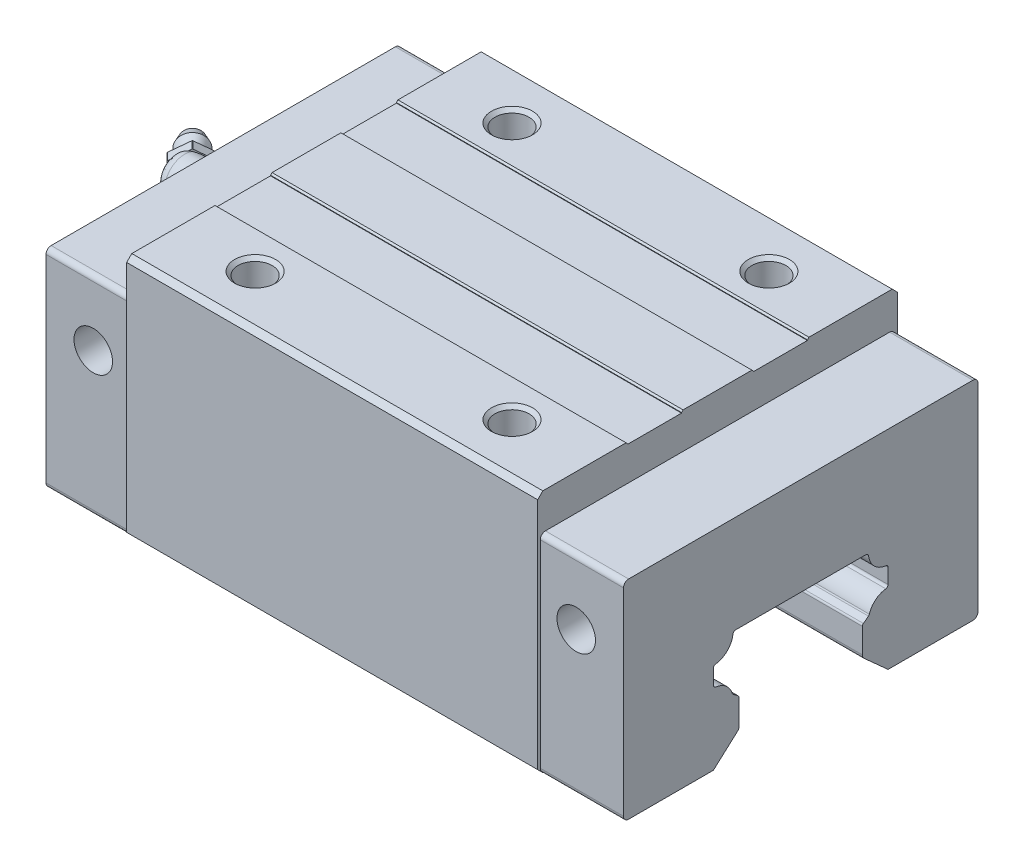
ISO-10303-21;
HEADER;
FILE_DESCRIPTION(('STEP AP214'),'2;1');
FILE_NAME('part.step','',(''),(''),'','','');
FILE_SCHEMA(('AUTOMOTIVE_DESIGN { 1 0 10303 214 1 1 1 1 }'));
ENDSEC;
DATA;
#1=APPLICATION_CONTEXT('core data for automotive mechanical design processes');
#2=APPLICATION_PROTOCOL_DEFINITION('international standard','automotive_design',2000,#1);
#3=PRODUCT_CONTEXT('',#1,'mechanical');
#4=PRODUCT('Part','Part','',(#3));
#5=PRODUCT_RELATED_PRODUCT_CATEGORY('part','',(#4));
#6=PRODUCT_DEFINITION_FORMATION('','',#4);
#7=PRODUCT_DEFINITION_CONTEXT('part definition',#1,'design');
#8=PRODUCT_DEFINITION('design','',#6,#7);
#9=PRODUCT_DEFINITION_SHAPE('','',#8);
#10=(LENGTH_UNIT() NAMED_UNIT(*) SI_UNIT(.MILLI.,.METRE.));
#11=(NAMED_UNIT(*) PLANE_ANGLE_UNIT() SI_UNIT($,.RADIAN.));
#12=(NAMED_UNIT(*) SI_UNIT($,.STERADIAN.) SOLID_ANGLE_UNIT());
#13=UNCERTAINTY_MEASURE_WITH_UNIT(LENGTH_MEASURE(1.E-05),#10,'distance_accuracy_value','');
#14=(GEOMETRIC_REPRESENTATION_CONTEXT(3) GLOBAL_UNCERTAINTY_ASSIGNED_CONTEXT((#13)) GLOBAL_UNIT_ASSIGNED_CONTEXT((#10,
#11,#12)) REPRESENTATION_CONTEXT('',''));
#15=CARTESIAN_POINT('',(0.,0.,0.));
#16=DIRECTION('',(0.,0.,1.));
#17=DIRECTION('',(1.,0.,0.));
#18=AXIS2_PLACEMENT_3D('',#15,#16,#17);
#19=CARTESIAN_POINT('',(-4.67157287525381,31.5,-4.32842712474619));
#20=DIRECTION('',(-0.707106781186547,0.,-0.707106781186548));
#21=DIRECTION('',(-0.707106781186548,0.,0.707106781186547));
#22=AXIS2_PLACEMENT_3D('',#19,#20,#21);
#23=PLANE('',#22);
#24=DIRECTION('',(0.,1.,0.));
#25=VECTOR('',#24,1.);
#26=CARTESIAN_POINT('',(-9.97487373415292,31.5,0.974873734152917));
#27=LINE('',#26,#25);
#28=CARTESIAN_POINT('',(-9.97487373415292,29.5635083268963,0.97487373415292));
#29=VERTEX_POINT('',#28);
#30=CARTESIAN_POINT('',(-9.97487373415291,33.4364916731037,0.974873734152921));
#31=VERTEX_POINT('',#30);
#32=EDGE_CURVE('E42',#29,#31,#27,.T.);
#33=ORIENTED_EDGE('',*,*,#32,.F.);
#34=CARTESIAN_POINT('',(-7.5,31.5,-1.5));
#35=DIRECTION('',(0.707106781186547,0.,0.707106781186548));
#36=DIRECTION('',(0.707106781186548,0.,-0.707106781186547));
#37=AXIS2_PLACEMENT_3D('',#34,#35,#36);
#38=CIRCLE('',#37,4.);
#39=CARTESIAN_POINT('',(-9.9232909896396,29.4371569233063,0.923290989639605));
#40=VERTEX_POINT('',#39);
#41=EDGE_CURVE('E10',#29,#40,#38,.T.);
#42=ORIENTED_EDGE('',*,*,#41,.T.);
#43=DIRECTION('',(-0.612372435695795,0.5,0.612372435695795));
#44=VECTOR('',#43,1.);
#45=CARTESIAN_POINT('',(-6.61611652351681,26.7368602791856,-2.38388347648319));
#46=LINE('',#45,#44);
#47=CARTESIAN_POINT('',(-9.40102717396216,29.0107303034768,0.401027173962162));
#48=VERTEX_POINT('',#47);
#49=EDGE_CURVE('E1203',#48,#40,#46,.T.);
#50=ORIENTED_EDGE('',*,*,#49,.F.);
#51=CARTESIAN_POINT('',(-9.5,29.6669697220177,0.500000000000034));
#52=CARTESIAN_POINT('',(-9.50000017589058,29.643194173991,0.499999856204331));
#53=CARTESIAN_POINT('',(-9.4996054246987,29.6194197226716,0.499602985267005));
#54=CARTESIAN_POINT('',(-9.49800430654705,29.5707587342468,0.497996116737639));
#55=CARTESIAN_POINT('',(-9.49675914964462,29.5458747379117,0.496747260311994));
#56=CARTESIAN_POINT('',(-9.49335644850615,29.4950153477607,0.493338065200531));
#57=CARTESIAN_POINT('',(-9.49115761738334,29.4690454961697,0.491136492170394));
#58=CARTESIAN_POINT('',(-9.48574211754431,29.4160482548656,0.485717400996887));
#59=CARTESIAN_POINT('',(-9.48248173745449,29.3890297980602,0.482456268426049));
#60=CARTESIAN_POINT('',(-9.47483342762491,29.3339855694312,0.474808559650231));
#61=CARTESIAN_POINT('',(-9.47039946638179,29.3059725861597,0.470376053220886));
#62=CARTESIAN_POINT('',(-9.46029113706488,29.249007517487,0.460272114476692));
#63=CARTESIAN_POINT('',(-9.45456858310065,29.2200725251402,0.454552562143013));
#64=CARTESIAN_POINT('',(-9.44176830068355,29.1613523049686,0.441758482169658));
#65=CARTESIAN_POINT('',(-9.43464045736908,29.1315889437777,0.434633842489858));
#66=CARTESIAN_POINT('',(-9.41891469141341,29.0713213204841,0.418913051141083));
#67=CARTESIAN_POINT('',(-9.41026502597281,29.0408440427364,0.410265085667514));
#68=CARTESIAN_POINT('',(-9.40102717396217,29.0107303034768,0.401027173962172));
#69=B_SPLINE_CURVE_WITH_KNOTS('',3,(#51,#52,#53,#54,#55,#56,#57,#58,#59,#60,#61,#62,#63,#64,#65,
#66,#67,#68),.UNSPECIFIED.,.F.,.F.,(4,2,2,2,2,2,2,2,4),(0.,0.0713186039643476,0.146128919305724,
0.224564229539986,0.306756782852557,0.392836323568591,0.482928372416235,0.577152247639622,
0.675618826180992),.UNSPECIFIED.);
#70=CARTESIAN_POINT('',(-9.5,29.6669697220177,0.5));
#71=VERTEX_POINT('',#70);
#72=EDGE_CURVE('E1822',#71,#48,#69,.T.);
#73=ORIENTED_EDGE('',*,*,#72,.F.);
#74=DIRECTION('',(0.,1.,0.));
#75=VECTOR('',#74,1.);
#76=CARTESIAN_POINT('',(-9.5,31.5,0.5));
#77=LINE('',#76,#75);
#78=CARTESIAN_POINT('',(-9.5,33.3330302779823,0.5));
#79=VERTEX_POINT('',#78);
#80=EDGE_CURVE('E29',#71,#79,#77,.T.);
#81=ORIENTED_EDGE('',*,*,#80,.T.);
#82=CARTESIAN_POINT('',(-9.40102717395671,33.989269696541,0.4010271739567));
#83=CARTESIAN_POINT('',(-9.41026502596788,33.9591559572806,0.41026508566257));
#84=CARTESIAN_POINT('',(-9.41891469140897,33.9286786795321,0.418913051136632));
#85=CARTESIAN_POINT('',(-9.43464045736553,33.8684110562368,0.434633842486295));
#86=CARTESIAN_POINT('',(-9.44176830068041,33.838647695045,0.441758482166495));
#87=CARTESIAN_POINT('',(-9.45456858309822,33.7799274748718,0.454552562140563));
#88=CARTESIAN_POINT('',(-9.46029113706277,33.7509924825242,0.460272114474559));
#89=CARTESIAN_POINT('',(-9.47039946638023,33.6940274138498,0.470376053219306));
#90=CARTESIAN_POINT('',(-9.47483342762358,33.6660144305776,0.474808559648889));
#91=CARTESIAN_POINT('',(-9.48248173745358,33.6109702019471,0.482456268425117));
#92=CARTESIAN_POINT('',(-9.48574211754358,33.5839517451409,0.485717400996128));
#93=CARTESIAN_POINT('',(-9.4911576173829,33.5309545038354,0.49113649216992));
#94=CARTESIAN_POINT('',(-9.49335644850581,33.5049846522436,0.493338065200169));
#95=CARTESIAN_POINT('',(-9.49675914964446,33.4541252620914,0.496747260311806));
#96=CARTESIAN_POINT('',(-9.49800430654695,33.4292412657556,0.497996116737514));
#97=CARTESIAN_POINT('',(-9.49960542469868,33.3805802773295,0.49960298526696));
#98=CARTESIAN_POINT('',(-9.50000017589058,33.3568058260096,0.499999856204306));
#99=CARTESIAN_POINT('',(-9.5,33.3330302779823,0.500000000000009));
#100=B_SPLINE_CURVE_WITH_KNOTS('',3,(#82,#83,#84,#85,#86,#87,#88,#89,#90,#91,#92,#93,#94,#95,
#96,#97,#98,#99),.UNSPECIFIED.,.F.,.F.,(4,2,2,2,2,2,2,2,4),(0.,0.0984665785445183,
0.192690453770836,0.282782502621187,0.368862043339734,0.451054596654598,0.529489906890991,
0.604300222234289,0.675618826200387),.UNSPECIFIED.);
#101=CARTESIAN_POINT('',(-9.4010271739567,33.989269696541,0.401027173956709));
#102=VERTEX_POINT('',#101);
#103=EDGE_CURVE('E1829',#102,#79,#100,.T.);
#104=ORIENTED_EDGE('',*,*,#103,.F.);
#105=DIRECTION('',(0.612372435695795,0.5,-0.612372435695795));
#106=VECTOR('',#105,1.);
#107=CARTESIAN_POINT('',(-6.61611652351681,36.2631397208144,-2.38388347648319));
#108=LINE('',#107,#106);
#109=CARTESIAN_POINT('',(-9.9232909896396,33.5628430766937,0.923290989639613));
#110=VERTEX_POINT('',#109);
#111=EDGE_CURVE('E2341',#110,#102,#108,.T.);
#112=ORIENTED_EDGE('',*,*,#111,.F.);
#113=CARTESIAN_POINT('',(-7.5,31.5,-1.5));
#114=DIRECTION('',(0.707106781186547,0.,0.707106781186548));
#115=DIRECTION('',(0.707106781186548,0.,-0.707106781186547));
#116=AXIS2_PLACEMENT_3D('',#113,#114,#115);
#117=CIRCLE('',#116,4.);
#118=EDGE_CURVE('E1843',#110,#31,#117,.T.);
#119=ORIENTED_EDGE('',*,*,#118,.T.);
#120=EDGE_LOOP('',(#33,#42,#50,#73,#81,#104,#112,#119));
#121=FACE_BOUND('',#120,.T.);
#122=ADVANCED_FACE('F16',(#121),#23,.F.);
#123=CARTESIAN_POINT('',(34.5728534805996,31.5,40.5728534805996));
#124=DIRECTION('',(-0.707106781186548,0.,-0.707106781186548));
#125=DIRECTION('',(0.707106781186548,0.,-0.707106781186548));
#126=AXIS2_PLACEMENT_3D('',#123,#124,#125);
#127=CYLINDRICAL_SURFACE('',#126,4.);
#128=DIRECTION('',(0.707106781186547,0.,0.707106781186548));
#129=VECTOR('',#128,1.);
#130=CARTESIAN_POINT('',(32.0979797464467,29.5635083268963,43.0477272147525));
#131=LINE('',#130,#129);
#132=CARTESIAN_POINT('',(-11.389087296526,29.5635083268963,-0.439339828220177));
#133=VERTEX_POINT('',#132);
#134=EDGE_CURVE('E1314',#133,#29,#131,.T.);
#135=ORIENTED_EDGE('',*,*,#134,.F.);
#136=CARTESIAN_POINT('',(-8.9142135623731,31.5,-2.91421356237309));
#137=DIRECTION('',(0.707106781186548,0.,0.707106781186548));
#138=DIRECTION('',(0.707106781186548,0.,-0.707106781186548));
#139=AXIS2_PLACEMENT_3D('',#136,#137,#138);
#140=CIRCLE('',#139,4.);
#141=CARTESIAN_POINT('',(-11.3375045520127,29.4371569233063,-0.490922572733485));
#142=VERTEX_POINT('',#141);
#143=EDGE_CURVE('E1368',#133,#142,#140,.T.);
#144=ORIENTED_EDGE('',*,*,#143,.T.);
#145=DIRECTION('',(-0.707106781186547,0.,-0.707106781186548));
#146=VECTOR('',#145,1.);
#147=CARTESIAN_POINT('',(32.14956249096,29.4371569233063,42.9961444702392));
#148=LINE('',#147,#146);
#149=EDGE_CURVE('E1200',#40,#142,#148,.T.);
#150=ORIENTED_EDGE('',*,*,#149,.F.);
#151=ORIENTED_EDGE('',*,*,#41,.F.);
#152=EDGE_LOOP('',(#135,#144,#150,#151));
#153=FACE_BOUND('',#152,.T.);
#154=ADVANCED_FACE('F1661',(#153),#127,.T.);
#155=CARTESIAN_POINT('',(-7.00502525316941,31.5,-4.82340187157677));
#156=DIRECTION('',(0.707106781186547,0.,0.707106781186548));
#157=DIRECTION('',(0.,-1.,0.));
#158=AXIS2_PLACEMENT_3D('',#155,#156,#157);
#159=PLANE('',#158);
#160=DIRECTION('',(0.,-1.,0.));
#161=VECTOR('',#160,1.);
#162=CARTESIAN_POINT('',(-6.43933982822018,33.5207259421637,-5.38908729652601));
#163=LINE('',#162,#161);
#164=CARTESIAN_POINT('',(-6.43933982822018,33.4364916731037,-5.38908729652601));
#165=VERTEX_POINT('',#164);
#166=CARTESIAN_POINT('',(-6.43933982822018,29.5635083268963,-5.38908729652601));
#167=VERTEX_POINT('',#166);
#168=EDGE_CURVE('E1277',#165,#167,#163,.T.);
#169=ORIENTED_EDGE('',*,*,#168,.T.);
#170=CARTESIAN_POINT('',(-8.9142135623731,31.5,-2.91421356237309));
#171=DIRECTION('',(0.707106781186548,0.,0.707106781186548));
#172=DIRECTION('',(0.707106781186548,0.,-0.707106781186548));
#173=AXIS2_PLACEMENT_3D('',#170,#171,#172);
#174=CIRCLE('',#173,4.);
#175=CARTESIAN_POINT('',(-6.49092257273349,29.4371569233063,-5.3375045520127));
#176=VERTEX_POINT('',#175);
#177=EDGE_CURVE('E2086',#176,#167,#174,.T.);
#178=ORIENTED_EDGE('',*,*,#177,.F.);
#179=DIRECTION('',(-0.612372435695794,-0.5,0.612372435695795));
#180=VECTOR('',#179,1.);
#181=CARTESIAN_POINT('',(-6.43933982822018,29.4792740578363,-5.38908729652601));
#182=LINE('',#181,#180);
#183=CARTESIAN_POINT('',(-8.86263081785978,27.5006652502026,-2.9657963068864));
#184=VERTEX_POINT('',#183);
#185=EDGE_CURVE('E1273',#176,#184,#182,.T.);
#186=ORIENTED_EDGE('',*,*,#185,.T.);
#187=CARTESIAN_POINT('',(-8.9142135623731,31.5,-2.91421356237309));
#188=DIRECTION('',(0.707106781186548,0.,0.707106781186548));
#189=DIRECTION('',(0.707106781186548,0.,-0.707106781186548));
#190=AXIS2_PLACEMENT_3D('',#187,#188,#189);
#191=CIRCLE('',#190,4.);
#192=CARTESIAN_POINT('',(-8.96579630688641,27.5006652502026,-2.86263081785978));
#193=VERTEX_POINT('',#192);
#194=EDGE_CURVE('E1249',#193,#184,#191,.T.);
#195=ORIENTED_EDGE('',*,*,#194,.F.);
#196=DIRECTION('',(-0.612372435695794,0.5,0.612372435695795));
#197=VECTOR('',#196,1.);
#198=CARTESIAN_POINT('',(-8.91421356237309,27.4585481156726,-2.91421356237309));
#199=LINE('',#198,#197);
#200=EDGE_CURVE('E1254',#193,#142,#199,.T.);
#201=ORIENTED_EDGE('',*,*,#200,.T.);
#202=ORIENTED_EDGE('',*,*,#143,.F.);
#203=DIRECTION('',(0.,1.,0.));
#204=VECTOR('',#203,1.);
#205=CARTESIAN_POINT('',(-11.389087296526,29.4792740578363,-0.439339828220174));
#206=LINE('',#205,#204);
#207=CARTESIAN_POINT('',(-11.389087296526,33.4364916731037,-0.439339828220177));
#208=VERTEX_POINT('',#207);
#209=EDGE_CURVE('E1250',#133,#208,#206,.T.);
#210=ORIENTED_EDGE('',*,*,#209,.T.);
#211=CARTESIAN_POINT('',(-8.9142135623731,31.5,-2.91421356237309));
#212=DIRECTION('',(0.707106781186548,0.,0.707106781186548));
#213=DIRECTION('',(0.707106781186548,0.,-0.707106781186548));
#214=AXIS2_PLACEMENT_3D('',#211,#212,#213);
#215=CIRCLE('',#214,4.);
#216=CARTESIAN_POINT('',(-11.3375045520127,33.5628430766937,-0.490922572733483));
#217=VERTEX_POINT('',#216);
#218=EDGE_CURVE('E1245',#217,#208,#215,.T.);
#219=ORIENTED_EDGE('',*,*,#218,.F.);
#220=DIRECTION('',(0.612372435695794,0.5,-0.612372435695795));
#221=VECTOR('',#220,1.);
#222=CARTESIAN_POINT('',(-11.389087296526,33.5207259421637,-0.439339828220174));
#223=LINE('',#222,#221);
#224=CARTESIAN_POINT('',(-8.9657963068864,35.4993347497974,-2.86263081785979));
#225=VERTEX_POINT('',#224);
#226=EDGE_CURVE('E1255',#217,#225,#223,.T.);
#227=ORIENTED_EDGE('',*,*,#226,.T.);
#228=CARTESIAN_POINT('',(-8.9142135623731,31.5,-2.91421356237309));
#229=DIRECTION('',(0.707106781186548,0.,0.707106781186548));
#230=DIRECTION('',(0.707106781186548,0.,-0.707106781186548));
#231=AXIS2_PLACEMENT_3D('',#228,#229,#230);
#232=CIRCLE('',#231,4.);
#233=CARTESIAN_POINT('',(-8.86263081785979,35.4993347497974,-2.9657963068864));
#234=VERTEX_POINT('',#233);
#235=EDGE_CURVE('E1430',#234,#225,#232,.T.);
#236=ORIENTED_EDGE('',*,*,#235,.F.);
#237=DIRECTION('',(0.612372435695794,-0.5,-0.612372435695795));
#238=VECTOR('',#237,1.);
#239=CARTESIAN_POINT('',(-8.91421356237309,35.5414518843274,-2.91421356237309));
#240=LINE('',#239,#238);
#241=CARTESIAN_POINT('',(-6.49092257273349,33.5628430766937,-5.3375045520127));
#242=VERTEX_POINT('',#241);
#243=EDGE_CURVE('E1896',#234,#242,#240,.T.);
#244=ORIENTED_EDGE('',*,*,#243,.T.);
#245=CARTESIAN_POINT('',(-8.9142135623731,31.5,-2.91421356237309));
#246=DIRECTION('',(0.707106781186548,0.,0.707106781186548));
#247=DIRECTION('',(0.707106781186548,0.,-0.707106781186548));
#248=AXIS2_PLACEMENT_3D('',#245,#246,#247);
#249=CIRCLE('',#248,4.);
#250=EDGE_CURVE('E806',#165,#242,#249,.T.);
#251=ORIENTED_EDGE('',*,*,#250,.F.);
#252=EDGE_LOOP('',(#169,#178,#186,#195,#201,#202,#210,#219,#227,#236,#244,#251));
#253=FACE_BOUND('',#252,.T.);
#254=CARTESIAN_POINT('',(-8.9142135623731,31.5,-2.91421356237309));
#255=DIRECTION('',(0.707106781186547,0.,0.707106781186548));
#256=DIRECTION('',(0.707106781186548,0.,-0.707106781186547));
#257=AXIS2_PLACEMENT_3D('',#254,#255,#256);
#258=CIRCLE('',#257,2.7);
#259=CARTESIAN_POINT('',(-7.00502525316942,31.5,-4.82340187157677));
#260=VERTEX_POINT('',#259);
#261=EDGE_CURVE('E2048',#260,#260,#258,.T.);
#262=ORIENTED_EDGE('',*,*,#261,.T.);
#263=EDGE_LOOP('',(#262));
#264=FACE_BOUND('',#263,.T.);
#265=ADVANCED_FACE('F1601',(#253,#264),#159,.F.);
#266=CARTESIAN_POINT('',(-9.83345237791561,31.5,-3.83345237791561));
#267=DIRECTION('',(0.707106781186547,0.,0.707106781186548));
#268=DIRECTION('',(0.707106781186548,0.,-0.707106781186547));
#269=AXIS2_PLACEMENT_3D('',#266,#267,#268);
#270=CONICAL_SURFACE('',#269,2.,0.4939413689);
#271=ORIENTED_EDGE('',*,*,#261,.F.);
#272=EDGE_LOOP('',(#271));
#273=FACE_BOUND('',#272,.T.);
#274=CARTESIAN_POINT('',(-9.83345237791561,31.5,-3.83345237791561));
#275=DIRECTION('',(0.707106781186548,0.,0.707106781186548));
#276=DIRECTION('',(0.707106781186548,0.,-0.707106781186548));
#277=AXIS2_PLACEMENT_3D('',#274,#275,#276);
#278=CIRCLE('',#277,2.);
#279=CARTESIAN_POINT('',(-8.41923881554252,31.5,-5.24766594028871));
#280=VERTEX_POINT('',#279);
#281=EDGE_CURVE('E1997',#280,#280,#278,.T.);
#282=ORIENTED_EDGE('',*,*,#281,.T.);
#283=EDGE_LOOP('',(#282));
#284=FACE_BOUND('',#283,.T.);
#285=ADVANCED_FACE('F1598',(#273,#284),#270,.T.);
#286=CARTESIAN_POINT('',(-11.601219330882,31.5,-5.60121933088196));
#287=DIRECTION('',(-0.707106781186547,0.,-0.707106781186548));
#288=DIRECTION('',(-0.707106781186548,0.,0.707106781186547));
#289=AXIS2_PLACEMENT_3D('',#286,#287,#288);
#290=CONICAL_SURFACE('',#289,2.7,0.2730087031);
#291=CARTESIAN_POINT('',(-11.601219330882,31.5,-5.60121933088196));
#292=DIRECTION('',(0.707106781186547,0.,0.707106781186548));
#293=DIRECTION('',(0.707106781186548,0.,-0.707106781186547));
#294=AXIS2_PLACEMENT_3D('',#291,#292,#293);
#295=CIRCLE('',#294,2.7);
#296=CARTESIAN_POINT('',(-9.69203102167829,31.5,-7.51040764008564));
#297=VERTEX_POINT('',#296);
#298=EDGE_CURVE('E1965',#297,#297,#295,.T.);
#299=ORIENTED_EDGE('',*,*,#298,.T.);
#300=EDGE_LOOP('',(#299));
#301=FACE_BOUND('',#300,.T.);
#302=ORIENTED_EDGE('',*,*,#281,.F.);
#303=EDGE_LOOP('',(#302));
#304=FACE_BOUND('',#303,.T.);
#305=ADVANCED_FACE('F1555',(#301,#304),#290,.T.);
#306=CARTESIAN_POINT('',(-13.0154328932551,31.5,-7.01543289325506));
#307=DIRECTION('',(0.707106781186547,0.,0.707106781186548));
#308=DIRECTION('',(0.707106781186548,0.,-0.707106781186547));
#309=AXIS2_PLACEMENT_3D('',#306,#307,#308);
#310=CONICAL_SURFACE('',#309,2.,0.3366748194);
#311=ORIENTED_EDGE('',*,*,#298,.F.);
#312=EDGE_LOOP('',(#311));
#313=FACE_BOUND('',#312,.T.);
#314=CARTESIAN_POINT('',(-13.0154328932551,31.5,-7.01543289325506));
#315=DIRECTION('',(0.707106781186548,0.,0.707106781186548));
#316=DIRECTION('',(0.707106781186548,0.,-0.707106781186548));
#317=AXIS2_PLACEMENT_3D('',#314,#315,#316);
#318=CIRCLE('',#317,2.);
#319=CARTESIAN_POINT('',(-11.601219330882,31.5,-8.42964645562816));
#320=VERTEX_POINT('',#319);
#321=EDGE_CURVE('E1093',#320,#320,#318,.T.);
#322=ORIENTED_EDGE('',*,*,#321,.T.);
#323=EDGE_LOOP('',(#322));
#324=FACE_BOUND('',#323,.T.);
#325=ADVANCED_FACE('F1551',(#313,#324),#310,.T.);
#326=CARTESIAN_POINT('',(-13.0154328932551,31.5,-7.01543289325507));
#327=DIRECTION('',(0.707106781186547,0.,0.707106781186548));
#328=DIRECTION('',(0.,-1.,0.));
#329=AXIS2_PLACEMENT_3D('',#326,#327,#328);
#330=PLANE('',#329);
#331=ORIENTED_EDGE('',*,*,#321,.F.);
#332=EDGE_LOOP('',(#331));
#333=FACE_BOUND('',#332,.T.);
#334=ADVANCED_FACE('F1554',(#333),#330,.F.);
#335=CARTESIAN_POINT('',(-10.,33.7516660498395,3.9));
#336=DIRECTION('',(0.,0.,1.));
#337=DIRECTION('',(1.,0.,0.));
#338=AXIS2_PLACEMENT_3D('',#335,#336,#337);
#339=PLANE('',#338);
#340=DIRECTION('',(0.,-1.,0.));
#341=VECTOR('',#340,1.);
#342=CARTESIAN_POINT('',(-3.,31.5,3.9));
#343=LINE('',#342,#341);
#344=CARTESIAN_POINT('',(-3.,31.5,3.9));
#345=VERTEX_POINT('',#344);
#346=CARTESIAN_POINT('',(-3.,29.2550055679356,3.9));
#347=VERTEX_POINT('',#346);
#348=EDGE_CURVE('E1089',#345,#347,#343,.T.);
#349=ORIENTED_EDGE('',*,*,#348,.T.);
#350=DIRECTION('',(1.,0.,0.));
#351=VECTOR('',#350,1.);
#352=CARTESIAN_POINT('',(0.,29.2550055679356,3.9));
#353=LINE('',#352,#351);
#354=CARTESIAN_POINT('',(0.,29.2550055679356,3.9));
#355=VERTEX_POINT('',#354);
#356=EDGE_CURVE('E1028',#347,#355,#353,.T.);
#357=ORIENTED_EDGE('',*,*,#356,.T.);
#358=DIRECTION('',(0.,-1.,0.));
#359=VECTOR('',#358,1.);
#360=CARTESIAN_POINT('',(0.,33.7516660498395,3.9));
#361=LINE('',#360,#359);
#362=CARTESIAN_POINT('',(0.,33.7449944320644,3.9));
#363=VERTEX_POINT('',#362);
#364=EDGE_CURVE('E1079',#363,#355,#361,.T.);
#365=ORIENTED_EDGE('',*,*,#364,.F.);
#366=DIRECTION('',(-1.,0.,0.));
#367=VECTOR('',#366,1.);
#368=CARTESIAN_POINT('',(0.,33.7449944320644,3.9));
#369=LINE('',#368,#367);
#370=CARTESIAN_POINT('',(-3.,33.7449944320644,3.9));
#371=VERTEX_POINT('',#370);
#372=EDGE_CURVE('E1023',#363,#371,#369,.T.);
#373=ORIENTED_EDGE('',*,*,#372,.T.);
#374=DIRECTION('',(0.,-1.,0.));
#375=VECTOR('',#374,1.);
#376=CARTESIAN_POINT('',(-3.,31.5,3.9));
#377=LINE('',#376,#375);
#378=EDGE_CURVE('E1019',#371,#345,#377,.T.);
#379=ORIENTED_EDGE('',*,*,#378,.T.);
#380=EDGE_LOOP('',(#349,#357,#365,#373,#379));
#381=FACE_BOUND('',#380,.T.);
#382=ADVANCED_FACE('F1609',(#381),#339,.T.);
#383=CARTESIAN_POINT('',(-10.,36.0033320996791,0.));
#384=DIRECTION('',(0.,0.866025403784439,0.5));
#385=DIRECTION('',(1.,0.,0.));
#386=AXIS2_PLACEMENT_3D('',#383,#384,#385);
#387=PLANE('',#386);
#388=DIRECTION('',(0.,-0.5,0.866025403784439));
#389=VECTOR('',#388,1.);
#390=CARTESIAN_POINT('',(-3.,36.566248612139,-0.975));
#391=LINE('',#390,#389);
#392=CARTESIAN_POINT('',(-3.,34.8774990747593,1.95));
#393=VERTEX_POINT('',#392);
#394=CARTESIAN_POINT('',(-3.,33.7550018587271,3.89422220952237));
#395=VERTEX_POINT('',#394);
#396=EDGE_CURVE('E1024',#393,#395,#391,.T.);
#397=ORIENTED_EDGE('',*,*,#396,.T.);
#398=DIRECTION('',(1.,0.,0.));
#399=VECTOR('',#398,1.);
#400=CARTESIAN_POINT('',(0.,33.7550018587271,3.89422220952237));
#401=LINE('',#400,#399);
#402=CARTESIAN_POINT('',(0.,33.7550018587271,3.89422220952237));
#403=VERTEX_POINT('',#402);
#404=EDGE_CURVE('E1041',#395,#403,#401,.T.);
#405=ORIENTED_EDGE('',*,*,#404,.T.);
#406=DIRECTION('',(0.,-0.5,0.866025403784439));
#407=VECTOR('',#406,1.);
#408=CARTESIAN_POINT('',(0.,36.0033320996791,0.));
#409=LINE('',#408,#407);
#410=CARTESIAN_POINT('',(0.,35.9999962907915,0.00577779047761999));
#411=VERTEX_POINT('',#410);
#412=EDGE_CURVE('E2083',#411,#403,#409,.T.);
#413=ORIENTED_EDGE('',*,*,#412,.F.);
#414=DIRECTION('',(-1.,0.,0.));
#415=VECTOR('',#414,1.);
#416=CARTESIAN_POINT('',(0.,35.9999962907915,0.00577779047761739));
#417=LINE('',#416,#415);
#418=CARTESIAN_POINT('',(-3.,35.9999962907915,0.00577779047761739));
#419=VERTEX_POINT('',#418);
#420=EDGE_CURVE('E1045',#411,#419,#417,.T.);
#421=ORIENTED_EDGE('',*,*,#420,.T.);
#422=DIRECTION('',(0.,-0.5,0.866025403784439));
#423=VECTOR('',#422,1.);
#424=CARTESIAN_POINT('',(-3.,36.566248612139,-0.975));
#425=LINE('',#424,#423);
#426=EDGE_CURVE('E1991',#419,#393,#425,.T.);
#427=ORIENTED_EDGE('',*,*,#426,.T.);
#428=EDGE_LOOP('',(#397,#405,#413,#421,#427));
#429=FACE_BOUND('',#428,.T.);
#430=ADVANCED_FACE('F1612',(#429),#387,.T.);
#431=CARTESIAN_POINT('',(-10.,33.7516660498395,-3.9));
#432=DIRECTION('',(0.,0.866025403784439,-0.5));
#433=DIRECTION('',(-1.,0.,0.));
#434=AXIS2_PLACEMENT_3D('',#431,#432,#433);
#435=PLANE('',#434);
#436=DIRECTION('',(0.,0.5,0.866025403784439));
#437=VECTOR('',#436,1.);
#438=CARTESIAN_POINT('',(-3.,33.1887495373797,-4.875));
#439=LINE('',#438,#437);
#440=CARTESIAN_POINT('',(-3.,34.8774990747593,-1.95));
#441=VERTEX_POINT('',#440);
#442=CARTESIAN_POINT('',(-3.,35.9999962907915,-0.00577779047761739));
#443=VERTEX_POINT('',#442);
#444=EDGE_CURVE('E2125',#441,#443,#439,.T.);
#445=ORIENTED_EDGE('',*,*,#444,.T.);
#446=DIRECTION('',(1.,0.,0.));
#447=VECTOR('',#446,1.);
#448=CARTESIAN_POINT('',(0.,35.9999962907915,-0.00577779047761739));
#449=LINE('',#448,#447);
#450=CARTESIAN_POINT('',(0.,35.9999962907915,-0.00577779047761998));
#451=VERTEX_POINT('',#450);
#452=EDGE_CURVE('E1873',#443,#451,#449,.T.);
#453=ORIENTED_EDGE('',*,*,#452,.T.);
#454=DIRECTION('',(0.,0.5,0.866025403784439));
#455=VECTOR('',#454,1.);
#456=CARTESIAN_POINT('',(0.,33.7516660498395,-3.9));
#457=LINE('',#456,#455);
#458=CARTESIAN_POINT('',(0.,33.7550018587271,-3.89422220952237));
#459=VERTEX_POINT('',#458);
#460=EDGE_CURVE('E2103',#459,#451,#457,.T.);
#461=ORIENTED_EDGE('',*,*,#460,.F.);
#462=DIRECTION('',(-1.,0.,0.));
#463=VECTOR('',#462,1.);
#464=CARTESIAN_POINT('',(0.,33.7550018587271,-3.89422220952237));
#465=LINE('',#464,#463);
#466=CARTESIAN_POINT('',(-3.,33.7550018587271,-3.89422220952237));
#467=VERTEX_POINT('',#466);
#468=EDGE_CURVE('E1006',#459,#467,#465,.T.);
#469=ORIENTED_EDGE('',*,*,#468,.T.);
#470=DIRECTION('',(0.,0.5,0.866025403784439));
#471=VECTOR('',#470,1.);
#472=CARTESIAN_POINT('',(-3.,33.1887495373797,-4.875));
#473=LINE('',#472,#471);
#474=EDGE_CURVE('E1002',#467,#441,#473,.T.);
#475=ORIENTED_EDGE('',*,*,#474,.T.);
#476=EDGE_LOOP('',(#445,#453,#461,#469,#475));
#477=FACE_BOUND('',#476,.T.);
#478=ADVANCED_FACE('F2589',(#477),#435,.T.);
#479=CARTESIAN_POINT('',(-10.,29.2483339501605,-3.9));
#480=DIRECTION('',(0.,0.,-1.));
#481=DIRECTION('',(0.,-1.,0.));
#482=AXIS2_PLACEMENT_3D('',#479,#480,#481);
#483=PLANE('',#482);
#484=DIRECTION('',(0.,1.,0.));
#485=VECTOR('',#484,1.);
#486=CARTESIAN_POINT('',(-3.,31.5,-3.9));
#487=LINE('',#486,#485);
#488=CARTESIAN_POINT('',(-3.,31.5,-3.9));
#489=VERTEX_POINT('',#488);
#490=CARTESIAN_POINT('',(-3.,33.7449944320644,-3.9));
#491=VERTEX_POINT('',#490);
#492=EDGE_CURVE('E1007',#489,#491,#487,.T.);
#493=ORIENTED_EDGE('',*,*,#492,.T.);
#494=DIRECTION('',(1.,0.,0.));
#495=VECTOR('',#494,1.);
#496=CARTESIAN_POINT('',(0.,33.7449944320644,-3.9));
#497=LINE('',#496,#495);
#498=CARTESIAN_POINT('',(0.,33.7449944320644,-3.9));
#499=VERTEX_POINT('',#498);
#500=EDGE_CURVE('E1369',#491,#499,#497,.T.);
#501=ORIENTED_EDGE('',*,*,#500,.T.);
#502=DIRECTION('',(0.,1.,0.));
#503=VECTOR('',#502,1.);
#504=CARTESIAN_POINT('',(0.,29.2483339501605,-3.9));
#505=LINE('',#504,#503);
#506=CARTESIAN_POINT('',(0.,29.2550055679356,-3.9));
#507=VERTEX_POINT('',#506);
#508=EDGE_CURVE('E936',#507,#499,#505,.T.);
#509=ORIENTED_EDGE('',*,*,#508,.F.);
#510=DIRECTION('',(-1.,0.,0.));
#511=VECTOR('',#510,1.);
#512=CARTESIAN_POINT('',(0.,29.2550055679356,-3.9));
#513=LINE('',#512,#511);
#514=CARTESIAN_POINT('',(-3.,29.2550055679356,-3.9));
#515=VERTEX_POINT('',#514);
#516=EDGE_CURVE('E1373',#507,#515,#513,.T.);
#517=ORIENTED_EDGE('',*,*,#516,.T.);
#518=DIRECTION('',(0.,1.,0.));
#519=VECTOR('',#518,1.);
#520=CARTESIAN_POINT('',(-3.,31.5,-3.9));
#521=LINE('',#520,#519);
#522=EDGE_CURVE('E952',#515,#489,#521,.T.);
#523=ORIENTED_EDGE('',*,*,#522,.T.);
#524=EDGE_LOOP('',(#493,#501,#509,#517,#523));
#525=FACE_BOUND('',#524,.T.);
#526=ADVANCED_FACE('F1748',(#525),#483,.T.);
#527=CARTESIAN_POINT('',(-10.,26.9966679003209,0.));
#528=DIRECTION('',(0.,-0.866025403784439,-0.5));
#529=DIRECTION('',(0.,0.5,-0.866025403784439));
#530=AXIS2_PLACEMENT_3D('',#527,#528,#529);
#531=PLANE('',#530);
#532=DIRECTION('',(0.,0.5,-0.866025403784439));
#533=VECTOR('',#532,1.);
#534=CARTESIAN_POINT('',(-3.,29.8112504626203,-4.875));
#535=LINE('',#534,#533);
#536=CARTESIAN_POINT('',(-3.,28.1225009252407,-1.95));
#537=VERTEX_POINT('',#536);
#538=CARTESIAN_POINT('',(-3.,29.2449981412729,-3.89422220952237));
#539=VERTEX_POINT('',#538);
#540=EDGE_CURVE('E948',#537,#539,#535,.T.);
#541=ORIENTED_EDGE('',*,*,#540,.T.);
#542=DIRECTION('',(1.,0.,0.));
#543=VECTOR('',#542,1.);
#544=CARTESIAN_POINT('',(0.,29.2449981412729,-3.89422220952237));
#545=LINE('',#544,#543);
#546=CARTESIAN_POINT('',(0.,29.2449981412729,-3.89422220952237));
#547=VERTEX_POINT('',#546);
#548=EDGE_CURVE('E953',#539,#547,#545,.T.);
#549=ORIENTED_EDGE('',*,*,#548,.T.);
#550=DIRECTION('',(0.,0.5,-0.866025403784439));
#551=VECTOR('',#550,1.);
#552=CARTESIAN_POINT('',(0.,26.9966679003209,0.));
#553=LINE('',#552,#551);
#554=CARTESIAN_POINT('',(0.,27.0000037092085,-0.00577779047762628));
#555=VERTEX_POINT('',#554);
#556=EDGE_CURVE('E932',#555,#547,#553,.T.);
#557=ORIENTED_EDGE('',*,*,#556,.F.);
#558=DIRECTION('',(-1.,0.,0.));
#559=VECTOR('',#558,1.);
#560=CARTESIAN_POINT('',(0.,27.0000037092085,-0.00577779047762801));
#561=LINE('',#560,#559);
#562=CARTESIAN_POINT('',(-3.,27.0000037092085,-0.00577779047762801));
#563=VERTEX_POINT('',#562);
#564=EDGE_CURVE('E1900',#555,#563,#561,.T.);
#565=ORIENTED_EDGE('',*,*,#564,.T.);
#566=DIRECTION('',(0.,0.5,-0.866025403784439));
#567=VECTOR('',#566,1.);
#568=CARTESIAN_POINT('',(-3.,29.8112504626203,-4.875));
#569=LINE('',#568,#567);
#570=EDGE_CURVE('E1976',#563,#537,#569,.T.);
#571=ORIENTED_EDGE('',*,*,#570,.T.);
#572=EDGE_LOOP('',(#541,#549,#557,#565,#571));
#573=FACE_BOUND('',#572,.T.);
#574=ADVANCED_FACE('F1744',(#573),#531,.T.);
#575=CARTESIAN_POINT('',(-10.,29.2483339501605,3.9));
#576=DIRECTION('',(0.,-0.866025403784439,0.5));
#577=DIRECTION('',(-1.,0.,0.));
#578=AXIS2_PLACEMENT_3D('',#575,#576,#577);
#579=PLANE('',#578);
#580=DIRECTION('',(0.,-0.5,-0.866025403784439));
#581=VECTOR('',#580,1.);
#582=CARTESIAN_POINT('',(-3.,26.433751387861,-0.975));
#583=LINE('',#582,#581);
#584=CARTESIAN_POINT('',(-3.,28.1225009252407,1.95));
#585=VERTEX_POINT('',#584);
#586=CARTESIAN_POINT('',(-3.,27.0000037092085,0.00577779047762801));
#587=VERTEX_POINT('',#586);
#588=EDGE_CURVE('E1980',#585,#587,#583,.T.);
#589=ORIENTED_EDGE('',*,*,#588,.T.);
#590=DIRECTION('',(1.,0.,0.));
#591=VECTOR('',#590,1.);
#592=CARTESIAN_POINT('',(0.,27.0000037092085,0.00577779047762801));
#593=LINE('',#592,#591);
#594=CARTESIAN_POINT('',(0.,27.0000037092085,0.00577779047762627));
#595=VERTEX_POINT('',#594);
#596=EDGE_CURVE('E2153',#587,#595,#593,.T.);
#597=ORIENTED_EDGE('',*,*,#596,.T.);
#598=DIRECTION('',(0.,-0.5,-0.866025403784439));
#599=VECTOR('',#598,1.);
#600=CARTESIAN_POINT('',(0.,29.2483339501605,3.9));
#601=LINE('',#600,#599);
#602=CARTESIAN_POINT('',(0.,29.2449981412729,3.89422220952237));
#603=VERTEX_POINT('',#602);
#604=EDGE_CURVE('E935',#603,#595,#601,.T.);
#605=ORIENTED_EDGE('',*,*,#604,.F.);
#606=DIRECTION('',(-1.,0.,0.));
#607=VECTOR('',#606,1.);
#608=CARTESIAN_POINT('',(0.,29.2449981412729,3.89422220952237));
#609=LINE('',#608,#607);
#610=CARTESIAN_POINT('',(-3.,29.2449981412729,3.89422220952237));
#611=VERTEX_POINT('',#610);
#612=EDGE_CURVE('E2165',#603,#611,#609,.T.);
#613=ORIENTED_EDGE('',*,*,#612,.T.);
#614=DIRECTION('',(0.,-0.5,-0.866025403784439));
#615=VECTOR('',#614,1.);
#616=CARTESIAN_POINT('',(-3.,26.433751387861,-0.975));
#617=LINE('',#616,#615);
#618=EDGE_CURVE('E1290',#611,#585,#617,.T.);
#619=ORIENTED_EDGE('',*,*,#618,.T.);
#620=EDGE_LOOP('',(#589,#597,#605,#613,#619));
#621=FACE_BOUND('',#620,.T.);
#622=ADVANCED_FACE('F1747',(#621),#579,.T.);
#623=CARTESIAN_POINT('',(0.,31.5,0.));
#624=DIRECTION('',(-1.,0.,0.));
#625=DIRECTION('',(0.,0.,-1.));
#626=AXIS2_PLACEMENT_3D('',#623,#624,#625);
#627=CYLINDRICAL_SURFACE('',#626,4.5);
#628=ORIENTED_EDGE('',*,*,#356,.F.);
#629=CARTESIAN_POINT('',(-3.,31.5,0.));
#630=DIRECTION('',(1.,0.,0.));
#631=DIRECTION('',(0.,0.,-1.));
#632=AXIS2_PLACEMENT_3D('',#629,#630,#631);
#633=CIRCLE('',#632,4.5);
#634=EDGE_CURVE('E1222',#347,#611,#633,.T.);
#635=ORIENTED_EDGE('',*,*,#634,.T.);
#636=ORIENTED_EDGE('',*,*,#612,.F.);
#637=CARTESIAN_POINT('',(0.,31.5,0.));
#638=DIRECTION('',(-1.,0.,0.));
#639=DIRECTION('',(0.,0.,-1.));
#640=AXIS2_PLACEMENT_3D('',#637,#638,#639);
#641=CIRCLE('',#640,4.5);
#642=EDGE_CURVE('E1218',#603,#355,#641,.T.);
#643=ORIENTED_EDGE('',*,*,#642,.T.);
#644=EDGE_LOOP('',(#628,#635,#636,#643));
#645=FACE_BOUND('',#644,.T.);
#646=ADVANCED_FACE('F2475',(#645),#627,.T.);
#647=CARTESIAN_POINT('',(-3.,31.5,-3.9));
#648=DIRECTION('',(1.,0.,0.));
#649=DIRECTION('',(0.,1.,0.));
#650=AXIS2_PLACEMENT_3D('',#647,#648,#649);
#651=PLANE('',#650);
#652=ORIENTED_EDGE('',*,*,#378,.F.);
#653=CARTESIAN_POINT('',(-3.,31.5,0.));
#654=DIRECTION('',(1.,0.,0.));
#655=DIRECTION('',(0.,0.,-1.));
#656=AXIS2_PLACEMENT_3D('',#653,#654,#655);
#657=CIRCLE('',#656,4.5);
#658=EDGE_CURVE('E1945',#395,#371,#657,.T.);
#659=ORIENTED_EDGE('',*,*,#658,.F.);
#660=ORIENTED_EDGE('',*,*,#396,.F.);
#661=CARTESIAN_POINT('',(-3.,31.5,0.));
#662=DIRECTION('',(1.,0.,0.));
#663=DIRECTION('',(0.,0.,-1.));
#664=AXIS2_PLACEMENT_3D('',#661,#662,#663);
#665=CIRCLE('',#664,3.9);
#666=EDGE_CURVE('E1223',#393,#345,#665,.T.);
#667=ORIENTED_EDGE('',*,*,#666,.T.);
#668=EDGE_LOOP('',(#652,#659,#660,#667));
#669=FACE_BOUND('',#668,.T.);
#670=ADVANCED_FACE('F2477',(#669),#651,.F.);
#671=CARTESIAN_POINT('',(0.,31.5,0.));
#672=DIRECTION('',(-1.,0.,0.));
#673=DIRECTION('',(0.,0.,-1.));
#674=AXIS2_PLACEMENT_3D('',#671,#672,#673);
#675=CYLINDRICAL_SURFACE('',#674,3.9);
#676=CARTESIAN_POINT('',(-7.5,31.5,0.));
#677=DIRECTION('',(1.,0.,0.));
#678=DIRECTION('',(0.,0.,-1.));
#679=AXIS2_PLACEMENT_3D('',#676,#677,#678);
#680=CIRCLE('',#679,3.9);
#681=CARTESIAN_POINT('',(-7.5,35.1,-1.5));
#682=VERTEX_POINT('',#681);
#683=CARTESIAN_POINT('',(-7.5,27.9,-1.5));
#684=VERTEX_POINT('',#683);
#685=EDGE_CURVE('E1972',#682,#684,#680,.T.);
#686=ORIENTED_EDGE('',*,*,#685,.T.);
#687=CARTESIAN_POINT('',(-9.,31.5,0.));
#688=DIRECTION('',(-0.707106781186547,0.,-0.707106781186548));
#689=DIRECTION('',(0.707106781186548,0.,-0.707106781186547));
#690=AXIS2_PLACEMENT_3D('',#687,#688,#689);
#691=ELLIPSE('',#690,5.5154328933,3.9);
#692=EDGE_CURVE('E1817',#682,#684,#691,.T.);
#693=ORIENTED_EDGE('',*,*,#692,.F.);
#694=EDGE_LOOP('',(#686,#693));
#695=FACE_BOUND('',#694,.T.);
#696=CARTESIAN_POINT('',(-3.,31.5,0.));
#697=DIRECTION('',(1.,0.,0.));
#698=DIRECTION('',(0.,0.,-1.));
#699=AXIS2_PLACEMENT_3D('',#696,#697,#698);
#700=CIRCLE('',#699,3.9);
#701=EDGE_CURVE('E1391',#345,#585,#700,.T.);
#702=ORIENTED_EDGE('',*,*,#701,.F.);
#703=ORIENTED_EDGE('',*,*,#666,.F.);
#704=CARTESIAN_POINT('',(-3.,31.5,0.));
#705=DIRECTION('',(1.,0.,0.));
#706=DIRECTION('',(0.,0.,-1.));
#707=AXIS2_PLACEMENT_3D('',#704,#705,#706);
#708=CIRCLE('',#707,3.9);
#709=EDGE_CURVE('E931',#441,#393,#708,.T.);
#710=ORIENTED_EDGE('',*,*,#709,.F.);
#711=CARTESIAN_POINT('',(-3.,31.5,0.));
#712=DIRECTION('',(1.,0.,0.));
#713=DIRECTION('',(0.,0.,-1.));
#714=AXIS2_PLACEMENT_3D('',#711,#712,#713);
#715=CIRCLE('',#714,3.9);
#716=EDGE_CURVE('E930',#489,#441,#715,.T.);
#717=ORIENTED_EDGE('',*,*,#716,.F.);
#718=CARTESIAN_POINT('',(-3.,31.5,0.));
#719=DIRECTION('',(1.,0.,0.));
#720=DIRECTION('',(0.,0.,-1.));
#721=AXIS2_PLACEMENT_3D('',#718,#719,#720);
#722=CIRCLE('',#721,3.9);
#723=EDGE_CURVE('E927',#537,#489,#722,.T.);
#724=ORIENTED_EDGE('',*,*,#723,.F.);
#725=CARTESIAN_POINT('',(-3.,31.5,0.));
#726=DIRECTION('',(1.,0.,0.));
#727=DIRECTION('',(0.,0.,-1.));
#728=AXIS2_PLACEMENT_3D('',#725,#726,#727);
#729=CIRCLE('',#728,3.9);
#730=EDGE_CURVE('E1928',#585,#537,#729,.T.);
#731=ORIENTED_EDGE('',*,*,#730,.F.);
#732=EDGE_LOOP('',(#702,#703,#710,#717,#724,#731));
#733=FACE_BOUND('',#732,.T.);
#734=ADVANCED_FACE('F1473',(#695,#733),#675,.T.);
#735=CARTESIAN_POINT('',(-7.5,35.0636213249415,-1.58448826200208));
#736=CARTESIAN_POINT('',(-7.50000000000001,36.3352380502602,1.27546380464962));
#737=CARTESIAN_POINT('',(-7.50000000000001,34.6299097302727,3.89999999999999));
#738=CARTESIAN_POINT('',(-7.5,31.5,3.9));
#739=CARTESIAN_POINT('',(-7.50000000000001,28.3700902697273,3.90000000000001));
#740=CARTESIAN_POINT('',(-7.50000000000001,26.6647619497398,1.27546380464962));
#741=CARTESIAN_POINT('',(-7.5,27.9363786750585,-1.58448826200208));
#742=CARTESIAN_POINT('',(-8.67157287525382,35.0636213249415,-1.58448826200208));
#743=CARTESIAN_POINT('',(-8.67157287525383,36.3352380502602,1.27546380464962));
#744=CARTESIAN_POINT('',(-8.67157287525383,34.6299097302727,3.89999999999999));
#745=CARTESIAN_POINT('',(-8.67157287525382,31.5,3.9));
#746=CARTESIAN_POINT('',(-8.67157287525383,28.3700902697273,3.90000000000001));
#747=CARTESIAN_POINT('',(-8.67157287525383,26.6647619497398,1.27546380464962));
#748=CARTESIAN_POINT('',(-8.67157287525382,27.9363786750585,-1.58448826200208));
#749=CARTESIAN_POINT('',(-9.50000000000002,34.3066468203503,-1.2479156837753));
#750=CARTESIAN_POINT('',(-9.50000000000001,35.308150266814,1.00453333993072));
#751=CARTESIAN_POINT('',(-9.50000000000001,33.9650630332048,3.0715728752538));
#752=CARTESIAN_POINT('',(-9.50000000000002,31.5,3.07157287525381));
#753=CARTESIAN_POINT('',(-9.50000000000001,29.0349369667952,3.07157287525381));
#754=CARTESIAN_POINT('',(-9.50000000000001,27.691849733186,1.00453333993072));
#755=CARTESIAN_POINT('',(-9.50000000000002,28.6933531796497,-1.24791568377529));
#756=CARTESIAN_POINT('',(-9.5,33.2361232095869,-0.771930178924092));
#757=CARTESIAN_POINT('',(-9.5,33.8556287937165,0.621379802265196));
#758=CARTESIAN_POINT('',(-9.5,33.0248278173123,1.89999999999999));
#759=CARTESIAN_POINT('',(-9.5,31.5,1.9));
#760=CARTESIAN_POINT('',(-9.5,29.9751721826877,1.9));
#761=CARTESIAN_POINT('',(-9.5,29.1443712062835,0.621379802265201));
#762=CARTESIAN_POINT('',(-9.5,29.7638767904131,-0.771930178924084));
#763=(BOUNDED_SURFACE() B_SPLINE_SURFACE(3,3,((#735,#736,#737,#738,#739,#740,#741),(#742,#743,
#744,#745,#746,#747,#748),(#749,#750,#751,#752,#753,#754,#755),(#756,#757,#758,#759,#760,#761,
#762)),.UNSPECIFIED.,.F.,.F.,.F.) B_SPLINE_SURFACE_WITH_KNOTS((4,4),(4,3,4),(1.1524181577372,
5.13076714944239),(-1.5707963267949,-0.785398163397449,0.),
.UNSPECIFIED.) GEOMETRIC_REPRESENTATION_ITEM() RATIONAL_B_SPLINE_SURFACE(((1.,0.696566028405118,
0.696566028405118,1.,0.696566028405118,0.696566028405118,1.),(0.804737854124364,
0.560553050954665,0.560553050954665,0.804737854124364,0.560553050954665,0.560553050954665,
0.804737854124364),(0.804737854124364,0.560553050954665,0.560553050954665,0.804737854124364,
0.560553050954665,0.560553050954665,0.804737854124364),(1.,0.696566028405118,0.696566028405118,
1.,0.696566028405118,0.696566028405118,1.))) REPRESENTATION_ITEM('') SURFACE());
#764=CARTESIAN_POINT('',(-7.5,35.1,-1.50000000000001));
#765=CARTESIAN_POINT('',(-7.51620648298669,35.1067528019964,-1.48379351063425));
#766=CARTESIAN_POINT('',(-7.53247856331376,35.1131909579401,-1.4675212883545));
#767=CARTESIAN_POINT('',(-7.56536044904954,35.125510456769,-1.43463899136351));
#768=CARTESIAN_POINT('',(-7.58197186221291,35.1313832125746,-1.41802730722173));
#769=CARTESIAN_POINT('',(-7.61552409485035,35.1425360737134,-1.38447455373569));
#770=CARTESIAN_POINT('',(-7.63246637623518,35.1478073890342,-1.36753202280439));
#771=CARTESIAN_POINT('',(-7.6666701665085,35.1577210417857,-1.33332785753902));
#772=CARTESIAN_POINT('',(-7.68393297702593,35.1623544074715,-1.31606492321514));
#773=CARTESIAN_POINT('',(-7.71876580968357,35.1709553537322,-1.28123202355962));
#774=CARTESIAN_POINT('',(-7.73633696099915,35.1749138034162,-1.2636609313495));
#775=CARTESIAN_POINT('',(-7.77177246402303,35.1821278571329,-1.228225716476));
#776=CARTESIAN_POINT('',(-7.78963776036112,35.1853741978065,-1.21036065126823));
#777=CARTESIAN_POINT('',(-7.82564549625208,35.1911268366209,-1.17435346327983));
#778=CARTESIAN_POINT('',(-7.84378868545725,35.1936237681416,-1.15621059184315));
#779=CARTESIAN_POINT('',(-7.88033383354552,35.1978407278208,-1.11966595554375));
#780=CARTESIAN_POINT('',(-7.8987363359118,35.199551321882,-1.10126364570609));
#781=CARTESIAN_POINT('',(-7.91715350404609,35.2008474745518,-1.082846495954));
#782=B_SPLINE_CURVE_WITH_KNOTS('',3,(#764,#765,#766,#767,#768,#769,#770,#771,#772,#773,#774,
#775,#776,#777,#778,#779,#780,#781),.UNSPECIFIED.,.F.,.F.,(4,2,2,2,2,2,2,2,4),(0.,
0.071678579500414,0.144314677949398,0.21790410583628,0.292440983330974,0.367917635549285,
0.444324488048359,0.521649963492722,0.599880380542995),.UNSPECIFIED.);
#783=CARTESIAN_POINT('',(-7.91715350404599,35.2008474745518,-1.08284649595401));
#784=VERTEX_POINT('',#783);
#785=EDGE_CURVE('E1453',#682,#784,#782,.T.);
#786=CARTESIAN_POINT('',(-7.91715350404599,35.2008474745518,-1.08284649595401));
#787=CARTESIAN_POINT('',(-7.93547658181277,35.2021372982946,-1.06452337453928));
#788=CARTESIAN_POINT('',(-7.9538126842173,35.2030176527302,-1.04618412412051));
#789=CARTESIAN_POINT('',(-7.99061051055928,35.2039554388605,-1.00937567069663));
#790=CARTESIAN_POINT('',(-8.00907228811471,35.204007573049,-0.990906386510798));
#791=CARTESIAN_POINT('',(-8.04609769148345,35.2032659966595,-0.953863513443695));
#792=CARTESIAN_POINT('',(-8.0646612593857,35.2024671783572,-0.935289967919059));
#793=CARTESIAN_POINT('',(-8.10186471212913,35.2000026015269,-0.898065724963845));
#794=CARTESIAN_POINT('',(-8.12050443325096,35.1983319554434,-0.87941518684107));
#795=CARTESIAN_POINT('',(-8.15783313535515,35.1941043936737,-0.842065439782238));
#796=CARTESIAN_POINT('',(-8.17652185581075,35.1915428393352,-0.82336649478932));
#797=CARTESIAN_POINT('',(-8.21391996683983,35.1855161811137,-0.785949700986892));
#798=CARTESIAN_POINT('',(-8.23262901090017,35.1820467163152,-0.767232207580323));
#799=CARTESIAN_POINT('',(-8.27003772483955,35.1741891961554,-0.729809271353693));
#800=CARTESIAN_POINT('',(-8.28873697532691,35.16979708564,-0.711104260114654));
#801=CARTESIAN_POINT('',(-8.32609467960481,35.1600816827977,-0.673738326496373));
#802=CARTESIAN_POINT('',(-8.34475265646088,35.1547546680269,-0.65507789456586));
#803=CARTESIAN_POINT('',(-8.38199511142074,35.1431595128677,-0.617834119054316));
#804=CARTESIAN_POINT('',(-8.40057907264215,35.1368880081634,-0.599251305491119));
#805=CARTESIAN_POINT('',(-8.43763962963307,35.1233967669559,-0.562196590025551));
#806=CARTESIAN_POINT('',(-8.45611568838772,35.1161740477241,-0.543725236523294));
#807=CARTESIAN_POINT('',(-8.49292554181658,35.10077628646,-0.506927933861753));
#808=CARTESIAN_POINT('',(-8.5112588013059,35.0925986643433,-0.488602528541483));
#809=CARTESIAN_POINT('',(-8.5477472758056,35.0752901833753,-0.45213212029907));
#810=CARTESIAN_POINT('',(-8.56590198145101,35.0661571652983,-0.433987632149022));
#811=CARTESIAN_POINT('',(-8.60199685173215,35.0469403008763,-0.397914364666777));
#812=CARTESIAN_POINT('',(-8.61993655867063,35.0368547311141,-0.379986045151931));
#813=CARTESIAN_POINT('',(-8.65556440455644,35.0157386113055,-0.344380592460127));
#814=CARTESIAN_POINT('',(-8.67325216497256,35.004706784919,-0.32670383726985));
#815=CARTESIAN_POINT('',(-8.70833874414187,34.9817075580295,-0.291636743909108));
#816=CARTESIAN_POINT('',(-8.72573729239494,34.969739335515,-0.274246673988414));
#817=CARTESIAN_POINT('',(-8.76020798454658,34.9448802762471,-0.239788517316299));
#818=CARTESIAN_POINT('',(-8.77727999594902,34.931989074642,-0.22272056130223));
#819=CARTESIAN_POINT('',(-8.81321044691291,34.9036020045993,-0.186788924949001));
#820=CARTESIAN_POINT('',(-8.83201987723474,34.8879834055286,-0.167973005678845));
#821=CARTESIAN_POINT('',(-8.86884154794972,34.8558696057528,-0.131129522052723));
#822=CARTESIAN_POINT('',(-8.8868617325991,34.8393924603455,-0.113094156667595));
#823=CARTESIAN_POINT('',(-8.92208398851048,34.8056403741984,-0.0778378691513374));
#824=CARTESIAN_POINT('',(-8.93929470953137,34.7883834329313,-0.0606083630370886));
#825=CARTESIAN_POINT('',(-8.97288114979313,34.7531519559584,-0.0269841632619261));
#826=CARTESIAN_POINT('',(-8.98926620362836,34.7351952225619,-0.010580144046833));
#827=CARTESIAN_POINT('',(-9.02118907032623,34.6986444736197,0.0213780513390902));
#828=CARTESIAN_POINT('',(-9.03673686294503,34.68006793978,0.0369422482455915));
#829=CARTESIAN_POINT('',(-9.06697732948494,34.6423574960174,0.0672110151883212));
#830=CARTESIAN_POINT('',(-9.08168058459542,34.6232406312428,0.0819262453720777));
#831=CARTESIAN_POINT('',(-9.11022835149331,34.5845283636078,0.110492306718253));
#832=CARTESIAN_POINT('',(-9.12408399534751,34.5649494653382,0.124354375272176));
#833=CARTESIAN_POINT('',(-9.15093696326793,34.5253903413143,0.151214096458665));
#834=CARTESIAN_POINT('',(-9.16394591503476,34.505425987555,0.164223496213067));
#835=CARTESIAN_POINT('',(-9.18910974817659,34.4651710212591,0.189382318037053));
#836=CARTESIAN_POINT('',(-9.20127669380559,34.4448955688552,0.201543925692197));
#837=CARTESIAN_POINT('',(-9.22476433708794,34.4040908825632,0.225015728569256));
#838=CARTESIAN_POINT('',(-9.23609747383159,34.3835760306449,0.236338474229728));
#839=CARTESIAN_POINT('',(-9.2579286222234,34.3423620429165,0.25814489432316));
#840=CARTESIAN_POINT('',(-9.26843938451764,34.3216764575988,0.268641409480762));
#841=CARTESIAN_POINT('',(-9.28863992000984,34.2801872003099,0.288811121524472));
#842=CARTESIAN_POINT('',(-9.29834269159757,34.259396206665,0.298497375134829));
#843=CARTESIAN_POINT('',(-9.31694409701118,34.2177587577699,0.317065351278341));
#844=CARTESIAN_POINT('',(-9.32585591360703,34.1969240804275,0.325960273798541));
#845=CARTESIAN_POINT('',(-9.34289467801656,34.1552581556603,0.342967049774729));
#846=CARTESIAN_POINT('',(-9.35103493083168,34.13443776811,0.351092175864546));
#847=CARTESIAN_POINT('',(-9.36655194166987,34.0928552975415,0.366583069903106));
#848=CARTESIAN_POINT('',(-9.37394206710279,34.0721031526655,0.373962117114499));
#849=CARTESIAN_POINT('',(-9.38798204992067,34.0307084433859,0.387986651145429));
#850=CARTESIAN_POINT('',(-9.39464527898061,34.0100748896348,0.394645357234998));
#851=CARTESIAN_POINT('',(-9.40102717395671,33.989269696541,0.4010271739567));
#852=B_SPLINE_CURVE_WITH_KNOTS('',3,(#786,#787,#788,#789,#790,#791,#792,#793,#794,#795,#796,
#797,#798,#799,#800,#801,#802,#803,#804,#805,#806,#807,#808,#809,#810,#811,#812,#813,#814,#815,
#816,#817,#818,#819,#820,#821,#822,#823,#824,#825,#826,#827,#828,#829,#830,#831,#832,#833,#834,
#835,#836,#837,#838,#839,#840,#841,#842,#843,#844,#845,#846,#847,#848,#849,#850,#851),
.UNSPECIFIED.,.F.,.F.,(4,2,2,2,2,2,2,2,2,2,2,2,2,2,2,2,2,2,2,2,2,2,2,2,2,2,2,2,2,2,2,2,4),(0.,
0.0778316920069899,0.156161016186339,0.234963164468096,0.31421190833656,0.393879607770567,
0.473937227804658,0.554354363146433,0.635099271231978,0.716138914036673,0.797439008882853,
0.878964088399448,0.960677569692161,1.04254183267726,1.12451830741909,1.20656757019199,
1.28864944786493,1.38117279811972,1.47221367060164,1.56172869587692,1.64967995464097,
1.73603491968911,1.82076635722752,1.90385219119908,1.9852753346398,2.06502349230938,
2.14308893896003,2.21946827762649,2.2941621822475,2.36717512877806,2.43851511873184,
2.50819339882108,2.57622418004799),.UNSPECIFIED.);
#853=EDGE_CURVE('E1836',#784,#102,#852,.T.);
#854=CARTESIAN_POINT('',(-9.5,31.5,0.));
#855=DIRECTION('',(1.,0.,0.));
#856=DIRECTION('',(0.,0.,-1.));
#857=AXIS2_PLACEMENT_3D('',#854,#855,#856);
#858=CIRCLE('',#857,1.9);
#859=EDGE_CURVE('E1826',#79,#71,#858,.T.);
#860=CARTESIAN_POINT('',(-9.40102717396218,29.0107303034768,0.40102717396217));
#861=CARTESIAN_POINT('',(-9.39463790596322,28.9899010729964,0.394637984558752));
#862=CARTESIAN_POINT('',(-9.38796665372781,28.969243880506,0.387971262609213));
#863=CARTESIAN_POINT('',(-9.37390896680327,28.9278015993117,0.373929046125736));
#864=CARTESIAN_POINT('',(-9.36650911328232,28.9070255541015,0.366540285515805));
#865=CARTESIAN_POINT('',(-9.35097090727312,28.8653951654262,0.351028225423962));
#866=CARTESIAN_POINT('',(-9.3428191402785,28.8445507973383,0.342891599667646));
#867=CARTESIAN_POINT('',(-9.32575553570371,28.8028369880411,0.32586000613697));
#868=CARTESIAN_POINT('',(-9.31683034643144,28.7819784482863,0.316951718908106));
#869=CARTESIAN_POINT('',(-9.29820032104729,28.740293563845,0.298355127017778));
#870=CARTESIAN_POINT('',(-9.28848225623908,28.7194790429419,0.288653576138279));
#871=CARTESIAN_POINT('',(-9.26824920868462,28.6779432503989,0.268451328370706));
#872=CARTESIAN_POINT('',(-9.25772118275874,28.6572347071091,0.257937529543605));
#873=CARTESIAN_POINT('',(-9.23585354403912,28.6159755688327,0.236094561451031));
#874=CARTESIAN_POINT('',(-9.22450113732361,28.5954385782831,0.224752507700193));
#875=CARTESIAN_POINT('',(-9.2009729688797,28.5545906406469,0.201240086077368));
#876=CARTESIAN_POINT('',(-9.18878472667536,28.5342941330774,0.189057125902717));
#877=CARTESIAN_POINT('',(-9.16357630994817,28.4939983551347,0.163853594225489));
#878=CARTESIAN_POINT('',(-9.15054403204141,28.474014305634,0.150820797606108));
#879=CARTESIAN_POINT('',(-9.12364243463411,28.4344173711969,0.123912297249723));
#880=CARTESIAN_POINT('',(-9.10976145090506,28.4148204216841,0.110024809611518));
#881=CARTESIAN_POINT('',(-9.08116106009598,28.3760739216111,0.0814059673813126));
#882=CARTESIAN_POINT('',(-9.06643048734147,28.3569409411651,0.0666633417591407));
#883=CARTESIAN_POINT('',(-9.03613349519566,28.31920042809,0.0363379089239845));
#884=CARTESIAN_POINT('',(-9.0205564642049,28.300610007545,0.0207444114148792));
#885=CARTESIAN_POINT('',(-8.9885733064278,28.2640339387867,-0.0112741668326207));
#886=CARTESIAN_POINT('',(-8.97215717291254,28.2460658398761,-0.0277092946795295));
#887=CARTESIAN_POINT('',(-8.9385068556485,28.2108143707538,-0.0613973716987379));
#888=CARTESIAN_POINT('',(-8.92126331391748,28.1935488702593,-0.0786596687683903));
#889=CARTESIAN_POINT('',(-8.88597382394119,28.1597826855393,-0.113983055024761));
#890=CARTESIAN_POINT('',(-8.86791920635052,28.143300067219,-0.132052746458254));
#891=CARTESIAN_POINT('',(-8.83102720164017,28.111178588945,-0.168966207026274));
#892=CARTESIAN_POINT('',(-8.81218185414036,28.0955578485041,-0.187817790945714));
#893=CARTESIAN_POINT('',(-8.77623042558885,28.0672075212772,-0.223769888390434));
#894=CARTESIAN_POINT('',(-8.75917442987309,28.0543522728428,-0.240821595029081));
#895=CARTESIAN_POINT('',(-8.72473731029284,28.0295628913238,-0.275245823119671));
#896=CARTESIAN_POINT('',(-8.70735631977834,28.0176283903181,-0.292618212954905));
#897=CARTESIAN_POINT('',(-8.67230623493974,27.9946942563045,-0.327648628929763));
#898=CARTESIAN_POINT('',(-8.6546374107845,27.983693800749,-0.345306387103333));
#899=CARTESIAN_POINT('',(-8.61904866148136,27.962637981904,-0.380872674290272));
#900=CARTESIAN_POINT('',(-8.6011291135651,27.9525813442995,-0.398780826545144));
#901=CARTESIAN_POINT('',(-8.56507562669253,27.9334198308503,-0.434812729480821));
#902=CARTESIAN_POINT('',(-8.54694214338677,27.9243132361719,-0.452936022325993));
#903=CARTESIAN_POINT('',(-8.51049702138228,27.9070550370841,-0.489363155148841));
#904=CARTESIAN_POINT('',(-8.492185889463,27.8989012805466,-0.507666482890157));
#905=CARTESIAN_POINT('',(-8.45542104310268,27.8835486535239,-0.544418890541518));
#906=CARTESIAN_POINT('',(-8.43696786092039,27.8763472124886,-0.562867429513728));
#907=CARTESIAN_POINT('',(-8.39995365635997,27.8628959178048,-0.599875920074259));
#908=CARTESIAN_POINT('',(-8.38139316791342,27.8566430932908,-0.61843532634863));
#909=CARTESIAN_POINT('',(-8.34419810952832,27.8450826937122,-0.655631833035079));
#910=CARTESIAN_POINT('',(-8.32556405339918,27.8397717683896,-0.67426840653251));
#911=CARTESIAN_POINT('',(-8.28825449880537,27.8300859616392,-0.711586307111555));
#912=CARTESIAN_POINT('',(-8.26957947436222,27.8257073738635,-0.730267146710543));
#913=CARTESIAN_POINT('',(-8.23221938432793,27.817874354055,-0.767641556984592));
#914=CARTESIAN_POINT('',(-8.2135347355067,27.8144158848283,-0.786334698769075));
#915=CARTESIAN_POINT('',(-8.17618545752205,27.8084087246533,-0.823702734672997));
#916=CARTESIAN_POINT('',(-8.1575211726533,27.8058556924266,-0.842377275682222));
#917=CARTESIAN_POINT('',(-8.1202412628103,27.8016427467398,-0.879678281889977));
#918=CARTESIAN_POINT('',(-8.1016258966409,27.7999782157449,-0.898304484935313));
#919=CARTESIAN_POINT('',(-8.06447096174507,27.7975235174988,-0.935480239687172));
#920=CARTESIAN_POINT('',(-8.04593155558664,27.7967284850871,-0.954029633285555));
#921=CARTESIAN_POINT('',(-8.00895417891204,27.7959922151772,-0.991024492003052));
#922=CARTESIAN_POINT('',(-7.99051626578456,27.7960458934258,-1.00946991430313));
#923=CARTESIAN_POINT('',(-7.95376577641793,27.7969845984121,-1.04623103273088));
#924=CARTESIAN_POINT('',(-7.93545314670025,27.7978643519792,-1.06454680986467));
#925=CARTESIAN_POINT('',(-7.91715350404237,27.7991525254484,-1.08284649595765));
#926=B_SPLINE_CURVE_WITH_KNOTS('',3,(#860,#861,#862,#863,#864,#865,#866,#867,#868,#869,#870,
#871,#872,#873,#874,#875,#876,#877,#878,#879,#880,#881,#882,#883,#884,#885,#886,#887,#888,#889,
#890,#891,#892,#893,#894,#895,#896,#897,#898,#899,#900,#901,#902,#903,#904,#905,#906,#907,#908,
#909,#910,#911,#912,#913,#914,#915,#916,#917,#918,#919,#920,#921,#922,#923,#924,#925),
.UNSPECIFIED.,.F.,.F.,(4,2,2,2,2,2,2,2,2,2,2,2,2,2,2,2,2,2,2,2,2,2,2,2,2,2,2,2,2,2,2,2,4),(0.,
0.0681093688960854,0.137870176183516,0.209296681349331,0.282400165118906,0.357188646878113,
0.433666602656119,0.511834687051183,0.591689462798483,0.673223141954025,0.75642334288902,
0.841272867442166,0.927749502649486,1.01582585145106,1.10546919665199,1.19664140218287,
1.28929885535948,1.3712696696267,1.45320755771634,1.53507252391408,1.61682531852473,
1.69842754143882,1.77984173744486,1.86103148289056,1.94196146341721,2.02259754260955,
2.10290682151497,2.18285768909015,2.26241986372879,2.34156442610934,2.42026384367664,
2.4984919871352,2.5762241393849),.UNSPECIFIED.);
#927=CARTESIAN_POINT('',(-7.91715350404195,27.7991525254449,-1.08284649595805));
#928=VERTEX_POINT('',#927);
#929=EDGE_CURVE('E1519',#48,#928,#926,.T.);
#930=CARTESIAN_POINT('',(-7.91715350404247,27.7991525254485,-1.08284649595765));
#931=CARTESIAN_POINT('',(-7.89873633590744,27.8004486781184,-1.10126364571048));
#932=CARTESIAN_POINT('',(-7.8803338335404,27.8021592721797,-1.11966595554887));
#933=CARTESIAN_POINT('',(-7.84378868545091,27.8063762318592,-1.15621059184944));
#934=CARTESIAN_POINT('',(-7.82564549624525,27.8088731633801,-1.17435346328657));
#935=CARTESIAN_POINT('',(-7.78963776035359,27.8146258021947,-1.21036065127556));
#936=CARTESIAN_POINT('',(-7.77177246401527,27.8178721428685,-1.2282257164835));
#937=CARTESIAN_POINT('',(-7.73633696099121,27.8250861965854,-1.26366093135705));
#938=CARTESIAN_POINT('',(-7.71876580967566,27.8290446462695,-1.28123202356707));
#939=CARTESIAN_POINT('',(-7.68393297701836,27.8376455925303,-1.31606492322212));
#940=CARTESIAN_POINT('',(-7.66667016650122,27.8422789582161,-1.33332785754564));
#941=CARTESIAN_POINT('',(-7.63246637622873,27.8521926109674,-1.36753202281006));
#942=CARTESIAN_POINT('',(-7.61552409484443,27.8574639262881,-1.38447455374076));
#943=CARTESIAN_POINT('',(-7.58197186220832,27.8686167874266,-1.41802730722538));
#944=CARTESIAN_POINT('',(-7.56536044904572,27.874489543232,-1.43463899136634));
#945=CARTESIAN_POINT('',(-7.53247856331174,27.8868090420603,-1.46752128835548));
#946=CARTESIAN_POINT('',(-7.51620648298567,27.8932471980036,-1.48379351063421));
#947=CARTESIAN_POINT('',(-7.5,27.8999999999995,-1.49999999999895));
#948=B_SPLINE_CURVE_WITH_KNOTS('',3,(#930,#931,#932,#933,#934,#935,#936,#937,#938,#939,#940,
#941,#942,#943,#944,#945,#946,#947),.UNSPECIFIED.,.F.,.F.,(4,2,2,2,2,2,2,2,4),(0.,
0.0782304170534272,0.155555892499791,0.231962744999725,0.307439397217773,0.381976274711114,
0.455565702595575,0.528201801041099,0.599880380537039),.UNSPECIFIED.);
#949=EDGE_CURVE('E1815',#928,#684,#948,.T.);
#950=ORIENTED_EDGE('',*,*,#685,.F.);
#951=ORIENTED_EDGE('',*,*,#785,.T.);
#952=ORIENTED_EDGE('',*,*,#853,.T.);
#953=ORIENTED_EDGE('',*,*,#103,.T.);
#954=ORIENTED_EDGE('',*,*,#859,.T.);
#955=ORIENTED_EDGE('',*,*,#72,.T.);
#956=ORIENTED_EDGE('',*,*,#929,.T.);
#957=ORIENTED_EDGE('',*,*,#949,.T.);
#958=EDGE_LOOP('',(#950,#951,#952,#953,#954,#955,#956,#957));
#959=FACE_BOUND('',#958,.T.);
#960=ADVANCED_FACE('F1460',(#959),#763,.T.);
#961=CARTESIAN_POINT('',(112.4,47.5,-34.));
#962=DIRECTION('',(0.,-1.,0.));
#963=DIRECTION('',(-1.,0.,0.));
#964=AXIS2_PLACEMENT_3D('',#961,#962,#963);
#965=PLANE('',#964);
#966=DIRECTION('',(-1.,0.,0.));
#967=VECTOR('',#966,1.);
#968=CARTESIAN_POINT('',(112.4,47.5,17.8));
#969=LINE('',#968,#967);
#970=CARTESIAN_POINT('',(96.2,47.5,17.8));
#971=VERTEX_POINT('',#970);
#972=CARTESIAN_POINT('',(16.2,47.5,17.8));
#973=VERTEX_POINT('',#972);
#974=EDGE_CURVE('E1142',#971,#973,#969,.T.);
#975=ORIENTED_EDGE('',*,*,#974,.T.);
#976=DIRECTION('',(0.,0.,1.));
#977=VECTOR('',#976,1.);
#978=CARTESIAN_POINT('',(16.2,47.5,-35.));
#979=LINE('',#978,#977);
#980=CARTESIAN_POINT('',(16.2,47.5,34.));
#981=VERTEX_POINT('',#980);
#982=EDGE_CURVE('E1138',#973,#981,#979,.T.);
#983=ORIENTED_EDGE('',*,*,#982,.T.);
#984=DIRECTION('',(-1.,0.,0.));
#985=VECTOR('',#984,1.);
#986=CARTESIAN_POINT('',(112.4,47.5,34.));
#987=LINE('',#986,#985);
#988=CARTESIAN_POINT('',(96.2,47.5,34.));
#989=VERTEX_POINT('',#988);
#990=EDGE_CURVE('E1132',#989,#981,#987,.T.);
#991=ORIENTED_EDGE('',*,*,#990,.F.);
#992=DIRECTION('',(0.,0.,1.));
#993=VECTOR('',#992,1.);
#994=CARTESIAN_POINT('',(96.2,47.5,-35.));
#995=LINE('',#994,#993);
#996=EDGE_CURVE('E2053',#971,#989,#995,.T.);
#997=ORIENTED_EDGE('',*,*,#996,.F.);
#998=EDGE_LOOP('',(#975,#983,#991,#997));
#999=FACE_BOUND('',#998,.T.);
#1000=CARTESIAN_POINT('',(81.2,47.5,25.));
#1001=DIRECTION('',(0.,-1.,0.));
#1002=DIRECTION('',(0.,0.,-1.));
#1003=AXIS2_PLACEMENT_3D('',#1000,#1001,#1002);
#1004=CIRCLE('',#1003,4.);
#1005=CARTESIAN_POINT('',(81.2,47.5,21.));
#1006=VERTEX_POINT('',#1005);
#1007=EDGE_CURVE('E1143',#1006,#1006,#1004,.T.);
#1008=ORIENTED_EDGE('',*,*,#1007,.T.);
#1009=EDGE_LOOP('',(#1008));
#1010=FACE_BOUND('',#1009,.T.);
#1011=CARTESIAN_POINT('',(31.2,47.5,25.));
#1012=DIRECTION('',(0.,-1.,0.));
#1013=DIRECTION('',(0.,0.,-1.));
#1014=AXIS2_PLACEMENT_3D('',#1011,#1012,#1013);
#1015=CIRCLE('',#1014,4.);
#1016=CARTESIAN_POINT('',(31.2,47.5,21.));
#1017=VERTEX_POINT('',#1016);
#1018=EDGE_CURVE('E2110',#1017,#1017,#1015,.T.);
#1019=ORIENTED_EDGE('',*,*,#1018,.T.);
#1020=EDGE_LOOP('',(#1019));
#1021=FACE_BOUND('',#1020,.T.);
#1022=ADVANCED_FACE('F1472',(#999,#1010,#1021),#965,.F.);
#1023=CARTESIAN_POINT('',(112.4,47.5,-34.));
#1024=DIRECTION('',(0.,-1.,0.));
#1025=DIRECTION('',(-1.,0.,0.));
#1026=AXIS2_PLACEMENT_3D('',#1023,#1024,#1025);
#1027=PLANE('',#1026);
#1028=DIRECTION('',(-1.,0.,0.));
#1029=VECTOR('',#1028,1.);
#1030=CARTESIAN_POINT('',(112.4,47.5,6.7));
#1031=LINE('',#1030,#1029);
#1032=CARTESIAN_POINT('',(96.2,47.5,6.7));
#1033=VERTEX_POINT('',#1032);
#1034=CARTESIAN_POINT('',(16.2,47.5,6.7));
#1035=VERTEX_POINT('',#1034);
#1036=EDGE_CURVE('E1228',#1033,#1035,#1031,.T.);
#1037=ORIENTED_EDGE('',*,*,#1036,.F.);
#1038=DIRECTION('',(0.,0.,1.));
#1039=VECTOR('',#1038,1.);
#1040=CARTESIAN_POINT('',(96.2,47.5,-35.));
#1041=LINE('',#1040,#1039);
#1042=CARTESIAN_POINT('',(96.2,47.5,-6.7));
#1043=VERTEX_POINT('',#1042);
#1044=EDGE_CURVE('E1216',#1043,#1033,#1041,.T.);
#1045=ORIENTED_EDGE('',*,*,#1044,.F.);
#1046=DIRECTION('',(-1.,0.,0.));
#1047=VECTOR('',#1046,1.);
#1048=CARTESIAN_POINT('',(112.4,47.5,-6.7));
#1049=LINE('',#1048,#1047);
#1050=CARTESIAN_POINT('',(16.2,47.5,-6.7));
#1051=VERTEX_POINT('',#1050);
#1052=EDGE_CURVE('E2193',#1043,#1051,#1049,.T.);
#1053=ORIENTED_EDGE('',*,*,#1052,.T.);
#1054=DIRECTION('',(0.,0.,1.));
#1055=VECTOR('',#1054,1.);
#1056=CARTESIAN_POINT('',(16.2,47.5,-35.));
#1057=LINE('',#1056,#1055);
#1058=EDGE_CURVE('E2132',#1051,#1035,#1057,.T.);
#1059=ORIENTED_EDGE('',*,*,#1058,.T.);
#1060=EDGE_LOOP('',(#1037,#1045,#1053,#1059));
#1061=FACE_BOUND('',#1060,.T.);
#1062=ADVANCED_FACE('F2462',(#1061),#1027,.F.);
#1063=CARTESIAN_POINT('',(112.4,47.5,-34.));
#1064=DIRECTION('',(0.,-1.,0.));
#1065=DIRECTION('',(-1.,0.,0.));
#1066=AXIS2_PLACEMENT_3D('',#1063,#1064,#1065);
#1067=PLANE('',#1066);
#1068=DIRECTION('',(-1.,0.,0.));
#1069=VECTOR('',#1068,1.);
#1070=CARTESIAN_POINT('',(112.4,47.5,-17.8));
#1071=LINE('',#1070,#1069);
#1072=CARTESIAN_POINT('',(96.2,47.5,-17.8));
#1073=VERTEX_POINT('',#1072);
#1074=CARTESIAN_POINT('',(16.2,47.5,-17.8));
#1075=VERTEX_POINT('',#1074);
#1076=EDGE_CURVE('E985',#1073,#1075,#1071,.T.);
#1077=ORIENTED_EDGE('',*,*,#1076,.F.);
#1078=DIRECTION('',(0.,0.,1.));
#1079=VECTOR('',#1078,1.);
#1080=CARTESIAN_POINT('',(96.2,47.5,-35.));
#1081=LINE('',#1080,#1079);
#1082=CARTESIAN_POINT('',(96.2,47.5,-34.));
#1083=VERTEX_POINT('',#1082);
#1084=EDGE_CURVE('E2054',#1083,#1073,#1081,.T.);
#1085=ORIENTED_EDGE('',*,*,#1084,.F.);
#1086=DIRECTION('',(-1.,0.,0.));
#1087=VECTOR('',#1086,1.);
#1088=CARTESIAN_POINT('',(112.4,47.5,-34.));
#1089=LINE('',#1088,#1087);
#1090=CARTESIAN_POINT('',(16.2,47.5,-34.));
#1091=VERTEX_POINT('',#1090);
#1092=EDGE_CURVE('E1414',#1083,#1091,#1089,.T.);
#1093=ORIENTED_EDGE('',*,*,#1092,.T.);
#1094=DIRECTION('',(0.,0.,1.));
#1095=VECTOR('',#1094,1.);
#1096=CARTESIAN_POINT('',(16.2,47.5,-35.));
#1097=LINE('',#1096,#1095);
#1098=EDGE_CURVE('E1410',#1091,#1075,#1097,.T.);
#1099=ORIENTED_EDGE('',*,*,#1098,.T.);
#1100=EDGE_LOOP('',(#1077,#1085,#1093,#1099));
#1101=FACE_BOUND('',#1100,.T.);
#1102=CARTESIAN_POINT('',(31.2,47.5,-25.));
#1103=DIRECTION('',(0.,-1.,0.));
#1104=DIRECTION('',(0.,0.,-1.));
#1105=AXIS2_PLACEMENT_3D('',#1102,#1103,#1104);
#1106=CIRCLE('',#1105,4.);
#1107=CARTESIAN_POINT('',(31.2,47.5,-29.));
#1108=VERTEX_POINT('',#1107);
#1109=EDGE_CURVE('E1415',#1108,#1108,#1106,.T.);
#1110=ORIENTED_EDGE('',*,*,#1109,.T.);
#1111=EDGE_LOOP('',(#1110));
#1112=FACE_BOUND('',#1111,.T.);
#1113=CARTESIAN_POINT('',(81.2,47.5,-25.));
#1114=DIRECTION('',(0.,-1.,0.));
#1115=DIRECTION('',(0.,0.,-1.));
#1116=AXIS2_PLACEMENT_3D('',#1113,#1114,#1115);
#1117=CIRCLE('',#1116,4.);
#1118=CARTESIAN_POINT('',(81.2,47.5,-29.));
#1119=VERTEX_POINT('',#1118);
#1120=EDGE_CURVE('E1272',#1119,#1119,#1117,.T.);
#1121=ORIENTED_EDGE('',*,*,#1120,.T.);
#1122=EDGE_LOOP('',(#1121));
#1123=FACE_BOUND('',#1122,.T.);
#1124=ADVANCED_FACE('F2391',(#1101,#1112,#1123),#1067,.F.);
#1125=CARTESIAN_POINT('',(112.4,47.5,34.));
#1126=DIRECTION('',(0.,-0.707106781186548,-0.707106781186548));
#1127=DIRECTION('',(0.,-0.707106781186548,0.707106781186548));
#1128=AXIS2_PLACEMENT_3D('',#1125,#1126,#1127);
#1129=PLANE('',#1128);
#1130=DIRECTION('',(0.,-0.707106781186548,0.707106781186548));
#1131=VECTOR('',#1130,1.);
#1132=CARTESIAN_POINT('',(96.2,47.5,34.));
#1133=LINE('',#1132,#1131);
#1134=CARTESIAN_POINT('',(96.2,46.5,35.));
#1135=VERTEX_POINT('',#1134);
#1136=EDGE_CURVE('E1326',#989,#1135,#1133,.T.);
#1137=ORIENTED_EDGE('',*,*,#1136,.F.);
#1138=ORIENTED_EDGE('',*,*,#990,.T.);
#1139=DIRECTION('',(0.,-0.707106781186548,0.707106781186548));
#1140=VECTOR('',#1139,1.);
#1141=CARTESIAN_POINT('',(16.2,47.5,34.));
#1142=LINE('',#1141,#1140);
#1143=CARTESIAN_POINT('',(16.2,46.5,35.));
#1144=VERTEX_POINT('',#1143);
#1145=EDGE_CURVE('E980',#981,#1144,#1142,.T.);
#1146=ORIENTED_EDGE('',*,*,#1145,.T.);
#1147=DIRECTION('',(-1.,0.,0.));
#1148=VECTOR('',#1147,1.);
#1149=CARTESIAN_POINT('',(112.4,46.5,35.));
#1150=LINE('',#1149,#1148);
#1151=EDGE_CURVE('E1235',#1135,#1144,#1150,.T.);
#1152=ORIENTED_EDGE('',*,*,#1151,.F.);
#1153=EDGE_LOOP('',(#1137,#1138,#1146,#1152));
#1154=FACE_BOUND('',#1153,.T.);
#1155=ADVANCED_FACE('F1686',(#1154),#1129,.F.);
#1156=CARTESIAN_POINT('',(0.,31.5,0.));
#1157=DIRECTION('',(-1.,0.,0.));
#1158=DIRECTION('',(0.,0.,-1.));
#1159=AXIS2_PLACEMENT_3D('',#1156,#1157,#1158);
#1160=CYLINDRICAL_SURFACE('',#1159,4.5);
#1161=ORIENTED_EDGE('',*,*,#564,.F.);
#1162=CARTESIAN_POINT('',(0.,31.5,0.));
#1163=DIRECTION('',(-1.,0.,0.));
#1164=DIRECTION('',(0.,0.,-1.));
#1165=AXIS2_PLACEMENT_3D('',#1162,#1163,#1164);
#1166=CIRCLE('',#1165,4.5);
#1167=EDGE_CURVE('E976',#555,#595,#1166,.T.);
#1168=ORIENTED_EDGE('',*,*,#1167,.T.);
#1169=ORIENTED_EDGE('',*,*,#596,.F.);
#1170=CARTESIAN_POINT('',(-3.,31.5,0.));
#1171=DIRECTION('',(1.,0.,0.));
#1172=DIRECTION('',(0.,0.,-1.));
#1173=AXIS2_PLACEMENT_3D('',#1170,#1171,#1172);
#1174=CIRCLE('',#1173,4.5);
#1175=EDGE_CURVE('E981',#587,#563,#1174,.T.);
#1176=ORIENTED_EDGE('',*,*,#1175,.T.);
#1177=EDGE_LOOP('',(#1161,#1168,#1169,#1176));
#1178=FACE_BOUND('',#1177,.T.);
#1179=ADVANCED_FACE('F1682',(#1178),#1160,.T.);
#1180=CARTESIAN_POINT('',(112.4,4.9453624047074,12.));
#1181=DIRECTION('',(0.,0.,1.));
#1182=DIRECTION('',(1.,0.,0.));
#1183=AXIS2_PLACEMENT_3D('',#1180,#1181,#1182);
#1184=PLANE('',#1183);
#1185=DIRECTION('',(0.,1.,0.));
#1186=VECTOR('',#1185,1.);
#1187=CARTESIAN_POINT('',(0.,4.9453624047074,12.));
#1188=LINE('',#1187,#1186);
#1189=CARTESIAN_POINT('',(0.,4.9453624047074,12.));
#1190=VERTEX_POINT('',#1189);
#1191=CARTESIAN_POINT('',(0.,9.75329806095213,12.));
#1192=VERTEX_POINT('',#1191);
#1193=EDGE_CURVE('E1331',#1190,#1192,#1188,.T.);
#1194=ORIENTED_EDGE('',*,*,#1193,.T.);
#1195=DIRECTION('',(-1.,0.,0.));
#1196=VECTOR('',#1195,1.);
#1197=CARTESIAN_POINT('',(112.4,9.75329806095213,12.));
#1198=LINE('',#1197,#1196);
#1199=CARTESIAN_POINT('',(112.4,9.75329806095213,12.));
#1200=VERTEX_POINT('',#1199);
#1201=EDGE_CURVE('E1877',#1200,#1192,#1198,.T.);
#1202=ORIENTED_EDGE('',*,*,#1201,.F.);
#1203=DIRECTION('',(0.,1.,0.));
#1204=VECTOR('',#1203,1.);
#1205=CARTESIAN_POINT('',(112.4,4.9453624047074,12.));
#1206=LINE('',#1205,#1204);
#1207=CARTESIAN_POINT('',(112.4,4.9453624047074,12.));
#1208=VERTEX_POINT('',#1207);
#1209=EDGE_CURVE('E2221',#1208,#1200,#1206,.T.);
#1210=ORIENTED_EDGE('',*,*,#1209,.F.);
#1211=DIRECTION('',(-1.,0.,0.));
#1212=VECTOR('',#1211,1.);
#1213=CARTESIAN_POINT('',(112.4,4.9453624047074,12.));
#1214=LINE('',#1213,#1212);
#1215=EDGE_CURVE('E1328',#1208,#1190,#1214,.T.);
#1216=ORIENTED_EDGE('',*,*,#1215,.T.);
#1217=EDGE_LOOP('',(#1194,#1202,#1210,#1216));
#1218=FACE_BOUND('',#1217,.T.);
#1219=ADVANCED_FACE('F1685',(#1218),#1184,.F.);
#1220=CARTESIAN_POINT('',(112.4,9.75329806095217,12.5));
#1221=DIRECTION('',(1.,0.,0.));
#1222=DIRECTION('',(0.,0.,1.));
#1223=AXIS2_PLACEMENT_3D('',#1220,#1221,#1222);
#1224=CYLINDRICAL_SURFACE('',#1223,0.5);
#1225=CARTESIAN_POINT('',(0.,9.75329806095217,12.5));
#1226=DIRECTION('',(1.,0.,0.));
#1227=DIRECTION('',(0.,0.,-1.));
#1228=AXIS2_PLACEMENT_3D('',#1225,#1226,#1227);
#1229=CIRCLE('',#1228,0.5);
#1230=CARTESIAN_POINT('',(0.,10.1501012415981,12.1957842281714));
#1231=VERTEX_POINT('',#1230);
#1232=EDGE_CURVE('E1332',#1192,#1231,#1229,.T.);
#1233=ORIENTED_EDGE('',*,*,#1232,.T.);
#1234=DIRECTION('',(-1.,0.,0.));
#1235=VECTOR('',#1234,1.);
#1236=CARTESIAN_POINT('',(112.4,10.1501012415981,12.1957842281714));
#1237=LINE('',#1236,#1235);
#1238=CARTESIAN_POINT('',(112.4,10.1501012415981,12.1957842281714));
#1239=VERTEX_POINT('',#1238);
#1240=EDGE_CURVE('E2100',#1239,#1231,#1237,.T.);
#1241=ORIENTED_EDGE('',*,*,#1240,.F.);
#1242=CARTESIAN_POINT('',(112.4,9.75329806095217,12.5));
#1243=DIRECTION('',(1.,0.,0.));
#1244=DIRECTION('',(0.,0.,-1.));
#1245=AXIS2_PLACEMENT_3D('',#1242,#1243,#1244);
#1246=CIRCLE('',#1245,0.5);
#1247=EDGE_CURVE('E2031',#1200,#1239,#1246,.T.);
#1248=ORIENTED_EDGE('',*,*,#1247,.F.);
#1249=ORIENTED_EDGE('',*,*,#1201,.T.);
#1250=EDGE_LOOP('',(#1233,#1241,#1248,#1249));
#1251=FACE_BOUND('',#1250,.T.);
#1252=ADVANCED_FACE('F2602',(#1251),#1224,.T.);
#1253=CARTESIAN_POINT('',(112.4,4.94536240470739,13.));
#1254=DIRECTION('',(1.,0.,0.));
#1255=DIRECTION('',(0.,0.,1.));
#1256=AXIS2_PLACEMENT_3D('',#1253,#1254,#1255);
#1257=CYLINDRICAL_SURFACE('',#1256,1.);
#1258=CARTESIAN_POINT('',(0.,4.94536240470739,13.));
#1259=DIRECTION('',(1.,0.,0.));
#1260=DIRECTION('',(0.,0.,-1.));
#1261=AXIS2_PLACEMENT_3D('',#1258,#1259,#1260);
#1262=CIRCLE('',#1261,1.);
#1263=CARTESIAN_POINT('',(0.,4.20206825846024,12.3310352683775));
#1264=VERTEX_POINT('',#1263);
#1265=EDGE_CURVE('E1907',#1264,#1190,#1262,.T.);
#1266=ORIENTED_EDGE('',*,*,#1265,.T.);
#1267=ORIENTED_EDGE('',*,*,#1215,.F.);
#1268=CARTESIAN_POINT('',(112.4,4.94536240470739,13.));
#1269=DIRECTION('',(1.,0.,0.));
#1270=DIRECTION('',(0.,0.,-1.));
#1271=AXIS2_PLACEMENT_3D('',#1268,#1269,#1270);
#1272=CIRCLE('',#1271,1.);
#1273=CARTESIAN_POINT('',(112.4,4.20206825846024,12.3310352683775));
#1274=VERTEX_POINT('',#1273);
#1275=EDGE_CURVE('E2217',#1274,#1208,#1272,.T.);
#1276=ORIENTED_EDGE('',*,*,#1275,.F.);
#1277=DIRECTION('',(-1.,0.,0.));
#1278=VECTOR('',#1277,1.);
#1279=CARTESIAN_POINT('',(112.4,4.20206825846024,12.3310352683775));
#1280=LINE('',#1279,#1278);
#1281=EDGE_CURVE('E1155',#1274,#1264,#1280,.T.);
#1282=ORIENTED_EDGE('',*,*,#1281,.T.);
#1283=EDGE_LOOP('',(#1266,#1267,#1276,#1282));
#1284=FACE_BOUND('',#1283,.T.);
#1285=ADVANCED_FACE('F2620',(#1284),#1257,.T.);
#1286=CARTESIAN_POINT('',(112.4,0.,17.));
#1287=DIRECTION('',(0.,0.743294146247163,0.668964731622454));
#1288=DIRECTION('',(1.,0.,0.));
#1289=AXIS2_PLACEMENT_3D('',#1286,#1287,#1288);
#1290=PLANE('',#1289);
#1291=DIRECTION('',(0.,0.668964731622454,-0.743294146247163));
#1292=VECTOR('',#1291,1.);
#1293=CARTESIAN_POINT('',(0.,0.,17.));
#1294=LINE('',#1293,#1292);
#1295=CARTESIAN_POINT('',(0.,0.,17.));
#1296=VERTEX_POINT('',#1295);
#1297=EDGE_CURVE('E957',#1296,#1264,#1294,.T.);
#1298=ORIENTED_EDGE('',*,*,#1297,.T.);
#1299=ORIENTED_EDGE('',*,*,#1281,.F.);
#1300=DIRECTION('',(0.,0.668964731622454,-0.743294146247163));
#1301=VECTOR('',#1300,1.);
#1302=CARTESIAN_POINT('',(112.4,0.,17.));
#1303=LINE('',#1302,#1301);
#1304=CARTESIAN_POINT('',(112.4,0.,17.));
#1305=VERTEX_POINT('',#1304);
#1306=EDGE_CURVE('E1303',#1305,#1274,#1303,.T.);
#1307=ORIENTED_EDGE('',*,*,#1306,.F.);
#1308=DIRECTION('',(-1.,0.,0.));
#1309=VECTOR('',#1308,1.);
#1310=CARTESIAN_POINT('',(112.4,0.,17.));
#1311=LINE('',#1310,#1309);
#1312=EDGE_CURVE('E954',#1305,#1296,#1311,.T.);
#1313=ORIENTED_EDGE('',*,*,#1312,.T.);
#1314=EDGE_LOOP('',(#1298,#1299,#1307,#1313));
#1315=FACE_BOUND('',#1314,.T.);
#1316=ADVANCED_FACE('F1720',(#1315),#1290,.F.);
#1317=CARTESIAN_POINT('',(112.4,0.,34.));
#1318=DIRECTION('',(0.,1.,0.));
#1319=DIRECTION('',(0.,0.,-1.));
#1320=AXIS2_PLACEMENT_3D('',#1317,#1318,#1319);
#1321=PLANE('',#1320);
#1322=DIRECTION('',(0.,0.,-1.));
#1323=VECTOR('',#1322,1.);
#1324=CARTESIAN_POINT('',(96.2,0.,34.));
#1325=LINE('',#1324,#1323);
#1326=CARTESIAN_POINT('',(96.2,0.,34.));
#1327=VERTEX_POINT('',#1326);
#1328=CARTESIAN_POINT('',(96.2,0.,33.5));
#1329=VERTEX_POINT('',#1328);
#1330=EDGE_CURVE('E1969',#1327,#1329,#1325,.T.);
#1331=ORIENTED_EDGE('',*,*,#1330,.F.);
#1332=DIRECTION('',(-1.,0.,0.));
#1333=VECTOR('',#1332,1.);
#1334=CARTESIAN_POINT('',(112.4,0.,34.));
#1335=LINE('',#1334,#1333);
#1336=CARTESIAN_POINT('',(16.2,0.,34.));
#1337=VERTEX_POINT('',#1336);
#1338=EDGE_CURVE('E958',#1327,#1337,#1335,.T.);
#1339=ORIENTED_EDGE('',*,*,#1338,.T.);
#1340=DIRECTION('',(0.,0.,-1.));
#1341=VECTOR('',#1340,1.);
#1342=CARTESIAN_POINT('',(16.2,0.,34.));
#1343=LINE('',#1342,#1341);
#1344=CARTESIAN_POINT('',(16.2,0.,33.5));
#1345=VERTEX_POINT('',#1344);
#1346=EDGE_CURVE('E925',#1337,#1345,#1343,.T.);
#1347=ORIENTED_EDGE('',*,*,#1346,.T.);
#1348=DIRECTION('',(1.,0.,0.));
#1349=VECTOR('',#1348,1.);
#1350=CARTESIAN_POINT('',(-96.2,0.,33.5));
#1351=LINE('',#1350,#1349);
#1352=CARTESIAN_POINT('',(0.,0.,33.5));
#1353=VERTEX_POINT('',#1352);
#1354=EDGE_CURVE('E1349',#1353,#1345,#1351,.T.);
#1355=ORIENTED_EDGE('',*,*,#1354,.F.);
#1356=DIRECTION('',(0.,0.,-1.));
#1357=VECTOR('',#1356,1.);
#1358=CARTESIAN_POINT('',(0.,0.,34.));
#1359=LINE('',#1358,#1357);
#1360=EDGE_CURVE('E1425',#1353,#1296,#1359,.T.);
#1361=ORIENTED_EDGE('',*,*,#1360,.T.);
#1362=ORIENTED_EDGE('',*,*,#1312,.F.);
#1363=DIRECTION('',(0.,0.,-1.));
#1364=VECTOR('',#1363,1.);
#1365=CARTESIAN_POINT('',(112.4,0.,34.));
#1366=LINE('',#1365,#1364);
#1367=CARTESIAN_POINT('',(112.4,0.,33.5));
#1368=VERTEX_POINT('',#1367);
#1369=EDGE_CURVE('E1298',#1368,#1305,#1366,.T.);
#1370=ORIENTED_EDGE('',*,*,#1369,.F.);
#1371=DIRECTION('',(-1.,0.,0.));
#1372=VECTOR('',#1371,1.);
#1373=CARTESIAN_POINT('',(208.6,0.,33.5));
#1374=LINE('',#1373,#1372);
#1375=EDGE_CURVE('E1421',#1368,#1329,#1374,.T.);
#1376=ORIENTED_EDGE('',*,*,#1375,.T.);
#1377=EDGE_LOOP('',(#1331,#1339,#1347,#1355,#1361,#1362,#1370,#1376));
#1378=FACE_BOUND('',#1377,.T.);
#1379=ADVANCED_FACE('F1561',(#1378),#1321,.F.);
#1380=CARTESIAN_POINT('',(112.4,1.,35.));
#1381=DIRECTION('',(0.,0.707106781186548,-0.707106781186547));
#1382=DIRECTION('',(-1.,0.,0.));
#1383=AXIS2_PLACEMENT_3D('',#1380,#1381,#1382);
#1384=PLANE('',#1383);
#1385=DIRECTION('',(0.,-0.707106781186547,-0.707106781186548));
#1386=VECTOR('',#1385,1.);
#1387=CARTESIAN_POINT('',(96.2,1.,35.));
#1388=LINE('',#1387,#1386);
#1389=CARTESIAN_POINT('',(96.2,1.,35.));
#1390=VERTEX_POINT('',#1389);
#1391=EDGE_CURVE('E1327',#1390,#1327,#1388,.T.);
#1392=ORIENTED_EDGE('',*,*,#1391,.F.);
#1393=DIRECTION('',(-1.,0.,0.));
#1394=VECTOR('',#1393,1.);
#1395=CARTESIAN_POINT('',(112.4,1.,35.));
#1396=LINE('',#1395,#1394);
#1397=CARTESIAN_POINT('',(16.2,1.,35.));
#1398=VERTEX_POINT('',#1397);
#1399=EDGE_CURVE('E1426',#1390,#1398,#1396,.T.);
#1400=ORIENTED_EDGE('',*,*,#1399,.T.);
#1401=DIRECTION('',(0.,-0.707106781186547,-0.707106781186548));
#1402=VECTOR('',#1401,1.);
#1403=CARTESIAN_POINT('',(16.2,1.,35.));
#1404=LINE('',#1403,#1402);
#1405=EDGE_CURVE('E1238',#1398,#1337,#1404,.T.);
#1406=ORIENTED_EDGE('',*,*,#1405,.T.);
#1407=ORIENTED_EDGE('',*,*,#1338,.F.);
#1408=EDGE_LOOP('',(#1392,#1400,#1406,#1407));
#1409=FACE_BOUND('',#1408,.T.);
#1410=ADVANCED_FACE('F1557',(#1409),#1384,.F.);
#1411=CARTESIAN_POINT('',(112.4,46.5,35.));
#1412=DIRECTION('',(0.,0.,-1.));
#1413=DIRECTION('',(0.,-1.,0.));
#1414=AXIS2_PLACEMENT_3D('',#1411,#1412,#1413);
#1415=PLANE('',#1414);
#1416=DIRECTION('',(0.,-1.,0.));
#1417=VECTOR('',#1416,1.);
#1418=CARTESIAN_POINT('',(96.2,47.5,35.));
#1419=LINE('',#1418,#1417);
#1420=EDGE_CURVE('E1322',#1135,#1390,#1419,.T.);
#1421=ORIENTED_EDGE('',*,*,#1420,.F.);
#1422=ORIENTED_EDGE('',*,*,#1151,.T.);
#1423=DIRECTION('',(0.,-1.,0.));
#1424=VECTOR('',#1423,1.);
#1425=CARTESIAN_POINT('',(16.2,47.5,35.));
#1426=LINE('',#1425,#1424);
#1427=EDGE_CURVE('E1239',#1144,#1398,#1426,.T.);
#1428=ORIENTED_EDGE('',*,*,#1427,.T.);
#1429=ORIENTED_EDGE('',*,*,#1399,.F.);
#1430=EDGE_LOOP('',(#1421,#1422,#1428,#1429));
#1431=FACE_BOUND('',#1430,.T.);
#1432=ADVANCED_FACE('F1560',(#1431),#1415,.F.);
#1433=CARTESIAN_POINT('',(112.4,47.5,17.8));
#1434=DIRECTION('',(0.,0.707106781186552,-0.707106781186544));
#1435=DIRECTION('',(-1.,0.,0.));
#1436=AXIS2_PLACEMENT_3D('',#1433,#1434,#1435);
#1437=PLANE('',#1436);
#1438=DIRECTION('',(0.,0.707106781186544,0.707106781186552));
#1439=VECTOR('',#1438,1.);
#1440=CARTESIAN_POINT('',(16.2,14.8500000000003,-14.85));
#1441=LINE('',#1440,#1439);
#1442=CARTESIAN_POINT('',(16.2,47.2,17.5));
#1443=VERTEX_POINT('',#1442);
#1444=EDGE_CURVE('E2092',#1443,#973,#1441,.T.);
#1445=ORIENTED_EDGE('',*,*,#1444,.T.);
#1446=ORIENTED_EDGE('',*,*,#974,.F.);
#1447=DIRECTION('',(0.,0.707106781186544,0.707106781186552));
#1448=VECTOR('',#1447,1.);
#1449=CARTESIAN_POINT('',(96.2,14.8500000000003,-14.85));
#1450=LINE('',#1449,#1448);
#1451=CARTESIAN_POINT('',(96.2,47.2,17.5));
#1452=VERTEX_POINT('',#1451);
#1453=EDGE_CURVE('E2049',#1452,#971,#1450,.T.);
#1454=ORIENTED_EDGE('',*,*,#1453,.F.);
#1455=DIRECTION('',(-1.,0.,0.));
#1456=VECTOR('',#1455,1.);
#1457=CARTESIAN_POINT('',(112.4,47.2,17.5));
#1458=LINE('',#1457,#1456);
#1459=EDGE_CURVE('E2096',#1452,#1443,#1458,.T.);
#1460=ORIENTED_EDGE('',*,*,#1459,.T.);
#1461=EDGE_LOOP('',(#1445,#1446,#1454,#1460));
#1462=FACE_BOUND('',#1461,.T.);
#1463=ADVANCED_FACE('F1579',(#1462),#1437,.T.);
#1464=CARTESIAN_POINT('',(112.4,47.2,17.5));
#1465=DIRECTION('',(0.,0.,-1.));
#1466=DIRECTION('',(0.,-1.,0.));
#1467=AXIS2_PLACEMENT_3D('',#1464,#1465,#1466);
#1468=PLANE('',#1467);
#1469=DIRECTION('',(0.,1.,0.));
#1470=VECTOR('',#1469,1.);
#1471=CARTESIAN_POINT('',(16.2,0.,17.5));
#1472=LINE('',#1471,#1470);
#1473=CARTESIAN_POINT('',(16.2,47.1,17.5));
#1474=VERTEX_POINT('',#1473);
#1475=EDGE_CURVE('E1987',#1474,#1443,#1472,.T.);
#1476=ORIENTED_EDGE('',*,*,#1475,.T.);
#1477=ORIENTED_EDGE('',*,*,#1459,.F.);
#1478=DIRECTION('',(0.,1.,0.));
#1479=VECTOR('',#1478,1.);
#1480=CARTESIAN_POINT('',(96.2,0.,17.5));
#1481=LINE('',#1480,#1479);
#1482=CARTESIAN_POINT('',(96.2,47.1,17.5));
#1483=VERTEX_POINT('',#1482);
#1484=EDGE_CURVE('E1321',#1483,#1452,#1481,.T.);
#1485=ORIENTED_EDGE('',*,*,#1484,.F.);
#1486=DIRECTION('',(-1.,0.,0.));
#1487=VECTOR('',#1486,1.);
#1488=CARTESIAN_POINT('',(112.4,47.1,17.5));
#1489=LINE('',#1488,#1487);
#1490=EDGE_CURVE('E1984',#1483,#1474,#1489,.T.);
#1491=ORIENTED_EDGE('',*,*,#1490,.T.);
#1492=EDGE_LOOP('',(#1476,#1477,#1485,#1491));
#1493=FACE_BOUND('',#1492,.T.);
#1494=ADVANCED_FACE('F1582',(#1493),#1468,.T.);
#1495=CARTESIAN_POINT('',(-9.97487373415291,29.4792740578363,0.974873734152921));
#1496=DIRECTION('',(-0.707106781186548,0.,0.707106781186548));
#1497=DIRECTION('',(0.,1.,0.));
#1498=AXIS2_PLACEMENT_3D('',#1495,#1496,#1497);
#1499=PLANE('',#1498);
#1500=ORIENTED_EDGE('',*,*,#134,.T.);
#1501=ORIENTED_EDGE('',*,*,#32,.T.);
#1502=DIRECTION('',(-0.707106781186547,0.,-0.707106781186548));
#1503=VECTOR('',#1502,1.);
#1504=CARTESIAN_POINT('',(32.0979797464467,33.4364916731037,43.0477272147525));
#1505=LINE('',#1504,#1503);
#1506=EDGE_CURVE('E1315',#31,#208,#1505,.T.);
#1507=ORIENTED_EDGE('',*,*,#1506,.T.);
#1508=ORIENTED_EDGE('',*,*,#209,.F.);
#1509=EDGE_LOOP('',(#1500,#1501,#1507,#1508));
#1510=FACE_BOUND('',#1509,.T.);
#1511=ADVANCED_FACE('F2687',(#1510),#1499,.T.);
#1512=CARTESIAN_POINT('',(-7.5,31.5,-1.5));
#1513=DIRECTION('',(-0.707106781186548,0.,-0.707106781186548));
#1514=DIRECTION('',(-0.707106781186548,0.,0.707106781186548));
#1515=AXIS2_PLACEMENT_3D('',#1512,#1513,#1514);
#1516=PLANE('',#1515);
#1517=DIRECTION('',(0.612372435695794,0.5,-0.612372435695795));
#1518=VECTOR('',#1517,1.);
#1519=CARTESIAN_POINT('',(-9.97487373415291,33.5207259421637,0.974873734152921));
#1520=LINE('',#1519,#1518);
#1521=EDGE_CURVE('E2708',#102,#784,#1520,.T.);
#1522=ORIENTED_EDGE('',*,*,#1521,.F.);
#1523=ORIENTED_EDGE('',*,*,#853,.F.);
#1524=EDGE_LOOP('',(#1522,#1523));
#1525=FACE_BOUND('',#1524,.T.);
#1526=ADVANCED_FACE('F1549',(#1525),#1516,.T.);
#1527=CARTESIAN_POINT('',(-7.5,27.4585481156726,-1.5));
#1528=DIRECTION('',(-0.353553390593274,-0.866025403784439,0.353553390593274));
#1529=DIRECTION('',(-0.925820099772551,0.377964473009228,0.));
#1530=AXIS2_PLACEMENT_3D('',#1527,#1528,#1529);
#1531=PLANE('',#1530);
#1532=DIRECTION('',(0.707106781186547,0.,0.707106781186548));
#1533=VECTOR('',#1532,1.);
#1534=CARTESIAN_POINT('',(34.5212707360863,27.5006652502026,40.6244362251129));
#1535=LINE('',#1534,#1533);
#1536=CARTESIAN_POINT('',(-7.55158274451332,27.5006652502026,-1.44841725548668));
#1537=VERTEX_POINT('',#1536);
#1538=EDGE_CURVE('E1395',#193,#1537,#1535,.T.);
#1539=ORIENTED_EDGE('',*,*,#1538,.T.);
#1540=DIRECTION('',(-0.612372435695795,0.5,0.612372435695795));
#1541=VECTOR('',#1540,1.);
#1542=CARTESIAN_POINT('',(-6.61611652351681,26.7368602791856,-2.38388347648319));
#1543=LINE('',#1542,#1541);
#1544=EDGE_CURVE('E1398',#1537,#928,#1543,.T.);
#1545=ORIENTED_EDGE('',*,*,#1544,.T.);
#1546=DIRECTION('',(-0.612372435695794,0.5,0.612372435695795));
#1547=VECTOR('',#1546,1.);
#1548=CARTESIAN_POINT('',(-7.5,27.4585481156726,-1.5));
#1549=LINE('',#1548,#1547);
#1550=EDGE_CURVE('E1797',#928,#48,#1549,.T.);
#1551=ORIENTED_EDGE('',*,*,#1550,.T.);
#1552=ORIENTED_EDGE('',*,*,#49,.T.);
#1553=ORIENTED_EDGE('',*,*,#149,.T.);
#1554=ORIENTED_EDGE('',*,*,#200,.F.);
#1555=EDGE_LOOP('',(#1539,#1545,#1551,#1552,#1553,#1554));
#1556=FACE_BOUND('',#1555,.T.);
#1557=ADVANCED_FACE('F1545',(#1556),#1531,.T.);
#1558=CARTESIAN_POINT('',(-5.02512626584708,29.4792740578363,-3.97487373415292));
#1559=DIRECTION('',(0.353553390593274,-0.866025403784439,-0.353553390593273));
#1560=DIRECTION('',(0.,0.377964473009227,-0.925820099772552));
#1561=AXIS2_PLACEMENT_3D('',#1558,#1559,#1560);
#1562=PLANE('',#1561);
#1563=DIRECTION('',(0.707106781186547,0.,0.707106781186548));
#1564=VECTOR('',#1563,1.);
#1565=CARTESIAN_POINT('',(36.9961444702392,29.4371569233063,38.14956249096));
#1566=LINE('',#1565,#1564);
#1567=CARTESIAN_POINT('',(-5.0767090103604,29.4371569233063,-3.92329098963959));
#1568=VERTEX_POINT('',#1567);
#1569=EDGE_CURVE('E1204',#176,#1568,#1566,.T.);
#1570=ORIENTED_EDGE('',*,*,#1569,.T.);
#1571=DIRECTION('',(-0.612372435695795,-0.5,0.612372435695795));
#1572=VECTOR('',#1571,1.);
#1573=CARTESIAN_POINT('',(-4.1412427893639,30.2009618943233,-4.8587572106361));
#1574=LINE('',#1573,#1572);
#1575=CARTESIAN_POINT('',(-7.44841725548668,27.5006652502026,-1.55158274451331));
#1576=VERTEX_POINT('',#1575);
#1577=EDGE_CURVE('E2345',#1568,#1576,#1574,.T.);
#1578=ORIENTED_EDGE('',*,*,#1577,.T.);
#1579=DIRECTION('',(-0.707106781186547,0.,-0.707106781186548));
#1580=VECTOR('',#1579,1.);
#1581=CARTESIAN_POINT('',(34.6244362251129,27.5006652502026,40.5212707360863));
#1582=LINE('',#1581,#1580);
#1583=EDGE_CURVE('E2349',#1576,#184,#1582,.T.);
#1584=ORIENTED_EDGE('',*,*,#1583,.T.);
#1585=ORIENTED_EDGE('',*,*,#185,.F.);
#1586=EDGE_LOOP('',(#1570,#1578,#1584,#1585));
#1587=FACE_BOUND('',#1586,.T.);
#1588=ADVANCED_FACE('F1548',(#1587),#1562,.T.);
#1589=CARTESIAN_POINT('',(-5.02512626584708,33.5207259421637,-3.97487373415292));
#1590=DIRECTION('',(0.707106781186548,0.,-0.707106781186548));
#1591=DIRECTION('',(0.,-1.,0.));
#1592=AXIS2_PLACEMENT_3D('',#1589,#1590,#1591);
#1593=PLANE('',#1592);
#1594=DIRECTION('',(0.707106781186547,0.,0.707106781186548));
#1595=VECTOR('',#1594,1.);
#1596=CARTESIAN_POINT('',(37.0477272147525,33.4364916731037,38.0979797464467));
#1597=LINE('',#1596,#1595);
#1598=CARTESIAN_POINT('',(-5.02512626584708,33.4364916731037,-3.97487373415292));
#1599=VERTEX_POINT('',#1598);
#1600=EDGE_CURVE('E974',#165,#1599,#1597,.T.);
#1601=ORIENTED_EDGE('',*,*,#1600,.T.);
#1602=DIRECTION('',(0.,-1.,0.));
#1603=VECTOR('',#1602,1.);
#1604=CARTESIAN_POINT('',(-5.02512626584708,31.5,-3.97487373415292));
#1605=LINE('',#1604,#1603);
#1606=CARTESIAN_POINT('',(-5.02512626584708,29.5635083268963,-3.97487373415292));
#1607=VERTEX_POINT('',#1606);
#1608=EDGE_CURVE('E970',#1599,#1607,#1605,.T.);
#1609=ORIENTED_EDGE('',*,*,#1608,.T.);
#1610=DIRECTION('',(-0.707106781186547,0.,-0.707106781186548));
#1611=VECTOR('',#1610,1.);
#1612=CARTESIAN_POINT('',(37.0477272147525,29.5635083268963,38.0979797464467));
#1613=LINE('',#1612,#1611);
#1614=EDGE_CURVE('E975',#1607,#167,#1613,.T.);
#1615=ORIENTED_EDGE('',*,*,#1614,.T.);
#1616=ORIENTED_EDGE('',*,*,#168,.F.);
#1617=EDGE_LOOP('',(#1601,#1609,#1615,#1616));
#1618=FACE_BOUND('',#1617,.T.);
#1619=ADVANCED_FACE('F1577',(#1618),#1593,.T.);
#1620=CARTESIAN_POINT('',(-7.5,35.5414518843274,-1.5));
#1621=DIRECTION('',(0.353553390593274,0.866025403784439,-0.353553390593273));
#1622=DIRECTION('',(-0.707106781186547,0.,-0.707106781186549));
#1623=AXIS2_PLACEMENT_3D('',#1620,#1621,#1622);
#1624=PLANE('',#1623);
#1625=DIRECTION('',(0.707106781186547,0.,0.707106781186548));
#1626=VECTOR('',#1625,1.);
#1627=CARTESIAN_POINT('',(34.6244362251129,35.4993347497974,40.5212707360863));
#1628=LINE('',#1627,#1626);
#1629=CARTESIAN_POINT('',(-7.44841725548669,35.4993347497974,-1.55158274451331));
#1630=VERTEX_POINT('',#1629);
#1631=EDGE_CURVE('E2279',#234,#1630,#1628,.T.);
#1632=ORIENTED_EDGE('',*,*,#1631,.T.);
#1633=DIRECTION('',(0.612372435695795,-0.5,-0.612372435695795));
#1634=VECTOR('',#1633,1.);
#1635=CARTESIAN_POINT('',(-4.1412427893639,32.7990381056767,-4.8587572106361));
#1636=LINE('',#1635,#1634);
#1637=CARTESIAN_POINT('',(-5.0767090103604,33.5628430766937,-3.9232909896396));
#1638=VERTEX_POINT('',#1637);
#1639=EDGE_CURVE('E1172',#1630,#1638,#1636,.T.);
#1640=ORIENTED_EDGE('',*,*,#1639,.T.);
#1641=DIRECTION('',(-0.707106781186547,0.,-0.707106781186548));
#1642=VECTOR('',#1641,1.);
#1643=CARTESIAN_POINT('',(36.9961444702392,33.5628430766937,38.14956249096));
#1644=LINE('',#1643,#1642);
#1645=EDGE_CURVE('E1168',#1638,#242,#1644,.T.);
#1646=ORIENTED_EDGE('',*,*,#1645,.T.);
#1647=ORIENTED_EDGE('',*,*,#243,.F.);
#1648=EDGE_LOOP('',(#1632,#1640,#1646,#1647));
#1649=FACE_BOUND('',#1648,.T.);
#1650=ADVANCED_FACE('F1716',(#1649),#1624,.T.);
#1651=CARTESIAN_POINT('',(31.2,47.5,25.));
#1652=DIRECTION('',(0.,1.,0.));
#1653=DIRECTION('',(0.,0.,1.));
#1654=AXIS2_PLACEMENT_3D('',#1651,#1652,#1653);
#1655=CONICAL_SURFACE('',#1654,4.,0.7853981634);
#1656=ORIENTED_EDGE('',*,*,#1018,.F.);
#1657=EDGE_LOOP('',(#1656));
#1658=FACE_BOUND('',#1657,.T.);
#1659=CARTESIAN_POINT('',(31.2,46.8235,25.));
#1660=DIRECTION('',(0.,-1.,0.));
#1661=DIRECTION('',(0.,0.,-1.));
#1662=AXIS2_PLACEMENT_3D('',#1659,#1660,#1661);
#1663=CIRCLE('',#1662,3.3235);
#1664=CARTESIAN_POINT('',(31.2,46.8235,21.6765));
#1665=VERTEX_POINT('',#1664);
#1666=EDGE_CURVE('E1173',#1665,#1665,#1663,.T.);
#1667=ORIENTED_EDGE('',*,*,#1666,.T.);
#1668=EDGE_LOOP('',(#1667));
#1669=FACE_BOUND('',#1668,.T.);
#1670=ADVANCED_FACE('F1567',(#1658,#1669),#1655,.F.);
#1671=CARTESIAN_POINT('',(31.2,35.5,25.));
#1672=DIRECTION('',(0.,1.,0.));
#1673=DIRECTION('',(0.,0.,-1.));
#1674=AXIS2_PLACEMENT_3D('',#1671,#1672,#1673);
#1675=CYLINDRICAL_SURFACE('',#1674,3.3235);
#1676=ORIENTED_EDGE('',*,*,#1666,.F.);
#1677=EDGE_LOOP('',(#1676));
#1678=FACE_BOUND('',#1677,.T.);
#1679=CARTESIAN_POINT('',(31.2,35.5,25.));
#1680=DIRECTION('',(0.,-1.,0.));
#1681=DIRECTION('',(0.,0.,-1.));
#1682=AXIS2_PLACEMENT_3D('',#1679,#1680,#1681);
#1683=CIRCLE('',#1682,3.3235);
#1684=CARTESIAN_POINT('',(31.2,35.5,21.6765));
#1685=VERTEX_POINT('',#1684);
#1686=EDGE_CURVE('E1443',#1685,#1685,#1683,.T.);
#1687=ORIENTED_EDGE('',*,*,#1686,.T.);
#1688=EDGE_LOOP('',(#1687));
#1689=FACE_BOUND('',#1688,.T.);
#1690=ADVANCED_FACE('F1563',(#1678,#1689),#1675,.F.);
#1691=CARTESIAN_POINT('',(208.6,39.5,34.5));
#1692=DIRECTION('',(0.,0.,-1.));
#1693=DIRECTION('',(0.,-1.,0.));
#1694=AXIS2_PLACEMENT_3D('',#1691,#1692,#1693);
#1695=PLANE('',#1694);
#1696=DIRECTION('',(0.,1.,0.));
#1697=VECTOR('',#1696,1.);
#1698=CARTESIAN_POINT('',(112.4,4.94536240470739,34.5));
#1699=LINE('',#1698,#1697);
#1700=CARTESIAN_POINT('',(112.4,1.,34.5));
#1701=VERTEX_POINT('',#1700);
#1702=CARTESIAN_POINT('',(112.4,39.5,34.5));
#1703=VERTEX_POINT('',#1702);
#1704=EDGE_CURVE('E1439',#1701,#1703,#1699,.T.);
#1705=ORIENTED_EDGE('',*,*,#1704,.T.);
#1706=DIRECTION('',(-1.,0.,0.));
#1707=VECTOR('',#1706,1.);
#1708=CARTESIAN_POINT('',(208.6,39.5,34.5));
#1709=LINE('',#1708,#1707);
#1710=CARTESIAN_POINT('',(96.2,39.5,34.5));
#1711=VERTEX_POINT('',#1710);
#1712=EDGE_CURVE('E1444',#1703,#1711,#1709,.T.);
#1713=ORIENTED_EDGE('',*,*,#1712,.T.);
#1714=DIRECTION('',(0.,-1.,0.));
#1715=VECTOR('',#1714,1.);
#1716=CARTESIAN_POINT('',(96.2,39.5,34.5));
#1717=LINE('',#1716,#1715);
#1718=CARTESIAN_POINT('',(96.2,1.,34.5));
#1719=VERTEX_POINT('',#1718);
#1720=EDGE_CURVE('E1320',#1711,#1719,#1717,.T.);
#1721=ORIENTED_EDGE('',*,*,#1720,.T.);
#1722=DIRECTION('',(-1.,0.,0.));
#1723=VECTOR('',#1722,1.);
#1724=CARTESIAN_POINT('',(208.6,1.,34.5));
#1725=LINE('',#1724,#1723);
#1726=EDGE_CURVE('E943',#1701,#1719,#1725,.T.);
#1727=ORIENTED_EDGE('',*,*,#1726,.F.);
#1728=EDGE_LOOP('',(#1705,#1713,#1721,#1727));
#1729=FACE_BOUND('',#1728,.T.);
#1730=CARTESIAN_POINT('',(103.2,27.9,34.5));
#1731=DIRECTION('',(0.,0.,-1.));
#1732=DIRECTION('',(-1.,0.,0.));
#1733=AXIS2_PLACEMENT_3D('',#1730,#1731,#1732);
#1734=CIRCLE('',#1733,3.75);
#1735=CARTESIAN_POINT('',(99.45,27.9,34.5));
#1736=VERTEX_POINT('',#1735);
#1737=EDGE_CURVE('E1316',#1736,#1736,#1734,.T.);
#1738=ORIENTED_EDGE('',*,*,#1737,.T.);
#1739=EDGE_LOOP('',(#1738));
#1740=FACE_BOUND('',#1739,.T.);
#1741=ADVANCED_FACE('F1566',(#1729,#1740),#1695,.F.);
#1742=CARTESIAN_POINT('',(96.2,0.,0.));
#1743=DIRECTION('',(1.,0.,0.));
#1744=DIRECTION('',(0.,1.,0.));
#1745=AXIS2_PLACEMENT_3D('',#1742,#1743,#1744);
#1746=PLANE('',#1745);
#1747=ORIENTED_EDGE('',*,*,#1484,.T.);
#1748=ORIENTED_EDGE('',*,*,#1453,.T.);
#1749=ORIENTED_EDGE('',*,*,#996,.T.);
#1750=ORIENTED_EDGE('',*,*,#1136,.T.);
#1751=ORIENTED_EDGE('',*,*,#1420,.T.);
#1752=ORIENTED_EDGE('',*,*,#1391,.T.);
#1753=ORIENTED_EDGE('',*,*,#1330,.T.);
#1754=CARTESIAN_POINT('',(96.2,1.,33.5));
#1755=DIRECTION('',(1.,0.,0.));
#1756=DIRECTION('',(0.,0.,-1.));
#1757=AXIS2_PLACEMENT_3D('',#1754,#1755,#1756);
#1758=CIRCLE('',#1757,1.);
#1759=EDGE_CURVE('E947',#1719,#1329,#1758,.T.);
#1760=ORIENTED_EDGE('',*,*,#1759,.F.);
#1761=ORIENTED_EDGE('',*,*,#1720,.F.);
#1762=CARTESIAN_POINT('',(96.2,39.5,33.5));
#1763=DIRECTION('',(1.,0.,0.));
#1764=DIRECTION('',(0.,0.,-1.));
#1765=AXIS2_PLACEMENT_3D('',#1762,#1763,#1764);
#1766=CIRCLE('',#1765,1.);
#1767=CARTESIAN_POINT('',(96.2,40.5,33.5));
#1768=VERTEX_POINT('',#1767);
#1769=EDGE_CURVE('E1050',#1768,#1711,#1766,.T.);
#1770=ORIENTED_EDGE('',*,*,#1769,.F.);
#1771=DIRECTION('',(0.,0.,1.));
#1772=VECTOR('',#1771,1.);
#1773=CARTESIAN_POINT('',(96.2,40.5,-33.5));
#1774=LINE('',#1773,#1772);
#1775=CARTESIAN_POINT('',(96.2,40.5,-33.5));
#1776=VERTEX_POINT('',#1775);
#1777=EDGE_CURVE('E1071',#1776,#1768,#1774,.T.);
#1778=ORIENTED_EDGE('',*,*,#1777,.F.);
#1779=CARTESIAN_POINT('',(96.2,39.5,-33.5));
#1780=DIRECTION('',(1.,0.,0.));
#1781=DIRECTION('',(0.,0.,-1.));
#1782=AXIS2_PLACEMENT_3D('',#1779,#1780,#1781);
#1783=CIRCLE('',#1782,1.);
#1784=CARTESIAN_POINT('',(96.2,39.5,-34.5));
#1785=VERTEX_POINT('',#1784);
#1786=EDGE_CURVE('E1358',#1785,#1776,#1783,.T.);
#1787=ORIENTED_EDGE('',*,*,#1786,.F.);
#1788=DIRECTION('',(0.,1.,0.));
#1789=VECTOR('',#1788,1.);
#1790=CARTESIAN_POINT('',(96.2,1.,-34.5));
#1791=LINE('',#1790,#1789);
#1792=CARTESIAN_POINT('',(96.2,1.,-34.5));
#1793=VERTEX_POINT('',#1792);
#1794=EDGE_CURVE('E1377',#1793,#1785,#1791,.T.);
#1795=ORIENTED_EDGE('',*,*,#1794,.F.);
#1796=CARTESIAN_POINT('',(96.2,1.,-33.5));
#1797=DIRECTION('',(1.,0.,0.));
#1798=DIRECTION('',(0.,0.,-1.));
#1799=AXIS2_PLACEMENT_3D('',#1796,#1797,#1798);
#1800=CIRCLE('',#1799,1.);
#1801=CARTESIAN_POINT('',(96.2,0.,-33.5));
#1802=VERTEX_POINT('',#1801);
#1803=EDGE_CURVE('E1013',#1802,#1793,#1800,.T.);
#1804=ORIENTED_EDGE('',*,*,#1803,.F.);
#1805=DIRECTION('',(0.,0.,-1.));
#1806=VECTOR('',#1805,1.);
#1807=CARTESIAN_POINT('',(96.2,0.,-17.));
#1808=LINE('',#1807,#1806);
#1809=CARTESIAN_POINT('',(96.2,0.,-34.));
#1810=VERTEX_POINT('',#1809);
#1811=EDGE_CURVE('E1160',#1802,#1810,#1808,.T.);
#1812=ORIENTED_EDGE('',*,*,#1811,.T.);
#1813=DIRECTION('',(0.,0.707106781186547,-0.707106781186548));
#1814=VECTOR('',#1813,1.);
#1815=CARTESIAN_POINT('',(96.2,0.,-34.));
#1816=LINE('',#1815,#1814);
#1817=CARTESIAN_POINT('',(96.2,1.,-35.));
#1818=VERTEX_POINT('',#1817);
#1819=EDGE_CURVE('E1156',#1810,#1818,#1816,.T.);
#1820=ORIENTED_EDGE('',*,*,#1819,.T.);
#1821=DIRECTION('',(0.,1.,0.));
#1822=VECTOR('',#1821,1.);
#1823=CARTESIAN_POINT('',(96.2,-1.,-35.));
#1824=LINE('',#1823,#1822);
#1825=CARTESIAN_POINT('',(96.2,46.5,-35.));
#1826=VERTEX_POINT('',#1825);
#1827=EDGE_CURVE('E1161',#1818,#1826,#1824,.T.);
#1828=ORIENTED_EDGE('',*,*,#1827,.T.);
#1829=DIRECTION('',(0.,0.707106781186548,0.707106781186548));
#1830=VECTOR('',#1829,1.);
#1831=CARTESIAN_POINT('',(96.2,46.5,-35.));
#1832=LINE('',#1831,#1830);
#1833=EDGE_CURVE('E2058',#1826,#1083,#1832,.T.);
#1834=ORIENTED_EDGE('',*,*,#1833,.T.);
#1835=ORIENTED_EDGE('',*,*,#1084,.T.);
#1836=DIRECTION('',(0.,-0.707106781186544,0.707106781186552));
#1837=VECTOR('',#1836,1.);
#1838=CARTESIAN_POINT('',(96.2,14.8500000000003,14.85));
#1839=LINE('',#1838,#1837);
#1840=CARTESIAN_POINT('',(96.2,47.2,-17.5));
#1841=VERTEX_POINT('',#1840);
#1842=EDGE_CURVE('E1166',#1073,#1841,#1839,.T.);
#1843=ORIENTED_EDGE('',*,*,#1842,.T.);
#1844=DIRECTION('',(0.,-1.,0.));
#1845=VECTOR('',#1844,1.);
#1846=CARTESIAN_POINT('',(96.2,0.,-17.5));
#1847=LINE('',#1846,#1845);
#1848=CARTESIAN_POINT('',(96.2,47.1,-17.5));
#1849=VERTEX_POINT('',#1848);
#1850=EDGE_CURVE('E1162',#1841,#1849,#1847,.T.);
#1851=ORIENTED_EDGE('',*,*,#1850,.T.);
#1852=DIRECTION('',(0.,0.,1.));
#1853=VECTOR('',#1852,1.);
#1854=CARTESIAN_POINT('',(96.2,47.1,0.));
#1855=LINE('',#1854,#1853);
#1856=CARTESIAN_POINT('',(96.2,47.1,-7.));
#1857=VERTEX_POINT('',#1856);
#1858=EDGE_CURVE('E1167',#1849,#1857,#1855,.T.);
#1859=ORIENTED_EDGE('',*,*,#1858,.T.);
#1860=DIRECTION('',(0.,1.,0.));
#1861=VECTOR('',#1860,1.);
#1862=CARTESIAN_POINT('',(96.2,0.,-7.));
#1863=LINE('',#1862,#1861);
#1864=CARTESIAN_POINT('',(96.2,47.2,-7.));
#1865=VERTEX_POINT('',#1864);
#1866=EDGE_CURVE('E913',#1857,#1865,#1863,.T.);
#1867=ORIENTED_EDGE('',*,*,#1866,.T.);
#1868=DIRECTION('',(0.,0.70710678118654,0.707106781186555));
#1869=VECTOR('',#1868,1.);
#1870=CARTESIAN_POINT('',(96.2,27.1000000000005,-27.1));
#1871=LINE('',#1870,#1869);
#1872=EDGE_CURVE('E1207',#1865,#1043,#1871,.T.);
#1873=ORIENTED_EDGE('',*,*,#1872,.T.);
#1874=ORIENTED_EDGE('',*,*,#1044,.T.);
#1875=DIRECTION('',(0.,-0.707106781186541,0.707106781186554));
#1876=VECTOR('',#1875,1.);
#1877=CARTESIAN_POINT('',(96.2,27.1000000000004,27.1));
#1878=LINE('',#1877,#1876);
#1879=CARTESIAN_POINT('',(96.2,47.2,7.));
#1880=VERTEX_POINT('',#1879);
#1881=EDGE_CURVE('E1212',#1033,#1880,#1878,.T.);
#1882=ORIENTED_EDGE('',*,*,#1881,.T.);
#1883=DIRECTION('',(0.,-1.,0.));
#1884=VECTOR('',#1883,1.);
#1885=CARTESIAN_POINT('',(96.2,0.,7.));
#1886=LINE('',#1885,#1884);
#1887=CARTESIAN_POINT('',(96.2,47.1,7.));
#1888=VERTEX_POINT('',#1887);
#1889=EDGE_CURVE('E1217',#1880,#1888,#1886,.T.);
#1890=ORIENTED_EDGE('',*,*,#1889,.T.);
#1891=DIRECTION('',(0.,0.,1.));
#1892=VECTOR('',#1891,1.);
#1893=CARTESIAN_POINT('',(96.2,47.1,0.));
#1894=LINE('',#1893,#1892);
#1895=EDGE_CURVE('E1924',#1888,#1483,#1894,.T.);
#1896=ORIENTED_EDGE('',*,*,#1895,.T.);
#1897=EDGE_LOOP('',(#1747,#1748,#1749,#1750,#1751,#1752,#1753,#1760,#1761,#1770,#1778,#1787,
#1795,#1804,#1812,#1820,#1828,#1834,#1835,#1843,#1851,#1859,#1867,#1873,#1874,#1882,#1890,#1896));
#1898=FACE_BOUND('',#1897,.T.);
#1899=ADVANCED_FACE('F1732',(#1898),#1746,.T.);
#1900=CARTESIAN_POINT('',(208.6,39.5,33.5));
#1901=DIRECTION('',(1.,0.,0.));
#1902=DIRECTION('',(0.,0.,1.));
#1903=AXIS2_PLACEMENT_3D('',#1900,#1901,#1902);
#1904=CYLINDRICAL_SURFACE('',#1903,1.);
#1905=CARTESIAN_POINT('',(112.4,39.5,33.5));
#1906=DIRECTION('',(-1.,0.,0.));
#1907=DIRECTION('',(0.,0.,-1.));
#1908=AXIS2_PLACEMENT_3D('',#1905,#1906,#1907);
#1909=CIRCLE('',#1908,1.);
#1910=CARTESIAN_POINT('',(112.4,40.5,33.5));
#1911=VERTEX_POINT('',#1910);
#1912=EDGE_CURVE('E1098',#1703,#1911,#1909,.T.);
#1913=ORIENTED_EDGE('',*,*,#1912,.T.);
#1914=DIRECTION('',(-1.,0.,0.));
#1915=VECTOR('',#1914,1.);
#1916=CARTESIAN_POINT('',(208.6,40.5,33.5));
#1917=LINE('',#1916,#1915);
#1918=EDGE_CURVE('E1094',#1911,#1768,#1917,.T.);
#1919=ORIENTED_EDGE('',*,*,#1918,.T.);
#1920=ORIENTED_EDGE('',*,*,#1769,.T.);
#1921=ORIENTED_EDGE('',*,*,#1712,.F.);
#1922=EDGE_LOOP('',(#1913,#1919,#1920,#1921));
#1923=FACE_BOUND('',#1922,.T.);
#1924=ADVANCED_FACE('F1680',(#1923),#1904,.T.);
#1925=CARTESIAN_POINT('',(208.6,40.5,-33.5));
#1926=DIRECTION('',(0.,-1.,0.));
#1927=DIRECTION('',(0.,0.,-1.));
#1928=AXIS2_PLACEMENT_3D('',#1925,#1926,#1927);
#1929=PLANE('',#1928);
#1930=DIRECTION('',(0.,0.,-1.));
#1931=VECTOR('',#1930,1.);
#1932=CARTESIAN_POINT('',(112.4,40.5,13.));
#1933=LINE('',#1932,#1931);
#1934=CARTESIAN_POINT('',(112.4,40.5,-33.5));
#1935=VERTEX_POINT('',#1934);
#1936=EDGE_CURVE('E1046',#1911,#1935,#1933,.T.);
#1937=ORIENTED_EDGE('',*,*,#1936,.T.);
#1938=DIRECTION('',(-1.,0.,0.));
#1939=VECTOR('',#1938,1.);
#1940=CARTESIAN_POINT('',(208.6,40.5,-33.5));
#1941=LINE('',#1940,#1939);
#1942=EDGE_CURVE('E1051',#1935,#1776,#1941,.T.);
#1943=ORIENTED_EDGE('',*,*,#1942,.T.);
#1944=ORIENTED_EDGE('',*,*,#1777,.T.);
#1945=ORIENTED_EDGE('',*,*,#1918,.F.);
#1946=EDGE_LOOP('',(#1937,#1943,#1944,#1945));
#1947=FACE_BOUND('',#1946,.T.);
#1948=ADVANCED_FACE('F1629',(#1947),#1929,.F.);
#1949=CARTESIAN_POINT('',(208.6,39.5,-33.5));
#1950=DIRECTION('',(1.,0.,0.));
#1951=DIRECTION('',(0.,0.,1.));
#1952=AXIS2_PLACEMENT_3D('',#1949,#1950,#1951);
#1953=CYLINDRICAL_SURFACE('',#1952,1.);
#1954=CARTESIAN_POINT('',(112.4,39.5,-33.5));
#1955=DIRECTION('',(-1.,0.,0.));
#1956=DIRECTION('',(0.,0.,-1.));
#1957=AXIS2_PLACEMENT_3D('',#1954,#1955,#1956);
#1958=CIRCLE('',#1957,1.);
#1959=CARTESIAN_POINT('',(112.4,39.5,-34.5));
#1960=VERTEX_POINT('',#1959);
#1961=EDGE_CURVE('E1257',#1935,#1960,#1958,.T.);
#1962=ORIENTED_EDGE('',*,*,#1961,.T.);
#1963=DIRECTION('',(-1.,0.,0.));
#1964=VECTOR('',#1963,1.);
#1965=CARTESIAN_POINT('',(208.6,39.5,-34.5));
#1966=LINE('',#1965,#1964);
#1967=EDGE_CURVE('E1354',#1960,#1785,#1966,.T.);
#1968=ORIENTED_EDGE('',*,*,#1967,.T.);
#1969=ORIENTED_EDGE('',*,*,#1786,.T.);
#1970=ORIENTED_EDGE('',*,*,#1942,.F.);
#1971=EDGE_LOOP('',(#1962,#1968,#1969,#1970));
#1972=FACE_BOUND('',#1971,.T.);
#1973=ADVANCED_FACE('F1625',(#1972),#1953,.T.);
#1974=CARTESIAN_POINT('',(208.6,1.,-34.5));
#1975=DIRECTION('',(0.,0.,1.));
#1976=DIRECTION('',(1.,0.,0.));
#1977=AXIS2_PLACEMENT_3D('',#1974,#1975,#1976);
#1978=PLANE('',#1977);
#1979=DIRECTION('',(0.,-1.,0.));
#1980=VECTOR('',#1979,1.);
#1981=CARTESIAN_POINT('',(112.4,4.94536240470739,-34.5));
#1982=LINE('',#1981,#1980);
#1983=CARTESIAN_POINT('',(112.4,1.,-34.5));
#1984=VERTEX_POINT('',#1983);
#1985=EDGE_CURVE('E1911',#1960,#1984,#1982,.T.);
#1986=ORIENTED_EDGE('',*,*,#1985,.T.);
#1987=DIRECTION('',(-1.,0.,0.));
#1988=VECTOR('',#1987,1.);
#1989=CARTESIAN_POINT('',(208.6,1.,-34.5));
#1990=LINE('',#1989,#1988);
#1991=EDGE_CURVE('E1915',#1984,#1793,#1990,.T.);
#1992=ORIENTED_EDGE('',*,*,#1991,.T.);
#1993=ORIENTED_EDGE('',*,*,#1794,.T.);
#1994=ORIENTED_EDGE('',*,*,#1967,.F.);
#1995=EDGE_LOOP('',(#1986,#1992,#1993,#1994));
#1996=FACE_BOUND('',#1995,.T.);
#1997=CARTESIAN_POINT('',(103.2,27.9,-34.5));
#1998=DIRECTION('',(0.,0.,-1.));
#1999=DIRECTION('',(1.,0.,0.));
#2000=AXIS2_PLACEMENT_3D('',#1997,#1998,#1999);
#2001=CIRCLE('',#2000,3.75);
#2002=CARTESIAN_POINT('',(106.95,27.9,-34.5));
#2003=VERTEX_POINT('',#2002);
#2004=EDGE_CURVE('E1076',#2003,#2003,#2001,.T.);
#2005=ORIENTED_EDGE('',*,*,#2004,.F.);
#2006=EDGE_LOOP('',(#2005));
#2007=FACE_BOUND('',#2006,.T.);
#2008=ADVANCED_FACE('F1628',(#1996,#2007),#1978,.F.);
#2009=CARTESIAN_POINT('',(208.6,1.,-33.5));
#2010=DIRECTION('',(1.,0.,0.));
#2011=DIRECTION('',(0.,0.,1.));
#2012=AXIS2_PLACEMENT_3D('',#2009,#2010,#2011);
#2013=CYLINDRICAL_SURFACE('',#2012,1.);
#2014=CARTESIAN_POINT('',(112.4,1.,-33.5));
#2015=DIRECTION('',(-1.,0.,0.));
#2016=DIRECTION('',(0.,0.,-1.));
#2017=AXIS2_PLACEMENT_3D('',#2014,#2015,#2016);
#2018=CIRCLE('',#2017,1.);
#2019=CARTESIAN_POINT('',(112.4,0.,-33.5));
#2020=VERTEX_POINT('',#2019);
#2021=EDGE_CURVE('E1012',#1984,#2020,#2018,.T.);
#2022=ORIENTED_EDGE('',*,*,#2021,.T.);
#2023=DIRECTION('',(-1.,0.,0.));
#2024=VECTOR('',#2023,1.);
#2025=CARTESIAN_POINT('',(208.6,0.,-33.5));
#2026=LINE('',#2025,#2024);
#2027=EDGE_CURVE('E1008',#2020,#1802,#2026,.T.);
#2028=ORIENTED_EDGE('',*,*,#2027,.T.);
#2029=ORIENTED_EDGE('',*,*,#1803,.T.);
#2030=ORIENTED_EDGE('',*,*,#1991,.F.);
#2031=EDGE_LOOP('',(#2022,#2028,#2029,#2030));
#2032=FACE_BOUND('',#2031,.T.);
#2033=ADVANCED_FACE('F1703',(#2032),#2013,.T.);
#2034=CARTESIAN_POINT('',(208.6,1.,33.5));
#2035=DIRECTION('',(1.,0.,0.));
#2036=DIRECTION('',(0.,0.,1.));
#2037=AXIS2_PLACEMENT_3D('',#2034,#2035,#2036);
#2038=CYLINDRICAL_SURFACE('',#2037,1.);
#2039=CARTESIAN_POINT('',(112.4,1.,33.5));
#2040=DIRECTION('',(-1.,0.,0.));
#2041=DIRECTION('',(0.,0.,-1.));
#2042=AXIS2_PLACEMENT_3D('',#2039,#2040,#2041);
#2043=CIRCLE('',#2042,1.);
#2044=EDGE_CURVE('E946',#1368,#1701,#2043,.T.);
#2045=ORIENTED_EDGE('',*,*,#2044,.T.);
#2046=ORIENTED_EDGE('',*,*,#1726,.T.);
#2047=ORIENTED_EDGE('',*,*,#1759,.T.);
#2048=ORIENTED_EDGE('',*,*,#1375,.F.);
#2049=EDGE_LOOP('',(#2045,#2046,#2047,#2048));
#2050=FACE_BOUND('',#2049,.T.);
#2051=ADVANCED_FACE('F1706',(#2050),#2038,.T.);
#2052=CARTESIAN_POINT('',(16.2,0.,0.));
#2053=DIRECTION('',(1.,0.,0.));
#2054=DIRECTION('',(0.,1.,0.));
#2055=AXIS2_PLACEMENT_3D('',#2052,#2053,#2054);
#2056=PLANE('',#2055);
#2057=ORIENTED_EDGE('',*,*,#1444,.F.);
#2058=ORIENTED_EDGE('',*,*,#1475,.F.);
#2059=DIRECTION('',(0.,0.,1.));
#2060=VECTOR('',#2059,1.);
#2061=CARTESIAN_POINT('',(16.2,47.1,0.));
#2062=LINE('',#2061,#2060);
#2063=CARTESIAN_POINT('',(16.2,47.1,7.));
#2064=VERTEX_POINT('',#2063);
#2065=EDGE_CURVE('E1224',#2064,#1474,#2062,.T.);
#2066=ORIENTED_EDGE('',*,*,#2065,.F.);
#2067=DIRECTION('',(0.,-1.,0.));
#2068=VECTOR('',#2067,1.);
#2069=CARTESIAN_POINT('',(16.2,0.,7.));
#2070=LINE('',#2069,#2068);
#2071=CARTESIAN_POINT('',(16.2,47.2,7.));
#2072=VERTEX_POINT('',#2071);
#2073=EDGE_CURVE('E1190',#2072,#2064,#2070,.T.);
#2074=ORIENTED_EDGE('',*,*,#2073,.F.);
#2075=DIRECTION('',(0.,-0.707106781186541,0.707106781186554));
#2076=VECTOR('',#2075,1.);
#2077=CARTESIAN_POINT('',(16.2,27.1000000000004,27.1));
#2078=LINE('',#2077,#2076);
#2079=EDGE_CURVE('E1956',#1035,#2072,#2078,.T.);
#2080=ORIENTED_EDGE('',*,*,#2079,.F.);
#2081=ORIENTED_EDGE('',*,*,#1058,.F.);
#2082=DIRECTION('',(0.,0.70710678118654,0.707106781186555));
#2083=VECTOR('',#2082,1.);
#2084=CARTESIAN_POINT('',(16.2,27.1000000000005,-27.1));
#2085=LINE('',#2084,#2083);
#2086=CARTESIAN_POINT('',(16.2,47.2,-7.));
#2087=VERTEX_POINT('',#2086);
#2088=EDGE_CURVE('E894',#2087,#1051,#2085,.T.);
#2089=ORIENTED_EDGE('',*,*,#2088,.F.);
#2090=DIRECTION('',(0.,1.,0.));
#2091=VECTOR('',#2090,1.);
#2092=CARTESIAN_POINT('',(16.2,0.,-7.));
#2093=LINE('',#2092,#2091);
#2094=CARTESIAN_POINT('',(16.2,47.1,-7.));
#2095=VERTEX_POINT('',#2094);
#2096=EDGE_CURVE('E887',#2095,#2087,#2093,.T.);
#2097=ORIENTED_EDGE('',*,*,#2096,.F.);
#2098=DIRECTION('',(0.,0.,1.));
#2099=VECTOR('',#2098,1.);
#2100=CARTESIAN_POINT('',(16.2,47.1,0.));
#2101=LINE('',#2100,#2099);
#2102=CARTESIAN_POINT('',(16.2,47.1,-17.5));
#2103=VERTEX_POINT('',#2102);
#2104=EDGE_CURVE('E891',#2103,#2095,#2101,.T.);
#2105=ORIENTED_EDGE('',*,*,#2104,.F.);
#2106=DIRECTION('',(0.,-1.,0.));
#2107=VECTOR('',#2106,1.);
#2108=CARTESIAN_POINT('',(16.2,0.,-17.5));
#2109=LINE('',#2108,#2107);
#2110=CARTESIAN_POINT('',(16.2,47.2,-17.5));
#2111=VERTEX_POINT('',#2110);
#2112=EDGE_CURVE('E982',#2111,#2103,#2109,.T.);
#2113=ORIENTED_EDGE('',*,*,#2112,.F.);
#2114=DIRECTION('',(0.,-0.707106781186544,0.707106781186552));
#2115=VECTOR('',#2114,1.);
#2116=CARTESIAN_POINT('',(16.2,14.8500000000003,14.85));
#2117=LINE('',#2116,#2115);
#2118=EDGE_CURVE('E1037',#1075,#2111,#2117,.T.);
#2119=ORIENTED_EDGE('',*,*,#2118,.F.);
#2120=ORIENTED_EDGE('',*,*,#1098,.F.);
#2121=DIRECTION('',(0.,0.707106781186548,0.707106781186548));
#2122=VECTOR('',#2121,1.);
#2123=CARTESIAN_POINT('',(16.2,46.5,-35.));
#2124=LINE('',#2123,#2122);
#2125=CARTESIAN_POINT('',(16.2,46.5,-35.));
#2126=VERTEX_POINT('',#2125);
#2127=EDGE_CURVE('E1248',#2126,#1091,#2124,.T.);
#2128=ORIENTED_EDGE('',*,*,#2127,.F.);
#2129=DIRECTION('',(0.,1.,0.));
#2130=VECTOR('',#2129,1.);
#2131=CARTESIAN_POINT('',(16.2,-1.,-35.));
#2132=LINE('',#2131,#2130);
#2133=CARTESIAN_POINT('',(16.2,1.,-35.));
#2134=VERTEX_POINT('',#2133);
#2135=EDGE_CURVE('E1961',#2134,#2126,#2132,.T.);
#2136=ORIENTED_EDGE('',*,*,#2135,.F.);
#2137=DIRECTION('',(0.,0.707106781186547,-0.707106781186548));
#2138=VECTOR('',#2137,1.);
#2139=CARTESIAN_POINT('',(16.2,0.,-34.));
#2140=LINE('',#2139,#2138);
#2141=CARTESIAN_POINT('',(16.2,0.,-34.));
#2142=VERTEX_POINT('',#2141);
#2143=EDGE_CURVE('E1340',#2142,#2134,#2140,.T.);
#2144=ORIENTED_EDGE('',*,*,#2143,.F.);
#2145=DIRECTION('',(0.,0.,-1.));
#2146=VECTOR('',#2145,1.);
#2147=CARTESIAN_POINT('',(16.2,0.,-17.));
#2148=LINE('',#2147,#2146);
#2149=CARTESIAN_POINT('',(16.2,0.,-33.5));
#2150=VERTEX_POINT('',#2149);
#2151=EDGE_CURVE('E991',#2150,#2142,#2148,.T.);
#2152=ORIENTED_EDGE('',*,*,#2151,.F.);
#2153=CARTESIAN_POINT('',(16.2,1.,-33.5));
#2154=DIRECTION('',(1.,0.,0.));
#2155=DIRECTION('',(0.,0.,-1.));
#2156=AXIS2_PLACEMENT_3D('',#2153,#2154,#2155);
#2157=CIRCLE('',#2156,1.);
#2158=CARTESIAN_POINT('',(16.2,1.,-34.5));
#2159=VERTEX_POINT('',#2158);
#2160=EDGE_CURVE('E1059',#2150,#2159,#2157,.T.);
#2161=ORIENTED_EDGE('',*,*,#2160,.T.);
#2162=DIRECTION('',(0.,1.,0.));
#2163=VECTOR('',#2162,1.);
#2164=CARTESIAN_POINT('',(16.2,1.,-34.5));
#2165=LINE('',#2164,#2163);
#2166=CARTESIAN_POINT('',(16.2,39.5,-34.5));
#2167=VERTEX_POINT('',#2166);
#2168=EDGE_CURVE('E1127',#2159,#2167,#2165,.T.);
#2169=ORIENTED_EDGE('',*,*,#2168,.T.);
#2170=CARTESIAN_POINT('',(16.2,39.5,-33.5));
#2171=DIRECTION('',(1.,0.,0.));
#2172=DIRECTION('',(0.,0.,-1.));
#2173=AXIS2_PLACEMENT_3D('',#2170,#2171,#2172);
#2174=CIRCLE('',#2173,1.);
#2175=CARTESIAN_POINT('',(16.2,40.5,-33.5));
#2176=VERTEX_POINT('',#2175);
#2177=EDGE_CURVE('E1123',#2167,#2176,#2174,.T.);
#2178=ORIENTED_EDGE('',*,*,#2177,.T.);
#2179=DIRECTION('',(0.,0.,1.));
#2180=VECTOR('',#2179,1.);
#2181=CARTESIAN_POINT('',(16.2,40.5,-33.5));
#2182=LINE('',#2181,#2180);
#2183=CARTESIAN_POINT('',(16.2,40.5,33.5));
#2184=VERTEX_POINT('',#2183);
#2185=EDGE_CURVE('E1128',#2176,#2184,#2182,.T.);
#2186=ORIENTED_EDGE('',*,*,#2185,.T.);
#2187=CARTESIAN_POINT('',(16.2,39.5,33.5));
#2188=DIRECTION('',(1.,0.,0.));
#2189=DIRECTION('',(0.,0.,-1.));
#2190=AXIS2_PLACEMENT_3D('',#2187,#2188,#2189);
#2191=CIRCLE('',#2190,1.);
#2192=CARTESIAN_POINT('',(16.2,39.5,34.5));
#2193=VERTEX_POINT('',#2192);
#2194=EDGE_CURVE('E1336',#2184,#2193,#2191,.T.);
#2195=ORIENTED_EDGE('',*,*,#2194,.T.);
#2196=DIRECTION('',(0.,-1.,0.));
#2197=VECTOR('',#2196,1.);
#2198=CARTESIAN_POINT('',(16.2,39.5,34.5));
#2199=LINE('',#2198,#2197);
#2200=CARTESIAN_POINT('',(16.2,1.,34.5));
#2201=VERTEX_POINT('',#2200);
#2202=EDGE_CURVE('E1000',#2193,#2201,#2199,.T.);
#2203=ORIENTED_EDGE('',*,*,#2202,.T.);
#2204=CARTESIAN_POINT('',(16.2,1.,33.5));
#2205=DIRECTION('',(1.,0.,0.));
#2206=DIRECTION('',(0.,0.,-1.));
#2207=AXIS2_PLACEMENT_3D('',#2204,#2205,#2206);
#2208=CIRCLE('',#2207,1.);
#2209=EDGE_CURVE('E996',#2201,#1345,#2208,.T.);
#2210=ORIENTED_EDGE('',*,*,#2209,.T.);
#2211=ORIENTED_EDGE('',*,*,#1346,.F.);
#2212=ORIENTED_EDGE('',*,*,#1405,.F.);
#2213=ORIENTED_EDGE('',*,*,#1427,.F.);
#2214=ORIENTED_EDGE('',*,*,#1145,.F.);
#2215=ORIENTED_EDGE('',*,*,#982,.F.);
#2216=EDGE_LOOP('',(#2057,#2058,#2066,#2074,#2080,#2081,#2089,#2097,#2105,#2113,#2119,#2120,
#2128,#2136,#2144,#2152,#2161,#2169,#2178,#2186,#2195,#2203,#2210,#2211,#2212,#2213,#2214,#2215));
#2217=FACE_BOUND('',#2216,.T.);
#2218=ADVANCED_FACE('F890',(#2217),#2056,.F.);
#2219=CARTESIAN_POINT('',(-96.2,39.5,33.5));
#2220=DIRECTION('',(-1.,0.,0.));
#2221=DIRECTION('',(0.,0.,-1.));
#2222=AXIS2_PLACEMENT_3D('',#2219,#2220,#2221);
#2223=CYLINDRICAL_SURFACE('',#2222,1.);
#2224=CARTESIAN_POINT('',(0.,39.5,33.5));
#2225=DIRECTION('',(1.,0.,0.));
#2226=DIRECTION('',(0.,0.,-1.));
#2227=AXIS2_PLACEMENT_3D('',#2224,#2225,#2226);
#2228=CIRCLE('',#2227,1.);
#2229=CARTESIAN_POINT('',(0.,40.5,33.5));
#2230=VERTEX_POINT('',#2229);
#2231=CARTESIAN_POINT('',(0.,39.5,34.5));
#2232=VERTEX_POINT('',#2231);
#2233=EDGE_CURVE('E1001',#2230,#2232,#2228,.T.);
#2234=ORIENTED_EDGE('',*,*,#2233,.T.);
#2235=DIRECTION('',(1.,0.,0.));
#2236=VECTOR('',#2235,1.);
#2237=CARTESIAN_POINT('',(-96.2,39.5,34.5));
#2238=LINE('',#2237,#2236);
#2239=EDGE_CURVE('E1060',#2232,#2193,#2238,.T.);
#2240=ORIENTED_EDGE('',*,*,#2239,.T.);
#2241=ORIENTED_EDGE('',*,*,#2194,.F.);
#2242=DIRECTION('',(1.,0.,0.));
#2243=VECTOR('',#2242,1.);
#2244=CARTESIAN_POINT('',(-96.2,40.5,33.5));
#2245=LINE('',#2244,#2243);
#2246=EDGE_CURVE('E1031',#2230,#2184,#2245,.T.);
#2247=ORIENTED_EDGE('',*,*,#2246,.F.);
#2248=EDGE_LOOP('',(#2234,#2240,#2241,#2247));
#2249=FACE_BOUND('',#2248,.T.);
#2250=ADVANCED_FACE('F2423',(#2249),#2223,.T.);
#2251=CARTESIAN_POINT('',(-96.2,40.5,-33.5));
#2252=DIRECTION('',(0.,1.,0.));
#2253=DIRECTION('',(1.,0.,0.));
#2254=AXIS2_PLACEMENT_3D('',#2251,#2252,#2253);
#2255=PLANE('',#2254);
#2256=DIRECTION('',(0.,0.,1.));
#2257=VECTOR('',#2256,1.);
#2258=CARTESIAN_POINT('',(0.,40.5,13.));
#2259=LINE('',#2258,#2257);
#2260=CARTESIAN_POINT('',(0.,40.5,-33.5));
#2261=VERTEX_POINT('',#2260);
#2262=EDGE_CURVE('E1035',#2261,#2230,#2259,.T.);
#2263=ORIENTED_EDGE('',*,*,#2262,.T.);
#2264=ORIENTED_EDGE('',*,*,#2246,.T.);
#2265=ORIENTED_EDGE('',*,*,#2185,.F.);
#2266=DIRECTION('',(1.,0.,0.));
#2267=VECTOR('',#2266,1.);
#2268=CARTESIAN_POINT('',(-96.2,40.5,-33.5));
#2269=LINE('',#2268,#2267);
#2270=EDGE_CURVE('E1936',#2261,#2176,#2269,.T.);
#2271=ORIENTED_EDGE('',*,*,#2270,.F.);
#2272=EDGE_LOOP('',(#2263,#2264,#2265,#2271));
#2273=FACE_BOUND('',#2272,.T.);
#2274=ADVANCED_FACE('F2418',(#2273),#2255,.T.);
#2275=CARTESIAN_POINT('',(-96.2,39.5,-33.5));
#2276=DIRECTION('',(-1.,0.,0.));
#2277=DIRECTION('',(0.,0.,-1.));
#2278=AXIS2_PLACEMENT_3D('',#2275,#2276,#2277);
#2279=CYLINDRICAL_SURFACE('',#2278,1.);
#2280=CARTESIAN_POINT('',(0.,39.5,-33.5));
#2281=DIRECTION('',(1.,0.,0.));
#2282=DIRECTION('',(0.,0.,-1.));
#2283=AXIS2_PLACEMENT_3D('',#2280,#2281,#2282);
#2284=CIRCLE('',#2283,1.);
#2285=CARTESIAN_POINT('',(0.,39.5,-34.5));
#2286=VERTEX_POINT('',#2285);
#2287=EDGE_CURVE('E1036',#2286,#2261,#2284,.T.);
#2288=ORIENTED_EDGE('',*,*,#2287,.T.);
#2289=ORIENTED_EDGE('',*,*,#2270,.T.);
#2290=ORIENTED_EDGE('',*,*,#2177,.F.);
#2291=DIRECTION('',(1.,0.,0.));
#2292=VECTOR('',#2291,1.);
#2293=CARTESIAN_POINT('',(-96.2,39.5,-34.5));
#2294=LINE('',#2293,#2292);
#2295=EDGE_CURVE('E1259',#2286,#2167,#2294,.T.);
#2296=ORIENTED_EDGE('',*,*,#2295,.F.);
#2297=EDGE_LOOP('',(#2288,#2289,#2290,#2296));
#2298=FACE_BOUND('',#2297,.T.);
#2299=ADVANCED_FACE('F2415',(#2298),#2279,.T.);
#2300=CARTESIAN_POINT('',(-96.2,1.,-34.5));
#2301=DIRECTION('',(0.,0.,-1.));
#2302=DIRECTION('',(0.,-1.,0.));
#2303=AXIS2_PLACEMENT_3D('',#2300,#2301,#2302);
#2304=PLANE('',#2303);
#2305=DIRECTION('',(0.,1.,0.));
#2306=VECTOR('',#2305,1.);
#2307=CARTESIAN_POINT('',(0.,4.94536240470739,-34.5));
#2308=LINE('',#2307,#2306);
#2309=CARTESIAN_POINT('',(0.,1.,-34.5));
#2310=VERTEX_POINT('',#2309);
#2311=EDGE_CURVE('E1263',#2310,#2286,#2308,.T.);
#2312=ORIENTED_EDGE('',*,*,#2311,.T.);
#2313=ORIENTED_EDGE('',*,*,#2295,.T.);
#2314=ORIENTED_EDGE('',*,*,#2168,.F.);
#2315=DIRECTION('',(1.,0.,0.));
#2316=VECTOR('',#2315,1.);
#2317=CARTESIAN_POINT('',(-96.2,1.,-34.5));
#2318=LINE('',#2317,#2316);
#2319=EDGE_CURVE('E2200',#2310,#2159,#2318,.T.);
#2320=ORIENTED_EDGE('',*,*,#2319,.F.);
#2321=EDGE_LOOP('',(#2312,#2313,#2314,#2320));
#2322=FACE_BOUND('',#2321,.T.);
#2323=CARTESIAN_POINT('',(9.2,27.9,-34.5));
#2324=DIRECTION('',(0.,0.,1.));
#2325=DIRECTION('',(-1.,0.,0.));
#2326=AXIS2_PLACEMENT_3D('',#2323,#2324,#2325);
#2327=CIRCLE('',#2326,3.75);
#2328=CARTESIAN_POINT('',(5.45,27.9,-34.5));
#2329=VERTEX_POINT('',#2328);
#2330=EDGE_CURVE('E1264',#2329,#2329,#2327,.T.);
#2331=ORIENTED_EDGE('',*,*,#2330,.T.);
#2332=EDGE_LOOP('',(#2331));
#2333=FACE_BOUND('',#2332,.T.);
#2334=ADVANCED_FACE('F1712',(#2322,#2333),#2304,.T.);
#2335=CARTESIAN_POINT('',(-96.2,1.,-33.5));
#2336=DIRECTION('',(-1.,0.,0.));
#2337=DIRECTION('',(0.,0.,-1.));
#2338=AXIS2_PLACEMENT_3D('',#2335,#2336,#2337);
#2339=CYLINDRICAL_SURFACE('',#2338,1.);
#2340=CARTESIAN_POINT('',(0.,1.,-33.5));
#2341=DIRECTION('',(1.,0.,0.));
#2342=DIRECTION('',(0.,0.,-1.));
#2343=AXIS2_PLACEMENT_3D('',#2340,#2341,#2342);
#2344=CIRCLE('',#2343,1.);
#2345=CARTESIAN_POINT('',(0.,0.,-33.5));
#2346=VERTEX_POINT('',#2345);
#2347=EDGE_CURVE('E1365',#2346,#2310,#2344,.T.);
#2348=ORIENTED_EDGE('',*,*,#2347,.T.);
#2349=ORIENTED_EDGE('',*,*,#2319,.T.);
#2350=ORIENTED_EDGE('',*,*,#2160,.F.);
#2351=DIRECTION('',(1.,0.,0.));
#2352=VECTOR('',#2351,1.);
#2353=CARTESIAN_POINT('',(-96.2,0.,-33.5));
#2354=LINE('',#2353,#2352);
#2355=EDGE_CURVE('E994',#2346,#2150,#2354,.T.);
#2356=ORIENTED_EDGE('',*,*,#2355,.F.);
#2357=EDGE_LOOP('',(#2348,#2349,#2350,#2356));
#2358=FACE_BOUND('',#2357,.T.);
#2359=ADVANCED_FACE('F1708',(#2358),#2339,.T.);
#2360=CARTESIAN_POINT('',(-96.2,1.,33.5));
#2361=DIRECTION('',(-1.,0.,0.));
#2362=DIRECTION('',(0.,0.,-1.));
#2363=AXIS2_PLACEMENT_3D('',#2360,#2361,#2362);
#2364=CYLINDRICAL_SURFACE('',#2363,1.);
#2365=CARTESIAN_POINT('',(0.,1.,33.5));
#2366=DIRECTION('',(1.,0.,0.));
#2367=DIRECTION('',(0.,0.,-1.));
#2368=AXIS2_PLACEMENT_3D('',#2365,#2366,#2367);
#2369=CIRCLE('',#2368,1.);
#2370=CARTESIAN_POINT('',(0.,1.,34.5));
#2371=VERTEX_POINT('',#2370);
#2372=EDGE_CURVE('E1352',#2371,#1353,#2369,.T.);
#2373=ORIENTED_EDGE('',*,*,#2372,.T.);
#2374=ORIENTED_EDGE('',*,*,#1354,.T.);
#2375=ORIENTED_EDGE('',*,*,#2209,.F.);
#2376=DIRECTION('',(1.,0.,0.));
#2377=VECTOR('',#2376,1.);
#2378=CARTESIAN_POINT('',(-96.2,1.,34.5));
#2379=LINE('',#2378,#2377);
#2380=EDGE_CURVE('E1302',#2371,#2201,#2379,.T.);
#2381=ORIENTED_EDGE('',*,*,#2380,.F.);
#2382=EDGE_LOOP('',(#2373,#2374,#2375,#2381));
#2383=FACE_BOUND('',#2382,.T.);
#2384=ADVANCED_FACE('F1711',(#2383),#2364,.T.);
#2385=CARTESIAN_POINT('',(-96.2,39.5,34.5));
#2386=DIRECTION('',(0.,0.,1.));
#2387=DIRECTION('',(1.,0.,0.));
#2388=AXIS2_PLACEMENT_3D('',#2385,#2386,#2387);
#2389=PLANE('',#2388);
#2390=DIRECTION('',(0.,-1.,0.));
#2391=VECTOR('',#2390,1.);
#2392=CARTESIAN_POINT('',(0.,4.94536240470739,34.5));
#2393=LINE('',#2392,#2391);
#2394=EDGE_CURVE('E1353',#2232,#2371,#2393,.T.);
#2395=ORIENTED_EDGE('',*,*,#2394,.T.);
#2396=ORIENTED_EDGE('',*,*,#2380,.T.);
#2397=ORIENTED_EDGE('',*,*,#2202,.F.);
#2398=ORIENTED_EDGE('',*,*,#2239,.F.);
#2399=EDGE_LOOP('',(#2395,#2396,#2397,#2398));
#2400=FACE_BOUND('',#2399,.T.);
#2401=CARTESIAN_POINT('',(9.2,27.9,34.5));
#2402=DIRECTION('',(0.,0.,1.));
#2403=DIRECTION('',(1.,0.,0.));
#2404=AXIS2_PLACEMENT_3D('',#2401,#2402,#2403);
#2405=CIRCLE('',#2404,3.75);
#2406=CARTESIAN_POINT('',(12.95,27.9,34.5));
#2407=VERTEX_POINT('',#2406);
#2408=EDGE_CURVE('E969',#2407,#2407,#2405,.T.);
#2409=ORIENTED_EDGE('',*,*,#2408,.F.);
#2410=EDGE_LOOP('',(#2409));
#2411=FACE_BOUND('',#2410,.T.);
#2412=ADVANCED_FACE('F1607',(#2400,#2411),#2389,.T.);
#2413=CARTESIAN_POINT('',(112.4,4.94536240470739,13.));
#2414=DIRECTION('',(1.,0.,0.));
#2415=DIRECTION('',(0.,1.,0.));
#2416=AXIS2_PLACEMENT_3D('',#2413,#2414,#2415);
#2417=PLANE('',#2416);
#2418=ORIENTED_EDGE('',*,*,#2021,.F.);
#2419=ORIENTED_EDGE('',*,*,#1985,.F.);
#2420=ORIENTED_EDGE('',*,*,#1961,.F.);
#2421=ORIENTED_EDGE('',*,*,#1936,.F.);
#2422=ORIENTED_EDGE('',*,*,#1912,.F.);
#2423=ORIENTED_EDGE('',*,*,#1704,.F.);
#2424=ORIENTED_EDGE('',*,*,#2044,.F.);
#2425=ORIENTED_EDGE('',*,*,#1369,.T.);
#2426=ORIENTED_EDGE('',*,*,#1306,.T.);
#2427=ORIENTED_EDGE('',*,*,#1275,.T.);
#2428=ORIENTED_EDGE('',*,*,#1209,.T.);
#2429=ORIENTED_EDGE('',*,*,#1247,.T.);
#2430=DIRECTION('',(0.,0.608431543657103,0.793606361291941));
#2431=VECTOR('',#2430,1.);
#2432=CARTESIAN_POINT('',(112.4,10.1501012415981,12.1957842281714));
#2433=LINE('',#2432,#2431);
#2434=CARTESIAN_POINT('',(112.4,10.8955232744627,13.1680738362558));
#2435=VERTEX_POINT('',#2434);
#2436=EDGE_CURVE('E2026',#1239,#2435,#2433,.T.);
#2437=ORIENTED_EDGE('',*,*,#2436,.T.);
#2438=CARTESIAN_POINT('',(112.4,11.2923264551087,12.8638580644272));
#2439=DIRECTION('',(1.,0.,0.));
#2440=DIRECTION('',(0.,0.,-1.));
#2441=AXIS2_PLACEMENT_3D('',#2438,#2439,#2440);
#2442=CIRCLE('',#2441,0.5);
#2443=CARTESIAN_POINT('',(112.4,11.1432119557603,13.3411052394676));
#2444=VERTEX_POINT('',#2443);
#2445=EDGE_CURVE('E941',#2444,#2435,#2442,.T.);
#2446=ORIENTED_EDGE('',*,*,#2445,.F.);
#2447=CARTESIAN_POINT('',(112.4,10.,17.));
#2448=DIRECTION('',(1.,0.,0.));
#2449=DIRECTION('',(0.,0.,-1.));
#2450=AXIS2_PLACEMENT_3D('',#2447,#2448,#2449);
#2451=CIRCLE('',#2450,3.8333333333);
#2452=CARTESIAN_POINT('',(112.4,13.8077300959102,16.55769245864));
#2453=VERTEX_POINT('',#2452);
#2454=EDGE_CURVE('E1420',#2444,#2453,#2451,.T.);
#2455=ORIENTED_EDGE('',*,*,#2454,.T.);
#2456=CARTESIAN_POINT('',(112.4,14.3043905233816,16.5));
#2457=DIRECTION('',(1.,0.,0.));
#2458=DIRECTION('',(0.,0.,-1.));
#2459=AXIS2_PLACEMENT_3D('',#2456,#2457,#2458);
#2460=CIRCLE('',#2459,0.5);
#2461=CARTESIAN_POINT('',(112.4,14.3043905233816,17.));
#2462=VERTEX_POINT('',#2461);
#2463=EDGE_CURVE('E1133',#2462,#2453,#2460,.T.);
#2464=ORIENTED_EDGE('',*,*,#2463,.F.);
#2465=DIRECTION('',(0.,1.,0.));
#2466=VECTOR('',#2465,1.);
#2467=CARTESIAN_POINT('',(112.4,14.3043905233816,17.));
#2468=LINE('',#2467,#2466);
#2469=CARTESIAN_POINT('',(112.4,17.1956094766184,17.));
#2470=VERTEX_POINT('',#2469);
#2471=EDGE_CURVE('E1416',#2462,#2470,#2468,.T.);
#2472=ORIENTED_EDGE('',*,*,#2471,.T.);
#2473=CARTESIAN_POINT('',(112.4,17.1956094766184,16.5));
#2474=DIRECTION('',(1.,0.,0.));
#2475=DIRECTION('',(0.,0.,-1.));
#2476=AXIS2_PLACEMENT_3D('',#2473,#2474,#2475);
#2477=CIRCLE('',#2476,0.5);
#2478=CARTESIAN_POINT('',(112.4,17.6922699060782,16.5576924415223));
#2479=VERTEX_POINT('',#2478);
#2480=EDGE_CURVE('E1244',#2479,#2470,#2477,.T.);
#2481=ORIENTED_EDGE('',*,*,#2480,.F.);
#2482=CARTESIAN_POINT('',(112.4,21.5,17.));
#2483=DIRECTION('',(1.,0.,0.));
#2484=DIRECTION('',(0.,0.,-1.));
#2485=AXIS2_PLACEMENT_3D('',#2482,#2483,#2484);
#2486=CIRCLE('',#2485,3.8333333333);
#2487=CARTESIAN_POINT('',(112.4,21.0576923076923,13.1922699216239));
#2488=VERTEX_POINT('',#2487);
#2489=EDGE_CURVE('E1067',#2479,#2488,#2486,.T.);
#2490=ORIENTED_EDGE('',*,*,#2489,.T.);
#2491=CARTESIAN_POINT('',(112.4,21.,12.6956094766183));
#2492=DIRECTION('',(1.,0.,0.));
#2493=DIRECTION('',(0.,0.,-1.));
#2494=AXIS2_PLACEMENT_3D('',#2491,#2492,#2493);
#2495=CIRCLE('',#2494,0.5);
#2496=CARTESIAN_POINT('',(112.4,21.5,12.6956094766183));
#2497=VERTEX_POINT('',#2496);
#2498=EDGE_CURVE('E2075',#2497,#2488,#2495,.T.);
#2499=ORIENTED_EDGE('',*,*,#2498,.F.);
#2500=DIRECTION('',(0.,0.,-1.));
#2501=VECTOR('',#2500,1.);
#2502=CARTESIAN_POINT('',(112.4,21.5,12.6956094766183));
#2503=LINE('',#2502,#2501);
#2504=CARTESIAN_POINT('',(112.4,21.5,-12.6956094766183));
#2505=VERTEX_POINT('',#2504);
#2506=EDGE_CURVE('E990',#2497,#2505,#2503,.T.);
#2507=ORIENTED_EDGE('',*,*,#2506,.T.);
#2508=CARTESIAN_POINT('',(112.4,21.,-12.6956094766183));
#2509=DIRECTION('',(1.,0.,0.));
#2510=DIRECTION('',(0.,0.,-1.));
#2511=AXIS2_PLACEMENT_3D('',#2508,#2509,#2510);
#2512=CIRCLE('',#2511,0.5);
#2513=CARTESIAN_POINT('',(112.4,21.0576923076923,-13.1922699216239));
#2514=VERTEX_POINT('',#2513);
#2515=EDGE_CURVE('E1286',#2514,#2505,#2512,.T.);
#2516=ORIENTED_EDGE('',*,*,#2515,.F.);
#2517=CARTESIAN_POINT('',(112.4,21.5,-17.));
#2518=DIRECTION('',(1.,0.,0.));
#2519=DIRECTION('',(0.,0.,-1.));
#2520=AXIS2_PLACEMENT_3D('',#2517,#2518,#2519);
#2521=CIRCLE('',#2520,3.8333333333);
#2522=CARTESIAN_POINT('',(112.4,17.6922699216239,-16.5576923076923));
#2523=VERTEX_POINT('',#2522);
#2524=EDGE_CURVE('E986',#2514,#2523,#2521,.T.);
#2525=ORIENTED_EDGE('',*,*,#2524,.T.);
#2526=CARTESIAN_POINT('',(112.4,17.1956094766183,-16.5));
#2527=DIRECTION('',(1.,0.,0.));
#2528=DIRECTION('',(0.,0.,-1.));
#2529=AXIS2_PLACEMENT_3D('',#2526,#2527,#2528);
#2530=CIRCLE('',#2529,0.5);
#2531=CARTESIAN_POINT('',(112.4,17.1956094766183,-17.));
#2532=VERTEX_POINT('',#2531);
#2533=EDGE_CURVE('E1866',#2532,#2523,#2530,.T.);
#2534=ORIENTED_EDGE('',*,*,#2533,.F.);
#2535=DIRECTION('',(0.,-1.,0.));
#2536=VECTOR('',#2535,1.);
#2537=CARTESIAN_POINT('',(112.4,17.1956094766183,-17.));
#2538=LINE('',#2537,#2536);
#2539=CARTESIAN_POINT('',(112.4,14.3043905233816,-17.));
#2540=VERTEX_POINT('',#2539);
#2541=EDGE_CURVE('E963',#2532,#2540,#2538,.T.);
#2542=ORIENTED_EDGE('',*,*,#2541,.T.);
#2543=CARTESIAN_POINT('',(112.4,14.3043905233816,-16.5));
#2544=DIRECTION('',(1.,0.,0.));
#2545=DIRECTION('',(0.,0.,-1.));
#2546=AXIS2_PLACEMENT_3D('',#2543,#2544,#2545);
#2547=CIRCLE('',#2546,0.5);
#2548=CARTESIAN_POINT('',(112.4,13.8077300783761,-16.5576923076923));
#2549=VERTEX_POINT('',#2548);
#2550=EDGE_CURVE('E1014',#2549,#2540,#2547,.T.);
#2551=ORIENTED_EDGE('',*,*,#2550,.F.);
#2552=CARTESIAN_POINT('',(112.4,10.,-17.));
#2553=DIRECTION('',(1.,0.,0.));
#2554=DIRECTION('',(0.,0.,-1.));
#2555=AXIS2_PLACEMENT_3D('',#2552,#2553,#2554);
#2556=CIRCLE('',#2555,3.8333333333);
#2557=CARTESIAN_POINT('',(112.4,11.1432118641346,-13.3411052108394));
#2558=VERTEX_POINT('',#2557);
#2559=EDGE_CURVE('E959',#2549,#2558,#2556,.T.);
#2560=ORIENTED_EDGE('',*,*,#2559,.T.);
#2561=CARTESIAN_POINT('',(112.4,11.2923264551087,-12.8638580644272));
#2562=DIRECTION('',(1.,0.,0.));
#2563=DIRECTION('',(0.,0.,-1.));
#2564=AXIS2_PLACEMENT_3D('',#2561,#2562,#2563);
#2565=CIRCLE('',#2564,0.5);
#2566=CARTESIAN_POINT('',(112.4,10.8955232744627,-13.1680738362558));
#2567=VERTEX_POINT('',#2566);
#2568=EDGE_CURVE('E1409',#2567,#2558,#2565,.T.);
#2569=ORIENTED_EDGE('',*,*,#2568,.F.);
#2570=DIRECTION('',(0.,-0.608431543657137,0.793606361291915));
#2571=VECTOR('',#2570,1.);
#2572=CARTESIAN_POINT('',(112.4,10.8955232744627,-13.1680738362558));
#2573=LINE('',#2572,#2571);
#2574=CARTESIAN_POINT('',(112.4,10.1501012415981,-12.1957842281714));
#2575=VERTEX_POINT('',#2574);
#2576=EDGE_CURVE('E964',#2567,#2575,#2573,.T.);
#2577=ORIENTED_EDGE('',*,*,#2576,.T.);
#2578=CARTESIAN_POINT('',(112.4,9.75329806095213,-12.5));
#2579=DIRECTION('',(1.,0.,0.));
#2580=DIRECTION('',(0.,0.,-1.));
#2581=AXIS2_PLACEMENT_3D('',#2578,#2579,#2580);
#2582=CIRCLE('',#2581,0.5);
#2583=CARTESIAN_POINT('',(112.4,9.75329806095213,-12.));
#2584=VERTEX_POINT('',#2583);
#2585=EDGE_CURVE('E1055',#2575,#2584,#2582,.T.);
#2586=ORIENTED_EDGE('',*,*,#2585,.T.);
#2587=DIRECTION('',(0.,-1.,0.));
#2588=VECTOR('',#2587,1.);
#2589=CARTESIAN_POINT('',(112.4,9.75329806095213,-12.));
#2590=LINE('',#2589,#2588);
#2591=CARTESIAN_POINT('',(112.4,4.94536240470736,-12.));
#2592=VERTEX_POINT('',#2591);
#2593=EDGE_CURVE('E1177',#2584,#2592,#2590,.T.);
#2594=ORIENTED_EDGE('',*,*,#2593,.T.);
#2595=CARTESIAN_POINT('',(112.4,4.94536240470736,-13.));
#2596=DIRECTION('',(1.,0.,0.));
#2597=DIRECTION('',(0.,0.,-1.));
#2598=AXIS2_PLACEMENT_3D('',#2595,#2596,#2597);
#2599=CIRCLE('',#2598,1.);
#2600=CARTESIAN_POINT('',(112.4,4.2020682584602,-12.3310352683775));
#2601=VERTEX_POINT('',#2600);
#2602=EDGE_CURVE('E1184',#2592,#2601,#2599,.T.);
#2603=ORIENTED_EDGE('',*,*,#2602,.T.);
#2604=DIRECTION('',(0.,-0.66896473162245,-0.743294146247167));
#2605=VECTOR('',#2604,1.);
#2606=CARTESIAN_POINT('',(112.4,4.2020682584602,-12.3310352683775));
#2607=LINE('',#2606,#2605);
#2608=CARTESIAN_POINT('',(112.4,0.,-17.));
#2609=VERTEX_POINT('',#2608);
#2610=EDGE_CURVE('E1348',#2601,#2609,#2607,.T.);
#2611=ORIENTED_EDGE('',*,*,#2610,.T.);
#2612=DIRECTION('',(0.,0.,-1.));
#2613=VECTOR('',#2612,1.);
#2614=CARTESIAN_POINT('',(112.4,0.,-17.));
#2615=LINE('',#2614,#2613);
#2616=EDGE_CURVE('E1344',#2609,#2020,#2615,.T.);
#2617=ORIENTED_EDGE('',*,*,#2616,.T.);
#2618=EDGE_LOOP('',(#2418,#2419,#2420,#2421,#2422,#2423,#2424,#2425,#2426,#2427,#2428,#2429,
#2437,#2446,#2455,#2464,#2472,#2481,#2490,#2499,#2507,#2516,#2525,#2534,#2542,#2551,#2560,#2569,
#2577,#2586,#2594,#2603,#2611,#2617));
#2619=FACE_BOUND('',#2618,.T.);
#2620=ADVANCED_FACE('F1603',(#2619),#2417,.T.);
#2621=CARTESIAN_POINT('',(0.,4.94536240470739,13.));
#2622=DIRECTION('',(1.,0.,0.));
#2623=DIRECTION('',(0.,1.,0.));
#2624=AXIS2_PLACEMENT_3D('',#2621,#2622,#2623);
#2625=PLANE('',#2624);
#2626=ORIENTED_EDGE('',*,*,#2347,.F.);
#2627=DIRECTION('',(0.,0.,-1.));
#2628=VECTOR('',#2627,1.);
#2629=CARTESIAN_POINT('',(0.,0.,-17.));
#2630=LINE('',#2629,#2628);
#2631=CARTESIAN_POINT('',(0.,0.,-17.));
#2632=VERTEX_POINT('',#2631);
#2633=EDGE_CURVE('E1211',#2632,#2346,#2630,.T.);
#2634=ORIENTED_EDGE('',*,*,#2633,.F.);
#2635=DIRECTION('',(0.,-0.66896473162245,-0.743294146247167));
#2636=VECTOR('',#2635,1.);
#2637=CARTESIAN_POINT('',(0.,4.2020682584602,-12.3310352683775));
#2638=LINE('',#2637,#2636);
#2639=CARTESIAN_POINT('',(0.,4.2020682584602,-12.3310352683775));
#2640=VERTEX_POINT('',#2639);
#2641=EDGE_CURVE('E995',#2640,#2632,#2638,.T.);
#2642=ORIENTED_EDGE('',*,*,#2641,.F.);
#2643=CARTESIAN_POINT('',(0.,4.94536240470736,-13.));
#2644=DIRECTION('',(1.,0.,0.));
#2645=DIRECTION('',(0.,0.,-1.));
#2646=AXIS2_PLACEMENT_3D('',#2643,#2644,#2645);
#2647=CIRCLE('',#2646,1.);
#2648=CARTESIAN_POINT('',(0.,4.94536240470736,-12.));
#2649=VERTEX_POINT('',#2648);
#2650=EDGE_CURVE('E1311',#2649,#2640,#2647,.T.);
#2651=ORIENTED_EDGE('',*,*,#2650,.F.);
#2652=DIRECTION('',(0.,-1.,0.));
#2653=VECTOR('',#2652,1.);
#2654=CARTESIAN_POINT('',(0.,9.75329806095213,-12.));
#2655=LINE('',#2654,#2653);
#2656=CARTESIAN_POINT('',(0.,9.75329806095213,-12.));
#2657=VERTEX_POINT('',#2656);
#2658=EDGE_CURVE('E1084',#2657,#2649,#2655,.T.);
#2659=ORIENTED_EDGE('',*,*,#2658,.F.);
#2660=CARTESIAN_POINT('',(0.,9.75329806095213,-12.5));
#2661=DIRECTION('',(1.,0.,0.));
#2662=DIRECTION('',(0.,0.,-1.));
#2663=AXIS2_PLACEMENT_3D('',#2660,#2661,#2662);
#2664=CIRCLE('',#2663,0.5);
#2665=CARTESIAN_POINT('',(0.,10.1501012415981,-12.1957842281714));
#2666=VERTEX_POINT('',#2665);
#2667=EDGE_CURVE('E1265',#2666,#2657,#2664,.T.);
#2668=ORIENTED_EDGE('',*,*,#2667,.F.);
#2669=DIRECTION('',(0.,-0.608431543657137,0.793606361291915));
#2670=VECTOR('',#2669,1.);
#2671=CARTESIAN_POINT('',(0.,10.8955232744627,-13.1680738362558));
#2672=LINE('',#2671,#2670);
#2673=CARTESIAN_POINT('',(0.,10.8955232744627,-13.1680738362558));
#2674=VERTEX_POINT('',#2673);
#2675=EDGE_CURVE('E1147',#2674,#2666,#2672,.T.);
#2676=ORIENTED_EDGE('',*,*,#2675,.F.);
#2677=CARTESIAN_POINT('',(0.,11.2923264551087,-12.8638580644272));
#2678=DIRECTION('',(1.,0.,0.));
#2679=DIRECTION('',(0.,0.,-1.));
#2680=AXIS2_PLACEMENT_3D('',#2677,#2678,#2679);
#2681=CIRCLE('',#2680,0.5);
#2682=CARTESIAN_POINT('',(0.,11.1432118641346,-13.3411052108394));
#2683=VERTEX_POINT('',#2682);
#2684=EDGE_CURVE('E1103',#2674,#2683,#2681,.T.);
#2685=ORIENTED_EDGE('',*,*,#2684,.T.);
#2686=CARTESIAN_POINT('',(0.,10.,-17.));
#2687=DIRECTION('',(1.,0.,0.));
#2688=DIRECTION('',(0.,0.,-1.));
#2689=AXIS2_PLACEMENT_3D('',#2686,#2687,#2688);
#2690=CIRCLE('',#2689,3.8333333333);
#2691=CARTESIAN_POINT('',(0.,13.8077300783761,-16.5576923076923));
#2692=VERTEX_POINT('',#2691);
#2693=EDGE_CURVE('E1083',#2692,#2683,#2690,.T.);
#2694=ORIENTED_EDGE('',*,*,#2693,.F.);
#2695=CARTESIAN_POINT('',(0.,14.3043905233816,-16.5));
#2696=DIRECTION('',(1.,0.,0.));
#2697=DIRECTION('',(0.,0.,-1.));
#2698=AXIS2_PLACEMENT_3D('',#2695,#2696,#2697);
#2699=CIRCLE('',#2698,0.5);
#2700=CARTESIAN_POINT('',(0.,14.3043905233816,-17.));
#2701=VERTEX_POINT('',#2700);
#2702=EDGE_CURVE('E1099',#2692,#2701,#2699,.T.);
#2703=ORIENTED_EDGE('',*,*,#2702,.T.);
#2704=DIRECTION('',(0.,-1.,0.));
#2705=VECTOR('',#2704,1.);
#2706=CARTESIAN_POINT('',(0.,17.1956094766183,-17.));
#2707=LINE('',#2706,#2705);
#2708=CARTESIAN_POINT('',(0.,17.1956094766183,-17.));
#2709=VERTEX_POINT('',#2708);
#2710=EDGE_CURVE('E2002',#2709,#2701,#2707,.T.);
#2711=ORIENTED_EDGE('',*,*,#2710,.F.);
#2712=CARTESIAN_POINT('',(0.,17.1956094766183,-16.5));
#2713=DIRECTION('',(1.,0.,0.));
#2714=DIRECTION('',(0.,0.,-1.));
#2715=AXIS2_PLACEMENT_3D('',#2712,#2713,#2714);
#2716=CIRCLE('',#2715,0.5);
#2717=CARTESIAN_POINT('',(0.,17.6922699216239,-16.5576923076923));
#2718=VERTEX_POINT('',#2717);
#2719=EDGE_CURVE('E1104',#2709,#2718,#2716,.T.);
#2720=ORIENTED_EDGE('',*,*,#2719,.T.);
#2721=CARTESIAN_POINT('',(0.,21.5,-17.));
#2722=DIRECTION('',(1.,0.,0.));
#2723=DIRECTION('',(0.,0.,-1.));
#2724=AXIS2_PLACEMENT_3D('',#2721,#2722,#2723);
#2725=CIRCLE('',#2724,3.8333333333);
#2726=CARTESIAN_POINT('',(0.,21.0576923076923,-13.1922699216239));
#2727=VERTEX_POINT('',#2726);
#2728=EDGE_CURVE('E1285',#2727,#2718,#2725,.T.);
#2729=ORIENTED_EDGE('',*,*,#2728,.F.);
#2730=CARTESIAN_POINT('',(0.,21.,-12.6956094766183));
#2731=DIRECTION('',(1.,0.,0.));
#2732=DIRECTION('',(0.,0.,-1.));
#2733=AXIS2_PLACEMENT_3D('',#2730,#2731,#2732);
#2734=CIRCLE('',#2733,0.5);
#2735=CARTESIAN_POINT('',(0.,21.5,-12.6956094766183));
#2736=VERTEX_POINT('',#2735);
#2737=EDGE_CURVE('E1919',#2727,#2736,#2734,.T.);
#2738=ORIENTED_EDGE('',*,*,#2737,.T.);
#2739=DIRECTION('',(0.,0.,-1.));
#2740=VECTOR('',#2739,1.);
#2741=CARTESIAN_POINT('',(0.,21.5,12.6956094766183));
#2742=LINE('',#2741,#2740);
#2743=CARTESIAN_POINT('',(0.,21.5,12.6956094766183));
#2744=VERTEX_POINT('',#2743);
#2745=EDGE_CURVE('E2257',#2744,#2736,#2742,.T.);
#2746=ORIENTED_EDGE('',*,*,#2745,.F.);
#2747=CARTESIAN_POINT('',(0.,21.,12.6956094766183));
#2748=DIRECTION('',(1.,0.,0.));
#2749=DIRECTION('',(0.,0.,-1.));
#2750=AXIS2_PLACEMENT_3D('',#2747,#2748,#2749);
#2751=CIRCLE('',#2750,0.5);
#2752=CARTESIAN_POINT('',(0.,21.0576923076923,13.1922699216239));
#2753=VERTEX_POINT('',#2752);
#2754=EDGE_CURVE('E1923',#2744,#2753,#2751,.T.);
#2755=ORIENTED_EDGE('',*,*,#2754,.T.);
#2756=CARTESIAN_POINT('',(0.,21.5,17.));
#2757=DIRECTION('',(1.,0.,0.));
#2758=DIRECTION('',(0.,0.,-1.));
#2759=AXIS2_PLACEMENT_3D('',#2756,#2757,#2758);
#2760=CIRCLE('',#2759,3.8333333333);
#2761=CARTESIAN_POINT('',(0.,17.6922699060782,16.5576924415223));
#2762=VERTEX_POINT('',#2761);
#2763=EDGE_CURVE('E2040',#2762,#2753,#2760,.T.);
#2764=ORIENTED_EDGE('',*,*,#2763,.F.);
#2765=CARTESIAN_POINT('',(0.,17.1956094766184,16.5));
#2766=DIRECTION('',(1.,0.,0.));
#2767=DIRECTION('',(0.,0.,-1.));
#2768=AXIS2_PLACEMENT_3D('',#2765,#2766,#2767);
#2769=CIRCLE('',#2768,0.5);
#2770=CARTESIAN_POINT('',(0.,17.1956094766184,17.));
#2771=VERTEX_POINT('',#2770);
#2772=EDGE_CURVE('E1118',#2762,#2771,#2769,.T.);
#2773=ORIENTED_EDGE('',*,*,#2772,.T.);
#2774=DIRECTION('',(0.,1.,0.));
#2775=VECTOR('',#2774,1.);
#2776=CARTESIAN_POINT('',(0.,14.3043905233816,17.));
#2777=LINE('',#2776,#2775);
#2778=CARTESIAN_POINT('',(0.,14.3043905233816,17.));
#2779=VERTEX_POINT('',#2778);
#2780=EDGE_CURVE('E1194',#2779,#2771,#2777,.T.);
#2781=ORIENTED_EDGE('',*,*,#2780,.F.);
#2782=CARTESIAN_POINT('',(0.,14.3043905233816,16.5));
#2783=DIRECTION('',(1.,0.,0.));
#2784=DIRECTION('',(0.,0.,-1.));
#2785=AXIS2_PLACEMENT_3D('',#2782,#2783,#2784);
#2786=CIRCLE('',#2785,0.5);
#2787=CARTESIAN_POINT('',(0.,13.8077300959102,16.55769245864));
#2788=VERTEX_POINT('',#2787);
#2789=EDGE_CURVE('E1114',#2779,#2788,#2786,.T.);
#2790=ORIENTED_EDGE('',*,*,#2789,.T.);
#2791=CARTESIAN_POINT('',(0.,10.,17.));
#2792=DIRECTION('',(1.,0.,0.));
#2793=DIRECTION('',(0.,0.,-1.));
#2794=AXIS2_PLACEMENT_3D('',#2791,#2792,#2793);
#2795=CIRCLE('',#2794,3.8333333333);
#2796=CARTESIAN_POINT('',(0.,11.1432119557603,13.3411052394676));
#2797=VERTEX_POINT('',#2796);
#2798=EDGE_CURVE('E1304',#2797,#2788,#2795,.T.);
#2799=ORIENTED_EDGE('',*,*,#2798,.F.);
#2800=CARTESIAN_POINT('',(0.,11.2923264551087,12.8638580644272));
#2801=DIRECTION('',(1.,0.,0.));
#2802=DIRECTION('',(0.,0.,-1.));
#2803=AXIS2_PLACEMENT_3D('',#2800,#2801,#2802);
#2804=CIRCLE('',#2803,0.5);
#2805=CARTESIAN_POINT('',(0.,10.8955232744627,13.1680738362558));
#2806=VERTEX_POINT('',#2805);
#2807=EDGE_CURVE('E1119',#2797,#2806,#2804,.T.);
#2808=ORIENTED_EDGE('',*,*,#2807,.T.);
#2809=DIRECTION('',(0.,0.608431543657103,0.793606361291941));
#2810=VECTOR('',#2809,1.);
#2811=CARTESIAN_POINT('',(0.,10.1501012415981,12.1957842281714));
#2812=LINE('',#2811,#2810);
#2813=EDGE_CURVE('E942',#1231,#2806,#2812,.T.);
#2814=ORIENTED_EDGE('',*,*,#2813,.F.);
#2815=ORIENTED_EDGE('',*,*,#1232,.F.);
#2816=ORIENTED_EDGE('',*,*,#1193,.F.);
#2817=ORIENTED_EDGE('',*,*,#1265,.F.);
#2818=ORIENTED_EDGE('',*,*,#1297,.F.);
#2819=ORIENTED_EDGE('',*,*,#1360,.F.);
#2820=ORIENTED_EDGE('',*,*,#2372,.F.);
#2821=ORIENTED_EDGE('',*,*,#2394,.F.);
#2822=ORIENTED_EDGE('',*,*,#2233,.F.);
#2823=ORIENTED_EDGE('',*,*,#2262,.F.);
#2824=ORIENTED_EDGE('',*,*,#2287,.F.);
#2825=ORIENTED_EDGE('',*,*,#2311,.F.);
#2826=EDGE_LOOP('',(#2626,#2634,#2642,#2651,#2659,#2668,#2676,#2685,#2694,#2703,#2711,#2720,
#2729,#2738,#2746,#2755,#2764,#2773,#2781,#2790,#2799,#2808,#2814,#2815,#2816,#2817,#2818,#2819,
#2820,#2821,#2822,#2823,#2824,#2825));
#2827=FACE_BOUND('',#2826,.T.);
#2828=CARTESIAN_POINT('',(0.,31.5,0.));
#2829=DIRECTION('',(-1.,0.,0.));
#2830=DIRECTION('',(0.,0.,-1.));
#2831=AXIS2_PLACEMENT_3D('',#2828,#2829,#2830);
#2832=CIRCLE('',#2831,4.5);
#2833=EDGE_CURVE('E1953',#363,#403,#2832,.T.);
#2834=ORIENTED_EDGE('',*,*,#2833,.F.);
#2835=ORIENTED_EDGE('',*,*,#364,.T.);
#2836=ORIENTED_EDGE('',*,*,#642,.F.);
#2837=ORIENTED_EDGE('',*,*,#604,.T.);
#2838=ORIENTED_EDGE('',*,*,#1167,.F.);
#2839=ORIENTED_EDGE('',*,*,#556,.T.);
#2840=CARTESIAN_POINT('',(0.,31.5,0.));
#2841=DIRECTION('',(-1.,0.,0.));
#2842=DIRECTION('',(0.,0.,-1.));
#2843=AXIS2_PLACEMENT_3D('',#2840,#2841,#2842);
#2844=CIRCLE('',#2843,4.5);
#2845=EDGE_CURVE('E1105',#507,#547,#2844,.T.);
#2846=ORIENTED_EDGE('',*,*,#2845,.F.);
#2847=ORIENTED_EDGE('',*,*,#508,.T.);
#2848=CARTESIAN_POINT('',(0.,31.5,0.));
#2849=DIRECTION('',(-1.,0.,0.));
#2850=DIRECTION('',(0.,0.,-1.));
#2851=AXIS2_PLACEMENT_3D('',#2848,#2849,#2850);
#2852=CIRCLE('',#2851,4.5);
#2853=EDGE_CURVE('E1405',#459,#499,#2852,.T.);
#2854=ORIENTED_EDGE('',*,*,#2853,.F.);
#2855=ORIENTED_EDGE('',*,*,#460,.T.);
#2856=CARTESIAN_POINT('',(0.,31.5,0.));
#2857=DIRECTION('',(-1.,0.,0.));
#2858=DIRECTION('',(0.,0.,-1.));
#2859=AXIS2_PLACEMENT_3D('',#2856,#2857,#2858);
#2860=CIRCLE('',#2859,4.5);
#2861=EDGE_CURVE('E1404',#411,#451,#2860,.T.);
#2862=ORIENTED_EDGE('',*,*,#2861,.F.);
#2863=ORIENTED_EDGE('',*,*,#412,.T.);
#2864=EDGE_LOOP('',(#2834,#2835,#2836,#2837,#2838,#2839,#2846,#2847,#2854,#2855,#2862,#2863));
#2865=FACE_BOUND('',#2864,.T.);
#2866=ADVANCED_FACE('F1606',(#2827,#2865),#2625,.F.);
#2867=CARTESIAN_POINT('',(112.4,46.5,-35.));
#2868=DIRECTION('',(0.,-0.707106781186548,0.707106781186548));
#2869=DIRECTION('',(-1.,0.,0.));
#2870=AXIS2_PLACEMENT_3D('',#2867,#2868,#2869);
#2871=PLANE('',#2870);
#2872=ORIENTED_EDGE('',*,*,#1833,.F.);
#2873=DIRECTION('',(-1.,0.,0.));
#2874=VECTOR('',#2873,1.);
#2875=CARTESIAN_POINT('',(112.4,46.5,-35.));
#2876=LINE('',#2875,#2874);
#2877=EDGE_CURVE('E2079',#1826,#2126,#2876,.T.);
#2878=ORIENTED_EDGE('',*,*,#2877,.T.);
#2879=ORIENTED_EDGE('',*,*,#2127,.T.);
#2880=ORIENTED_EDGE('',*,*,#1092,.F.);
#2881=EDGE_LOOP('',(#2872,#2878,#2879,#2880));
#2882=FACE_BOUND('',#2881,.T.);
#2883=ADVANCED_FACE('F1474',(#2882),#2871,.F.);
#2884=CARTESIAN_POINT('',(34.5728534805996,31.5,40.5728534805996));
#2885=DIRECTION('',(-0.707106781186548,0.,-0.707106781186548));
#2886=DIRECTION('',(0.707106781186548,0.,-0.707106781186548));
#2887=AXIS2_PLACEMENT_3D('',#2884,#2885,#2886);
#2888=CYLINDRICAL_SURFACE('',#2887,4.);
#2889=ORIENTED_EDGE('',*,*,#1506,.F.);
#2890=ORIENTED_EDGE('',*,*,#118,.F.);
#2891=DIRECTION('',(0.707106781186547,0.,0.707106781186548));
#2892=VECTOR('',#2891,1.);
#2893=CARTESIAN_POINT('',(32.14956249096,33.5628430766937,42.9961444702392));
#2894=LINE('',#2893,#2892);
#2895=EDGE_CURVE('E2337',#217,#110,#2894,.T.);
#2896=ORIENTED_EDGE('',*,*,#2895,.F.);
#2897=ORIENTED_EDGE('',*,*,#218,.T.);
#2898=EDGE_LOOP('',(#2889,#2890,#2896,#2897));
#2899=FACE_BOUND('',#2898,.T.);
#2900=ADVANCED_FACE('F1634',(#2899),#2888,.T.);
#2901=CARTESIAN_POINT('',(34.5728534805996,31.5,40.5728534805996));
#2902=DIRECTION('',(-0.707106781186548,0.,-0.707106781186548));
#2903=DIRECTION('',(0.707106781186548,0.,-0.707106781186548));
#2904=AXIS2_PLACEMENT_3D('',#2901,#2902,#2903);
#2905=CYLINDRICAL_SURFACE('',#2904,4.);
#2906=ORIENTED_EDGE('',*,*,#1538,.F.);
#2907=ORIENTED_EDGE('',*,*,#194,.T.);
#2908=ORIENTED_EDGE('',*,*,#1583,.F.);
#2909=CARTESIAN_POINT('',(-7.5,31.5,-1.5));
#2910=DIRECTION('',(0.707106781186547,0.,0.707106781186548));
#2911=DIRECTION('',(0.707106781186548,0.,-0.707106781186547));
#2912=AXIS2_PLACEMENT_3D('',#2909,#2910,#2911);
#2913=CIRCLE('',#2912,4.);
#2914=EDGE_CURVE('E1234',#1537,#1576,#2913,.T.);
#2915=ORIENTED_EDGE('',*,*,#2914,.F.);
#2916=EDGE_LOOP('',(#2906,#2907,#2908,#2915));
#2917=FACE_BOUND('',#2916,.T.);
#2918=ADVANCED_FACE('F1631',(#2917),#2905,.T.);
#2919=CARTESIAN_POINT('',(34.5728534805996,31.5,40.5728534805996));
#2920=DIRECTION('',(-0.707106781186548,0.,-0.707106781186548));
#2921=DIRECTION('',(0.707106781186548,0.,-0.707106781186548));
#2922=AXIS2_PLACEMENT_3D('',#2919,#2920,#2921);
#2923=CYLINDRICAL_SURFACE('',#2922,4.);
#2924=ORIENTED_EDGE('',*,*,#1569,.F.);
#2925=ORIENTED_EDGE('',*,*,#177,.T.);
#2926=ORIENTED_EDGE('',*,*,#1614,.F.);
#2927=CARTESIAN_POINT('',(-7.5,31.5,-1.5));
#2928=DIRECTION('',(0.707106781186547,0.,0.707106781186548));
#2929=DIRECTION('',(0.707106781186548,0.,-0.707106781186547));
#2930=AXIS2_PLACEMENT_3D('',#2927,#2928,#2929);
#2931=CIRCLE('',#2930,4.);
#2932=EDGE_CURVE('E1230',#1568,#1607,#2931,.T.);
#2933=ORIENTED_EDGE('',*,*,#2932,.F.);
#2934=EDGE_LOOP('',(#2924,#2925,#2926,#2933));
#2935=FACE_BOUND('',#2934,.T.);
#2936=ADVANCED_FACE('F18',(#2935),#2923,.T.);
#2937=CARTESIAN_POINT('',(34.5728534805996,31.5,40.5728534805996));
#2938=DIRECTION('',(-0.707106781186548,0.,-0.707106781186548));
#2939=DIRECTION('',(0.707106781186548,0.,-0.707106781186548));
#2940=AXIS2_PLACEMENT_3D('',#2937,#2938,#2939);
#2941=CYLINDRICAL_SURFACE('',#2940,4.);
#2942=ORIENTED_EDGE('',*,*,#1600,.F.);
#2943=ORIENTED_EDGE('',*,*,#250,.T.);
#2944=ORIENTED_EDGE('',*,*,#1645,.F.);
#2945=CARTESIAN_POINT('',(-7.5,31.5,-1.5));
#2946=DIRECTION('',(0.707106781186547,0.,0.707106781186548));
#2947=DIRECTION('',(0.707106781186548,0.,-0.707106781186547));
#2948=AXIS2_PLACEMENT_3D('',#2945,#2946,#2947);
#2949=CIRCLE('',#2948,4.);
#2950=EDGE_CURVE('E1433',#1599,#1638,#2949,.T.);
#2951=ORIENTED_EDGE('',*,*,#2950,.F.);
#2952=EDGE_LOOP('',(#2942,#2943,#2944,#2951));
#2953=FACE_BOUND('',#2952,.T.);
#2954=ADVANCED_FACE('F2591',(#2953),#2941,.T.);
#2955=CARTESIAN_POINT('',(34.5728534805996,31.5,40.5728534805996));
#2956=DIRECTION('',(-0.707106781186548,0.,-0.707106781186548));
#2957=DIRECTION('',(0.707106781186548,0.,-0.707106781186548));
#2958=AXIS2_PLACEMENT_3D('',#2955,#2956,#2957);
#2959=CYLINDRICAL_SURFACE('',#2958,4.);
#2960=ORIENTED_EDGE('',*,*,#1631,.F.);
#2961=ORIENTED_EDGE('',*,*,#235,.T.);
#2962=DIRECTION('',(-0.707106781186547,0.,-0.707106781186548));
#2963=VECTOR('',#2962,1.);
#2964=CARTESIAN_POINT('',(34.5212707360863,35.4993347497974,40.6244362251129));
#2965=LINE('',#2964,#2963);
#2966=CARTESIAN_POINT('',(-7.55158274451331,35.4993347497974,-1.44841725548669));
#2967=VERTEX_POINT('',#2966);
#2968=EDGE_CURVE('E1185',#2967,#225,#2965,.T.);
#2969=ORIENTED_EDGE('',*,*,#2968,.F.);
#2970=CARTESIAN_POINT('',(-7.5,31.5,-1.5));
#2971=DIRECTION('',(0.707106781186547,0.,0.707106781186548));
#2972=DIRECTION('',(0.707106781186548,0.,-0.707106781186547));
#2973=AXIS2_PLACEMENT_3D('',#2970,#2971,#2972);
#2974=CIRCLE('',#2973,4.);
#2975=EDGE_CURVE('E2350',#1630,#2967,#2974,.T.);
#2976=ORIENTED_EDGE('',*,*,#2975,.F.);
#2977=EDGE_LOOP('',(#2960,#2961,#2969,#2976));
#2978=FACE_BOUND('',#2977,.T.);
#2979=ADVANCED_FACE('F2594',(#2978),#2959,.T.);
#2980=CARTESIAN_POINT('',(-4.67157287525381,31.5,-4.32842712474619));
#2981=DIRECTION('',(-0.707106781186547,0.,-0.707106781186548));
#2982=DIRECTION('',(-0.707106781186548,0.,0.707106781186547));
#2983=AXIS2_PLACEMENT_3D('',#2980,#2981,#2982);
#2984=PLANE('',#2983);
#2985=ORIENTED_EDGE('',*,*,#1608,.F.);
#2986=ORIENTED_EDGE('',*,*,#2950,.T.);
#2987=ORIENTED_EDGE('',*,*,#1639,.F.);
#2988=ORIENTED_EDGE('',*,*,#2975,.T.);
#2989=DIRECTION('',(0.612372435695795,0.5,-0.612372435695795));
#2990=VECTOR('',#2989,1.);
#2991=CARTESIAN_POINT('',(-6.61611652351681,36.2631397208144,-2.38388347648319));
#2992=LINE('',#2991,#2990);
#2993=EDGE_CURVE('E1189',#784,#2967,#2992,.T.);
#2994=ORIENTED_EDGE('',*,*,#2993,.F.);
#2995=ORIENTED_EDGE('',*,*,#785,.F.);
#2996=ORIENTED_EDGE('',*,*,#692,.T.);
#2997=ORIENTED_EDGE('',*,*,#949,.F.);
#2998=ORIENTED_EDGE('',*,*,#1544,.F.);
#2999=ORIENTED_EDGE('',*,*,#2914,.T.);
#3000=ORIENTED_EDGE('',*,*,#1577,.F.);
#3001=ORIENTED_EDGE('',*,*,#2932,.T.);
#3002=EDGE_LOOP('',(#2985,#2986,#2987,#2988,#2994,#2995,#2996,#2997,#2998,#2999,#3000,#3001));
#3003=FACE_BOUND('',#3002,.T.);
#3004=ADVANCED_FACE('F1816',(#3003),#2984,.F.);
#3005=CARTESIAN_POINT('',(-9.5,31.5,0.));
#3006=DIRECTION('',(1.,0.,0.));
#3007=DIRECTION('',(0.,1.,0.));
#3008=AXIS2_PLACEMENT_3D('',#3005,#3006,#3007);
#3009=PLANE('',#3008);
#3010=ORIENTED_EDGE('',*,*,#80,.F.);
#3011=ORIENTED_EDGE('',*,*,#859,.F.);
#3012=EDGE_LOOP('',(#3010,#3011));
#3013=FACE_BOUND('',#3012,.T.);
#3014=ADVANCED_FACE('F2639',(#3013),#3009,.F.);
#3015=CARTESIAN_POINT('',(103.2,27.9,-27.5));
#3016=DIRECTION('',(0.,0.,1.));
#3017=DIRECTION('',(1.,0.,0.));
#3018=AXIS2_PLACEMENT_3D('',#3015,#3016,#3017);
#3019=PLANE('',#3018);
#3020=CARTESIAN_POINT('',(103.2,27.9,-27.5));
#3021=DIRECTION('',(0.,0.,1.));
#3022=DIRECTION('',(1.,0.,0.));
#3023=AXIS2_PLACEMENT_3D('',#3020,#3021,#3022);
#3024=CIRCLE('',#3023,3.75);
#3025=CARTESIAN_POINT('',(106.95,27.9,-27.5));
#3026=VERTEX_POINT('',#3025);
#3027=EDGE_CURVE('E1072',#3026,#3026,#3024,.T.);
#3028=ORIENTED_EDGE('',*,*,#3027,.F.);
#3029=EDGE_LOOP('',(#3028));
#3030=FACE_BOUND('',#3029,.T.);
#3031=ADVANCED_FACE('F2642',(#3030),#3019,.F.);
#3032=CARTESIAN_POINT('',(103.2,27.9,-27.5));
#3033=DIRECTION('',(0.,0.,1.));
#3034=DIRECTION('',(-1.,0.,0.));
#3035=AXIS2_PLACEMENT_3D('',#3032,#3033,#3034);
#3036=CYLINDRICAL_SURFACE('',#3035,3.75);
#3037=ORIENTED_EDGE('',*,*,#2004,.T.);
#3038=EDGE_LOOP('',(#3037));
#3039=FACE_BOUND('',#3038,.T.);
#3040=ORIENTED_EDGE('',*,*,#3027,.T.);
#3041=EDGE_LOOP('',(#3040));
#3042=FACE_BOUND('',#3041,.T.);
#3043=ADVANCED_FACE('F2655',(#3039,#3042),#3036,.F.);
#3044=CARTESIAN_POINT('',(9.2,27.9,-27.5));
#3045=DIRECTION('',(0.,0.,1.));
#3046=DIRECTION('',(1.,0.,0.));
#3047=AXIS2_PLACEMENT_3D('',#3044,#3045,#3046);
#3048=PLANE('',#3047);
#3049=CARTESIAN_POINT('',(9.2,27.9,-27.5));
#3050=DIRECTION('',(0.,0.,1.));
#3051=DIRECTION('',(1.,0.,0.));
#3052=AXIS2_PLACEMENT_3D('',#3049,#3050,#3051);
#3053=CIRCLE('',#3052,3.75);
#3054=CARTESIAN_POINT('',(12.95,27.9,-27.5));
#3055=VERTEX_POINT('',#3054);
#3056=EDGE_CURVE('E507',#3055,#3055,#3053,.T.);
#3057=ORIENTED_EDGE('',*,*,#3056,.F.);
#3058=EDGE_LOOP('',(#3057));
#3059=FACE_BOUND('',#3058,.T.);
#3060=ADVANCED_FACE('F2635',(#3059),#3048,.F.);
#3061=CARTESIAN_POINT('',(9.2,27.9,-27.5));
#3062=DIRECTION('',(0.,0.,1.));
#3063=DIRECTION('',(-1.,0.,0.));
#3064=AXIS2_PLACEMENT_3D('',#3061,#3062,#3063);
#3065=CYLINDRICAL_SURFACE('',#3064,3.75);
#3066=ORIENTED_EDGE('',*,*,#3056,.T.);
#3067=EDGE_LOOP('',(#3066));
#3068=FACE_BOUND('',#3067,.T.);
#3069=ORIENTED_EDGE('',*,*,#2330,.F.);
#3070=EDGE_LOOP('',(#3069));
#3071=FACE_BOUND('',#3070,.T.);
#3072=ADVANCED_FACE('F2631',(#3068,#3071),#3065,.F.);
#3073=CARTESIAN_POINT('',(103.2,27.9,27.5));
#3074=DIRECTION('',(0.,0.,1.));
#3075=DIRECTION('',(1.,0.,0.));
#3076=AXIS2_PLACEMENT_3D('',#3073,#3074,#3075);
#3077=PLANE('',#3076);
#3078=CARTESIAN_POINT('',(103.2,27.9,27.5));
#3079=DIRECTION('',(0.,0.,1.));
#3080=DIRECTION('',(1.,0.,0.));
#3081=AXIS2_PLACEMENT_3D('',#3078,#3079,#3080);
#3082=CIRCLE('',#3081,3.75);
#3083=CARTESIAN_POINT('',(106.95,27.9,27.5));
#3084=VERTEX_POINT('',#3083);
#3085=EDGE_CURVE('E498',#3084,#3084,#3082,.T.);
#3086=ORIENTED_EDGE('',*,*,#3085,.T.);
#3087=EDGE_LOOP('',(#3086));
#3088=FACE_BOUND('',#3087,.T.);
#3089=ADVANCED_FACE('F2634',(#3088),#3077,.T.);
#3090=CARTESIAN_POINT('',(103.2,27.9,27.5));
#3091=DIRECTION('',(0.,0.,-1.));
#3092=DIRECTION('',(1.,0.,0.));
#3093=AXIS2_PLACEMENT_3D('',#3090,#3091,#3092);
#3094=CYLINDRICAL_SURFACE('',#3093,3.75);
#3095=ORIENTED_EDGE('',*,*,#1737,.F.);
#3096=EDGE_LOOP('',(#3095));
#3097=FACE_BOUND('',#3096,.T.);
#3098=ORIENTED_EDGE('',*,*,#3085,.F.);
#3099=EDGE_LOOP('',(#3098));
#3100=FACE_BOUND('',#3099,.T.);
#3101=ADVANCED_FACE('F3381',(#3097,#3100),#3094,.F.);
#3102=CARTESIAN_POINT('',(9.2,27.9,27.5));
#3103=DIRECTION('',(0.,0.,1.));
#3104=DIRECTION('',(1.,0.,0.));
#3105=AXIS2_PLACEMENT_3D('',#3102,#3103,#3104);
#3106=PLANE('',#3105);
#3107=CARTESIAN_POINT('',(9.2,27.9,27.5));
#3108=DIRECTION('',(0.,0.,1.));
#3109=DIRECTION('',(1.,0.,0.));
#3110=AXIS2_PLACEMENT_3D('',#3107,#3108,#3109);
#3111=CIRCLE('',#3110,3.75);
#3112=CARTESIAN_POINT('',(12.95,27.9,27.5));
#3113=VERTEX_POINT('',#3112);
#3114=EDGE_CURVE('E965',#3113,#3113,#3111,.T.);
#3115=ORIENTED_EDGE('',*,*,#3114,.T.);
#3116=EDGE_LOOP('',(#3115));
#3117=FACE_BOUND('',#3116,.T.);
#3118=ADVANCED_FACE('F2473',(#3117),#3106,.T.);
#3119=CARTESIAN_POINT('',(9.2,27.9,27.5));
#3120=DIRECTION('',(0.,0.,-1.));
#3121=DIRECTION('',(1.,0.,0.));
#3122=AXIS2_PLACEMENT_3D('',#3119,#3120,#3121);
#3123=CYLINDRICAL_SURFACE('',#3122,3.75);
#3124=ORIENTED_EDGE('',*,*,#3114,.F.);
#3125=EDGE_LOOP('',(#3124));
#3126=FACE_BOUND('',#3125,.T.);
#3127=ORIENTED_EDGE('',*,*,#2408,.T.);
#3128=EDGE_LOOP('',(#3127));
#3129=FACE_BOUND('',#3128,.T.);
#3130=ADVANCED_FACE('F1668',(#3126,#3129),#3123,.F.);
#3131=CARTESIAN_POINT('',(112.4,47.2,-17.5));
#3132=DIRECTION('',(0.,0.707106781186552,0.707106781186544));
#3133=DIRECTION('',(1.,0.,0.));
#3134=AXIS2_PLACEMENT_3D('',#3131,#3132,#3133);
#3135=PLANE('',#3134);
#3136=ORIENTED_EDGE('',*,*,#2118,.T.);
#3137=DIRECTION('',(-1.,0.,0.));
#3138=VECTOR('',#3137,1.);
#3139=CARTESIAN_POINT('',(112.4,47.2,-17.5));
#3140=LINE('',#3139,#3138);
#3141=EDGE_CURVE('E909',#1841,#2111,#3140,.T.);
#3142=ORIENTED_EDGE('',*,*,#3141,.F.);
#3143=ORIENTED_EDGE('',*,*,#1842,.F.);
#3144=ORIENTED_EDGE('',*,*,#1076,.T.);
#3145=EDGE_LOOP('',(#3136,#3142,#3143,#3144));
#3146=FACE_BOUND('',#3145,.T.);
#3147=ADVANCED_FACE('F1665',(#3146),#3135,.T.);
#3148=CARTESIAN_POINT('',(112.4,47.1,-17.5));
#3149=DIRECTION('',(0.,0.,1.));
#3150=DIRECTION('',(1.,0.,0.));
#3151=AXIS2_PLACEMENT_3D('',#3148,#3149,#3150);
#3152=PLANE('',#3151);
#3153=ORIENTED_EDGE('',*,*,#2112,.T.);
#3154=DIRECTION('',(-1.,0.,0.));
#3155=VECTOR('',#3154,1.);
#3156=CARTESIAN_POINT('',(112.4,47.1,-17.5));
#3157=LINE('',#3156,#3155);
#3158=EDGE_CURVE('E900',#1849,#2103,#3157,.T.);
#3159=ORIENTED_EDGE('',*,*,#3158,.F.);
#3160=ORIENTED_EDGE('',*,*,#1850,.F.);
#3161=ORIENTED_EDGE('',*,*,#3141,.T.);
#3162=EDGE_LOOP('',(#3153,#3159,#3160,#3161));
#3163=FACE_BOUND('',#3162,.T.);
#3164=ADVANCED_FACE('F1591',(#3163),#3152,.T.);
#3165=CARTESIAN_POINT('',(112.4,47.1,-7.));
#3166=DIRECTION('',(0.,1.,0.));
#3167=DIRECTION('',(1.,0.,0.));
#3168=AXIS2_PLACEMENT_3D('',#3165,#3166,#3167);
#3169=PLANE('',#3168);
#3170=ORIENTED_EDGE('',*,*,#2104,.T.);
#3171=DIRECTION('',(-1.,0.,0.));
#3172=VECTOR('',#3171,1.);
#3173=CARTESIAN_POINT('',(112.4,47.1,-7.));
#3174=LINE('',#3173,#3172);
#3175=EDGE_CURVE('E901',#1857,#2095,#3174,.T.);
#3176=ORIENTED_EDGE('',*,*,#3175,.F.);
#3177=ORIENTED_EDGE('',*,*,#1858,.F.);
#3178=ORIENTED_EDGE('',*,*,#3158,.T.);
#3179=EDGE_LOOP('',(#3170,#3176,#3177,#3178));
#3180=FACE_BOUND('',#3179,.T.);
#3181=ADVANCED_FACE('F906',(#3180),#3169,.T.);
#3182=CARTESIAN_POINT('',(112.4,47.2,-7.));
#3183=DIRECTION('',(0.,0.,-1.));
#3184=DIRECTION('',(0.,-1.,0.));
#3185=AXIS2_PLACEMENT_3D('',#3182,#3183,#3184);
#3186=PLANE('',#3185);
#3187=ORIENTED_EDGE('',*,*,#2096,.T.);
#3188=DIRECTION('',(-1.,0.,0.));
#3189=VECTOR('',#3188,1.);
#3190=CARTESIAN_POINT('',(112.4,47.2,-7.));
#3191=LINE('',#3190,#3189);
#3192=EDGE_CURVE('E921',#1865,#2087,#3191,.T.);
#3193=ORIENTED_EDGE('',*,*,#3192,.F.);
#3194=ORIENTED_EDGE('',*,*,#1866,.F.);
#3195=ORIENTED_EDGE('',*,*,#3175,.T.);
#3196=EDGE_LOOP('',(#3187,#3193,#3194,#3195));
#3197=FACE_BOUND('',#3196,.T.);
#3198=ADVANCED_FACE('F911',(#3197),#3186,.T.);
#3199=CARTESIAN_POINT('',(112.4,47.5,-6.7));
#3200=DIRECTION('',(0.,0.707106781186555,-0.70710678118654));
#3201=DIRECTION('',(-1.,0.,0.));
#3202=AXIS2_PLACEMENT_3D('',#3199,#3200,#3201);
#3203=PLANE('',#3202);
#3204=ORIENTED_EDGE('',*,*,#2088,.T.);
#3205=ORIENTED_EDGE('',*,*,#1052,.F.);
#3206=ORIENTED_EDGE('',*,*,#1872,.F.);
#3207=ORIENTED_EDGE('',*,*,#3192,.T.);
#3208=EDGE_LOOP('',(#3204,#3205,#3206,#3207));
#3209=FACE_BOUND('',#3208,.T.);
#3210=ADVANCED_FACE('F2383',(#3209),#3203,.T.);
#3211=CARTESIAN_POINT('',(84.5235,35.5,-25.));
#3212=DIRECTION('',(0.,1.,0.));
#3213=DIRECTION('',(1.,0.,0.));
#3214=AXIS2_PLACEMENT_3D('',#3211,#3212,#3213);
#3215=PLANE('',#3214);
#3216=CARTESIAN_POINT('',(81.2,35.5,-25.));
#3217=DIRECTION('',(0.,-1.,0.));
#3218=DIRECTION('',(0.,0.,-1.));
#3219=AXIS2_PLACEMENT_3D('',#3216,#3217,#3218);
#3220=CIRCLE('',#3219,3.3235);
#3221=CARTESIAN_POINT('',(81.2,35.5,-28.3235));
#3222=VERTEX_POINT('',#3221);
#3223=EDGE_CURVE('E1386',#3222,#3222,#3220,.T.);
#3224=ORIENTED_EDGE('',*,*,#3223,.F.);
#3225=EDGE_LOOP('',(#3224));
#3226=FACE_BOUND('',#3225,.T.);
#3227=ADVANCED_FACE('F2616',(#3226),#3215,.T.);
#3228=CARTESIAN_POINT('',(81.2,35.5,-25.));
#3229=DIRECTION('',(0.,1.,0.));
#3230=DIRECTION('',(0.,0.,-1.));
#3231=AXIS2_PLACEMENT_3D('',#3228,#3229,#3230);
#3232=CYLINDRICAL_SURFACE('',#3231,3.3235);
#3233=CARTESIAN_POINT('',(81.2,46.8235,-25.));
#3234=DIRECTION('',(0.,-1.,0.));
#3235=DIRECTION('',(0.,0.,-1.));
#3236=AXIS2_PLACEMENT_3D('',#3233,#3234,#3235);
#3237=CIRCLE('',#3236,3.3235);
#3238=CARTESIAN_POINT('',(81.2,46.8235,-28.3235));
#3239=VERTEX_POINT('',#3238);
#3240=EDGE_CURVE('E1382',#3239,#3239,#3237,.T.);
#3241=ORIENTED_EDGE('',*,*,#3240,.F.);
#3242=EDGE_LOOP('',(#3241));
#3243=FACE_BOUND('',#3242,.T.);
#3244=ORIENTED_EDGE('',*,*,#3223,.T.);
#3245=EDGE_LOOP('',(#3244));
#3246=FACE_BOUND('',#3245,.T.);
#3247=ADVANCED_FACE('F2613',(#3243,#3246),#3232,.F.);
#3248=CARTESIAN_POINT('',(81.2,47.5,-25.));
#3249=DIRECTION('',(0.,1.,0.));
#3250=DIRECTION('',(0.,0.,1.));
#3251=AXIS2_PLACEMENT_3D('',#3248,#3249,#3250);
#3252=CONICAL_SURFACE('',#3251,4.,0.7853981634);
#3253=ORIENTED_EDGE('',*,*,#1120,.F.);
#3254=EDGE_LOOP('',(#3253));
#3255=FACE_BOUND('',#3254,.T.);
#3256=ORIENTED_EDGE('',*,*,#3240,.T.);
#3257=EDGE_LOOP('',(#3256));
#3258=FACE_BOUND('',#3257,.T.);
#3259=ADVANCED_FACE('F1779',(#3255,#3258),#3252,.F.);
#3260=CARTESIAN_POINT('',(34.5235,35.5,-25.));
#3261=DIRECTION('',(0.,1.,0.));
#3262=DIRECTION('',(1.,0.,0.));
#3263=AXIS2_PLACEMENT_3D('',#3260,#3261,#3262);
#3264=PLANE('',#3263);
#3265=CARTESIAN_POINT('',(31.2,35.5,-25.));
#3266=DIRECTION('',(0.,-1.,0.));
#3267=DIRECTION('',(0.,0.,-1.));
#3268=AXIS2_PLACEMENT_3D('',#3265,#3266,#3267);
#3269=CIRCLE('',#3268,3.3235);
#3270=CARTESIAN_POINT('',(31.2,35.5,-28.3235));
#3271=VERTEX_POINT('',#3270);
#3272=EDGE_CURVE('E1387',#3271,#3271,#3269,.T.);
#3273=ORIENTED_EDGE('',*,*,#3272,.F.);
#3274=EDGE_LOOP('',(#3273));
#3275=FACE_BOUND('',#3274,.T.);
#3276=ADVANCED_FACE('F1701',(#3275),#3264,.T.);
#3277=CARTESIAN_POINT('',(31.2,35.5,-25.));
#3278=DIRECTION('',(0.,1.,0.));
#3279=DIRECTION('',(0.,0.,-1.));
#3280=AXIS2_PLACEMENT_3D('',#3277,#3278,#3279);
#3281=CYLINDRICAL_SURFACE('',#3280,3.3235);
#3282=CARTESIAN_POINT('',(31.2,46.8235,-25.));
#3283=DIRECTION('',(0.,-1.,0.));
#3284=DIRECTION('',(0.,0.,-1.));
#3285=AXIS2_PLACEMENT_3D('',#3282,#3283,#3284);
#3286=CIRCLE('',#3285,3.3235);
#3287=CARTESIAN_POINT('',(31.2,46.8235,-28.3235));
#3288=VERTEX_POINT('',#3287);
#3289=EDGE_CURVE('E1888',#3288,#3288,#3286,.T.);
#3290=ORIENTED_EDGE('',*,*,#3289,.F.);
#3291=EDGE_LOOP('',(#3290));
#3292=FACE_BOUND('',#3291,.T.);
#3293=ORIENTED_EDGE('',*,*,#3272,.T.);
#3294=EDGE_LOOP('',(#3293));
#3295=FACE_BOUND('',#3294,.T.);
#3296=ADVANCED_FACE('F1698',(#3292,#3295),#3281,.F.);
#3297=CARTESIAN_POINT('',(31.2,47.5,-25.));
#3298=DIRECTION('',(0.,1.,0.));
#3299=DIRECTION('',(0.,0.,1.));
#3300=AXIS2_PLACEMENT_3D('',#3297,#3298,#3299);
#3301=CONICAL_SURFACE('',#3300,4.,0.7853981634);
#3302=ORIENTED_EDGE('',*,*,#1109,.F.);
#3303=EDGE_LOOP('',(#3302));
#3304=FACE_BOUND('',#3303,.T.);
#3305=ORIENTED_EDGE('',*,*,#3289,.T.);
#3306=EDGE_LOOP('',(#3305));
#3307=FACE_BOUND('',#3306,.T.);
#3308=ADVANCED_FACE('F1596',(#3304,#3307),#3301,.F.);
#3309=CARTESIAN_POINT('',(84.5235,35.5,25.));
#3310=DIRECTION('',(0.,1.,0.));
#3311=DIRECTION('',(1.,0.,0.));
#3312=AXIS2_PLACEMENT_3D('',#3309,#3310,#3311);
#3313=PLANE('',#3312);
#3314=CARTESIAN_POINT('',(81.2,35.5,25.));
#3315=DIRECTION('',(0.,-1.,0.));
#3316=DIRECTION('',(0.,0.,-1.));
#3317=AXIS2_PLACEMENT_3D('',#3314,#3315,#3316);
#3318=CIRCLE('',#3317,3.3235);
#3319=CARTESIAN_POINT('',(81.2,35.5,21.6765));
#3320=VERTEX_POINT('',#3319);
#3321=EDGE_CURVE('E1884',#3320,#3320,#3318,.T.);
#3322=ORIENTED_EDGE('',*,*,#3321,.F.);
#3323=EDGE_LOOP('',(#3322));
#3324=FACE_BOUND('',#3323,.T.);
#3325=ADVANCED_FACE('F1592',(#3324),#3313,.T.);
#3326=CARTESIAN_POINT('',(81.2,35.5,25.));
#3327=DIRECTION('',(0.,1.,0.));
#3328=DIRECTION('',(0.,0.,-1.));
#3329=AXIS2_PLACEMENT_3D('',#3326,#3327,#3328);
#3330=CYLINDRICAL_SURFACE('',#3329,3.3235);
#3331=CARTESIAN_POINT('',(81.2,46.8235,25.));
#3332=DIRECTION('',(0.,-1.,0.));
#3333=DIRECTION('',(0.,0.,-1.));
#3334=AXIS2_PLACEMENT_3D('',#3331,#3332,#3333);
#3335=CIRCLE('',#3334,3.3235);
#3336=CARTESIAN_POINT('',(81.2,46.8235,21.6765));
#3337=VERTEX_POINT('',#3336);
#3338=EDGE_CURVE('E1889',#3337,#3337,#3335,.T.);
#3339=ORIENTED_EDGE('',*,*,#3338,.F.);
#3340=EDGE_LOOP('',(#3339));
#3341=FACE_BOUND('',#3340,.T.);
#3342=ORIENTED_EDGE('',*,*,#3321,.T.);
#3343=EDGE_LOOP('',(#3342));
#3344=FACE_BOUND('',#3343,.T.);
#3345=ADVANCED_FACE('F1595',(#3341,#3344),#3330,.F.);
#3346=CARTESIAN_POINT('',(81.2,47.5,25.));
#3347=DIRECTION('',(0.,1.,0.));
#3348=DIRECTION('',(0.,0.,1.));
#3349=AXIS2_PLACEMENT_3D('',#3346,#3347,#3348);
#3350=CONICAL_SURFACE('',#3349,4.,0.7853981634);
#3351=ORIENTED_EDGE('',*,*,#1007,.F.);
#3352=EDGE_LOOP('',(#3351));
#3353=FACE_BOUND('',#3352,.T.);
#3354=ORIENTED_EDGE('',*,*,#3338,.T.);
#3355=EDGE_LOOP('',(#3354));
#3356=FACE_BOUND('',#3355,.T.);
#3357=ADVANCED_FACE('F1620',(#3353,#3356),#3350,.F.);
#3358=CARTESIAN_POINT('',(34.5235,35.5,25.));
#3359=DIRECTION('',(0.,1.,0.));
#3360=DIRECTION('',(1.,0.,0.));
#3361=AXIS2_PLACEMENT_3D('',#3358,#3359,#3360);
#3362=PLANE('',#3361);
#3363=ORIENTED_EDGE('',*,*,#1686,.F.);
#3364=EDGE_LOOP('',(#3363));
#3365=FACE_BOUND('',#3364,.T.);
#3366=ADVANCED_FACE('F1623',(#3365),#3362,.T.);
#3367=CARTESIAN_POINT('',(-9.97487373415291,33.5207259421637,0.974873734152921));
#3368=DIRECTION('',(-0.353553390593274,0.866025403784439,0.353553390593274));
#3369=DIRECTION('',(0.707106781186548,0.,0.707106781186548));
#3370=AXIS2_PLACEMENT_3D('',#3367,#3368,#3369);
#3371=PLANE('',#3370);
#3372=ORIENTED_EDGE('',*,*,#2895,.T.);
#3373=ORIENTED_EDGE('',*,*,#111,.T.);
#3374=ORIENTED_EDGE('',*,*,#1521,.T.);
#3375=ORIENTED_EDGE('',*,*,#2993,.T.);
#3376=ORIENTED_EDGE('',*,*,#2968,.T.);
#3377=ORIENTED_EDGE('',*,*,#226,.F.);
#3378=EDGE_LOOP('',(#3372,#3373,#3374,#3375,#3376,#3377));
#3379=FACE_BOUND('',#3378,.T.);
#3380=ADVANCED_FACE('F1654',(#3379),#3371,.T.);
#3381=CARTESIAN_POINT('',(112.4,47.1,7.));
#3382=DIRECTION('',(0.,0.,1.));
#3383=DIRECTION('',(1.,0.,0.));
#3384=AXIS2_PLACEMENT_3D('',#3381,#3382,#3383);
#3385=PLANE('',#3384);
#3386=ORIENTED_EDGE('',*,*,#2073,.T.);
#3387=DIRECTION('',(-1.,0.,0.));
#3388=VECTOR('',#3387,1.);
#3389=CARTESIAN_POINT('',(112.4,47.1,7.));
#3390=LINE('',#3389,#3388);
#3391=EDGE_CURVE('E1229',#1888,#2064,#3390,.T.);
#3392=ORIENTED_EDGE('',*,*,#3391,.F.);
#3393=ORIENTED_EDGE('',*,*,#1889,.F.);
#3394=DIRECTION('',(-1.,0.,0.));
#3395=VECTOR('',#3394,1.);
#3396=CARTESIAN_POINT('',(112.4,47.2,7.));
#3397=LINE('',#3396,#3395);
#3398=EDGE_CURVE('E2169',#1880,#2072,#3397,.T.);
#3399=ORIENTED_EDGE('',*,*,#3398,.T.);
#3400=EDGE_LOOP('',(#3386,#3392,#3393,#3399));
#3401=FACE_BOUND('',#3400,.T.);
#3402=ADVANCED_FACE('F1657',(#3401),#3385,.T.);
#3403=CARTESIAN_POINT('',(112.4,47.2,7.));
#3404=DIRECTION('',(0.,0.707106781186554,0.707106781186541));
#3405=DIRECTION('',(1.,0.,0.));
#3406=AXIS2_PLACEMENT_3D('',#3403,#3404,#3405);
#3407=PLANE('',#3406);
#3408=ORIENTED_EDGE('',*,*,#2079,.T.);
#3409=ORIENTED_EDGE('',*,*,#3398,.F.);
#3410=ORIENTED_EDGE('',*,*,#1881,.F.);
#3411=ORIENTED_EDGE('',*,*,#1036,.T.);
#3412=EDGE_LOOP('',(#3408,#3409,#3410,#3411));
#3413=FACE_BOUND('',#3412,.T.);
#3414=ADVANCED_FACE('F1618',(#3413),#3407,.T.);
#3415=CARTESIAN_POINT('',(112.4,47.1,17.5));
#3416=DIRECTION('',(0.,1.,0.));
#3417=DIRECTION('',(1.,0.,0.));
#3418=AXIS2_PLACEMENT_3D('',#3415,#3416,#3417);
#3419=PLANE('',#3418);
#3420=ORIENTED_EDGE('',*,*,#2065,.T.);
#3421=ORIENTED_EDGE('',*,*,#1490,.F.);
#3422=ORIENTED_EDGE('',*,*,#1895,.F.);
#3423=ORIENTED_EDGE('',*,*,#3391,.T.);
#3424=EDGE_LOOP('',(#3420,#3421,#3422,#3423));
#3425=FACE_BOUND('',#3424,.T.);
#3426=ADVANCED_FACE('F1614',(#3425),#3419,.T.);
#3427=CARTESIAN_POINT('',(0.,31.5,0.));
#3428=DIRECTION('',(-1.,0.,0.));
#3429=DIRECTION('',(0.,0.,-1.));
#3430=AXIS2_PLACEMENT_3D('',#3427,#3428,#3429);
#3431=CYLINDRICAL_SURFACE('',#3430,4.5);
#3432=ORIENTED_EDGE('',*,*,#372,.F.);
#3433=ORIENTED_EDGE('',*,*,#2833,.T.);
#3434=ORIENTED_EDGE('',*,*,#404,.F.);
#3435=ORIENTED_EDGE('',*,*,#658,.T.);
#3436=EDGE_LOOP('',(#3432,#3433,#3434,#3435));
#3437=FACE_BOUND('',#3436,.T.);
#3438=ADVANCED_FACE('F1617',(#3437),#3431,.T.);
#3439=CARTESIAN_POINT('',(0.,31.5,0.));
#3440=DIRECTION('',(-1.,0.,0.));
#3441=DIRECTION('',(0.,0.,-1.));
#3442=AXIS2_PLACEMENT_3D('',#3439,#3440,#3441);
#3443=CYLINDRICAL_SURFACE('',#3442,4.5);
#3444=ORIENTED_EDGE('',*,*,#420,.F.);
#3445=ORIENTED_EDGE('',*,*,#2861,.T.);
#3446=ORIENTED_EDGE('',*,*,#452,.F.);
#3447=CARTESIAN_POINT('',(-3.,31.5,0.));
#3448=DIRECTION('',(1.,0.,0.));
#3449=DIRECTION('',(0.,0.,-1.));
#3450=AXIS2_PLACEMENT_3D('',#3447,#3448,#3449);
#3451=CIRCLE('',#3450,4.5);
#3452=EDGE_CURVE('E1400',#443,#419,#3451,.T.);
#3453=ORIENTED_EDGE('',*,*,#3452,.T.);
#3454=EDGE_LOOP('',(#3444,#3445,#3446,#3453));
#3455=FACE_BOUND('',#3454,.T.);
#3456=ADVANCED_FACE('F1676',(#3455),#3443,.T.);
#3457=CARTESIAN_POINT('',(0.,31.5,0.));
#3458=DIRECTION('',(-1.,0.,0.));
#3459=DIRECTION('',(0.,0.,-1.));
#3460=AXIS2_PLACEMENT_3D('',#3457,#3458,#3459);
#3461=CYLINDRICAL_SURFACE('',#3460,4.5);
#3462=ORIENTED_EDGE('',*,*,#468,.F.);
#3463=ORIENTED_EDGE('',*,*,#2853,.T.);
#3464=ORIENTED_EDGE('',*,*,#500,.F.);
#3465=CARTESIAN_POINT('',(-3.,31.5,0.));
#3466=DIRECTION('',(1.,0.,0.));
#3467=DIRECTION('',(0.,0.,-1.));
#3468=AXIS2_PLACEMENT_3D('',#3465,#3466,#3467);
#3469=CIRCLE('',#3468,4.5);
#3470=EDGE_CURVE('E1109',#491,#467,#3469,.T.);
#3471=ORIENTED_EDGE('',*,*,#3470,.T.);
#3472=EDGE_LOOP('',(#3462,#3463,#3464,#3471));
#3473=FACE_BOUND('',#3472,.T.);
#3474=ADVANCED_FACE('F1640',(#3473),#3461,.T.);
#3475=CARTESIAN_POINT('',(0.,31.5,0.));
#3476=DIRECTION('',(-1.,0.,0.));
#3477=DIRECTION('',(0.,0.,-1.));
#3478=AXIS2_PLACEMENT_3D('',#3475,#3476,#3477);
#3479=CYLINDRICAL_SURFACE('',#3478,4.5);
#3480=ORIENTED_EDGE('',*,*,#516,.F.);
#3481=ORIENTED_EDGE('',*,*,#2845,.T.);
#3482=ORIENTED_EDGE('',*,*,#548,.F.);
#3483=CARTESIAN_POINT('',(-3.,31.5,0.));
#3484=DIRECTION('',(1.,0.,0.));
#3485=DIRECTION('',(0.,0.,-1.));
#3486=AXIS2_PLACEMENT_3D('',#3483,#3484,#3485);
#3487=CIRCLE('',#3486,4.5);
#3488=EDGE_CURVE('E1110',#539,#515,#3487,.T.);
#3489=ORIENTED_EDGE('',*,*,#3488,.T.);
#3490=EDGE_LOOP('',(#3480,#3481,#3482,#3489));
#3491=FACE_BOUND('',#3490,.T.);
#3492=ADVANCED_FACE('F1636',(#3491),#3479,.T.);
#3493=CARTESIAN_POINT('',(-3.,31.5,-3.9));
#3494=DIRECTION('',(1.,0.,0.));
#3495=DIRECTION('',(0.,1.,0.));
#3496=AXIS2_PLACEMENT_3D('',#3493,#3494,#3495);
#3497=PLANE('',#3496);
#3498=ORIENTED_EDGE('',*,*,#474,.F.);
#3499=ORIENTED_EDGE('',*,*,#3470,.F.);
#3500=ORIENTED_EDGE('',*,*,#492,.F.);
#3501=ORIENTED_EDGE('',*,*,#716,.T.);
#3502=EDGE_LOOP('',(#3498,#3499,#3500,#3501));
#3503=FACE_BOUND('',#3502,.T.);
#3504=ADVANCED_FACE('F1639',(#3503),#3497,.F.);
#3505=CARTESIAN_POINT('',(-3.,31.5,-3.9));
#3506=DIRECTION('',(1.,0.,0.));
#3507=DIRECTION('',(0.,1.,0.));
#3508=AXIS2_PLACEMENT_3D('',#3505,#3506,#3507);
#3509=PLANE('',#3508);
#3510=ORIENTED_EDGE('',*,*,#522,.F.);
#3511=ORIENTED_EDGE('',*,*,#3488,.F.);
#3512=ORIENTED_EDGE('',*,*,#540,.F.);
#3513=ORIENTED_EDGE('',*,*,#723,.T.);
#3514=EDGE_LOOP('',(#3510,#3511,#3512,#3513));
#3515=FACE_BOUND('',#3514,.T.);
#3516=ADVANCED_FACE('F1476',(#3515),#3509,.F.);
#3517=CARTESIAN_POINT('',(-3.,31.5,-3.9));
#3518=DIRECTION('',(1.,0.,0.));
#3519=DIRECTION('',(0.,1.,0.));
#3520=AXIS2_PLACEMENT_3D('',#3517,#3518,#3519);
#3521=PLANE('',#3520);
#3522=ORIENTED_EDGE('',*,*,#426,.F.);
#3523=ORIENTED_EDGE('',*,*,#3452,.F.);
#3524=ORIENTED_EDGE('',*,*,#444,.F.);
#3525=ORIENTED_EDGE('',*,*,#709,.T.);
#3526=EDGE_LOOP('',(#3522,#3523,#3524,#3525));
#3527=FACE_BOUND('',#3526,.T.);
#3528=ADVANCED_FACE('F1725',(#3527),#3521,.F.);
#3529=CARTESIAN_POINT('',(-3.,31.5,-3.9));
#3530=DIRECTION('',(1.,0.,0.));
#3531=DIRECTION('',(0.,1.,0.));
#3532=AXIS2_PLACEMENT_3D('',#3529,#3530,#3531);
#3533=PLANE('',#3532);
#3534=ORIENTED_EDGE('',*,*,#348,.F.);
#3535=ORIENTED_EDGE('',*,*,#701,.T.);
#3536=ORIENTED_EDGE('',*,*,#618,.F.);
#3537=ORIENTED_EDGE('',*,*,#634,.F.);
#3538=EDGE_LOOP('',(#3534,#3535,#3536,#3537));
#3539=FACE_BOUND('',#3538,.T.);
#3540=ADVANCED_FACE('F1722',(#3539),#3533,.F.);
#3541=CARTESIAN_POINT('',(-3.,31.5,-3.9));
#3542=DIRECTION('',(1.,0.,0.));
#3543=DIRECTION('',(0.,1.,0.));
#3544=AXIS2_PLACEMENT_3D('',#3541,#3542,#3543);
#3545=PLANE('',#3544);
#3546=ORIENTED_EDGE('',*,*,#570,.F.);
#3547=ORIENTED_EDGE('',*,*,#1175,.F.);
#3548=ORIENTED_EDGE('',*,*,#588,.F.);
#3549=ORIENTED_EDGE('',*,*,#730,.T.);
#3550=EDGE_LOOP('',(#3546,#3547,#3548,#3549));
#3551=FACE_BOUND('',#3550,.T.);
#3552=ADVANCED_FACE('F1646',(#3551),#3545,.F.);
#3553=CARTESIAN_POINT('',(112.4,1.,-35.));
#3554=DIRECTION('',(0.,0.,1.));
#3555=DIRECTION('',(1.,0.,0.));
#3556=AXIS2_PLACEMENT_3D('',#3553,#3554,#3555);
#3557=PLANE('',#3556);
#3558=ORIENTED_EDGE('',*,*,#1827,.F.);
#3559=DIRECTION('',(-1.,0.,0.));
#3560=VECTOR('',#3559,1.);
#3561=CARTESIAN_POINT('',(112.4,1.,-35.));
#3562=LINE('',#3561,#3560);
#3563=EDGE_CURVE('E1932',#1818,#2134,#3562,.T.);
#3564=ORIENTED_EDGE('',*,*,#3563,.T.);
#3565=ORIENTED_EDGE('',*,*,#2135,.T.);
#3566=ORIENTED_EDGE('',*,*,#2877,.F.);
#3567=EDGE_LOOP('',(#3558,#3564,#3565,#3566));
#3568=FACE_BOUND('',#3567,.T.);
#3569=ADVANCED_FACE('F1642',(#3568),#3557,.F.);
#3570=CARTESIAN_POINT('',(112.4,0.,-34.));
#3571=DIRECTION('',(0.,0.707106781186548,0.707106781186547));
#3572=DIRECTION('',(1.,0.,0.));
#3573=AXIS2_PLACEMENT_3D('',#3570,#3571,#3572);
#3574=PLANE('',#3573);
#3575=ORIENTED_EDGE('',*,*,#1819,.F.);
#3576=DIRECTION('',(-1.,0.,0.));
#3577=VECTOR('',#3576,1.);
#3578=CARTESIAN_POINT('',(112.4,0.,-34.));
#3579=LINE('',#3578,#3577);
#3580=EDGE_CURVE('E1957',#1810,#2142,#3579,.T.);
#3581=ORIENTED_EDGE('',*,*,#3580,.T.);
#3582=ORIENTED_EDGE('',*,*,#2143,.T.);
#3583=ORIENTED_EDGE('',*,*,#3563,.F.);
#3584=EDGE_LOOP('',(#3575,#3581,#3582,#3583));
#3585=FACE_BOUND('',#3584,.T.);
#3586=ADVANCED_FACE('F1645',(#3585),#3574,.F.);
#3587=CARTESIAN_POINT('',(112.4,0.,-17.));
#3588=DIRECTION('',(0.,1.,0.));
#3589=DIRECTION('',(0.,0.,-1.));
#3590=AXIS2_PLACEMENT_3D('',#3587,#3588,#3589);
#3591=PLANE('',#3590);
#3592=DIRECTION('',(-1.,0.,0.));
#3593=VECTOR('',#3592,1.);
#3594=CARTESIAN_POINT('',(112.4,0.,-17.));
#3595=LINE('',#3594,#3593);
#3596=EDGE_CURVE('E1297',#2609,#2632,#3595,.T.);
#3597=ORIENTED_EDGE('',*,*,#3596,.T.);
#3598=ORIENTED_EDGE('',*,*,#2633,.T.);
#3599=ORIENTED_EDGE('',*,*,#2355,.T.);
#3600=ORIENTED_EDGE('',*,*,#2151,.T.);
#3601=ORIENTED_EDGE('',*,*,#3580,.F.);
#3602=ORIENTED_EDGE('',*,*,#1811,.F.);
#3603=ORIENTED_EDGE('',*,*,#2027,.F.);
#3604=ORIENTED_EDGE('',*,*,#2616,.F.);
#3605=EDGE_LOOP('',(#3597,#3598,#3599,#3600,#3601,#3602,#3603,#3604));
#3606=FACE_BOUND('',#3605,.T.);
#3607=ADVANCED_FACE('F1672',(#3606),#3591,.F.);
#3608=CARTESIAN_POINT('',(112.4,4.2020682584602,-12.3310352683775));
#3609=DIRECTION('',(0.,0.743294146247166,-0.66896473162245));
#3610=DIRECTION('',(-1.,0.,0.));
#3611=AXIS2_PLACEMENT_3D('',#3608,#3609,#3610);
#3612=PLANE('',#3611);
#3613=ORIENTED_EDGE('',*,*,#2641,.T.);
#3614=ORIENTED_EDGE('',*,*,#3596,.F.);
#3615=ORIENTED_EDGE('',*,*,#2610,.F.);
#3616=DIRECTION('',(-1.,0.,0.));
#3617=VECTOR('',#3616,1.);
#3618=CARTESIAN_POINT('',(112.4,4.2020682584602,-12.3310352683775));
#3619=LINE('',#3618,#3617);
#3620=EDGE_CURVE('E1146',#2601,#2640,#3619,.T.);
#3621=ORIENTED_EDGE('',*,*,#3620,.T.);
#3622=EDGE_LOOP('',(#3613,#3614,#3615,#3621));
#3623=FACE_BOUND('',#3622,.T.);
#3624=ADVANCED_FACE('F1742',(#3623),#3612,.F.);
#3625=CARTESIAN_POINT('',(112.4,4.94536240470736,-13.));
#3626=DIRECTION('',(1.,0.,0.));
#3627=DIRECTION('',(0.,0.,1.));
#3628=AXIS2_PLACEMENT_3D('',#3625,#3626,#3627);
#3629=CYLINDRICAL_SURFACE('',#3628,1.);
#3630=ORIENTED_EDGE('',*,*,#2650,.T.);
#3631=ORIENTED_EDGE('',*,*,#3620,.F.);
#3632=ORIENTED_EDGE('',*,*,#2602,.F.);
#3633=DIRECTION('',(-1.,0.,0.));
#3634=VECTOR('',#3633,1.);
#3635=CARTESIAN_POINT('',(112.4,4.94536240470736,-12.));
#3636=LINE('',#3635,#3634);
#3637=EDGE_CURVE('E1087',#2592,#2649,#3636,.T.);
#3638=ORIENTED_EDGE('',*,*,#3637,.T.);
#3639=EDGE_LOOP('',(#3630,#3631,#3632,#3638));
#3640=FACE_BOUND('',#3639,.T.);
#3641=ADVANCED_FACE('F1753',(#3640),#3629,.T.);
#3642=CARTESIAN_POINT('',(112.4,9.75329806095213,-12.));
#3643=DIRECTION('',(0.,0.,-1.));
#3644=DIRECTION('',(0.,-1.,0.));
#3645=AXIS2_PLACEMENT_3D('',#3642,#3643,#3644);
#3646=PLANE('',#3645);
#3647=ORIENTED_EDGE('',*,*,#2658,.T.);
#3648=ORIENTED_EDGE('',*,*,#3637,.F.);
#3649=ORIENTED_EDGE('',*,*,#2593,.F.);
#3650=DIRECTION('',(-1.,0.,0.));
#3651=VECTOR('',#3650,1.);
#3652=CARTESIAN_POINT('',(112.4,9.75329806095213,-12.));
#3653=LINE('',#3652,#3651);
#3654=EDGE_CURVE('E1088',#2584,#2657,#3653,.T.);
#3655=ORIENTED_EDGE('',*,*,#3654,.T.);
#3656=EDGE_LOOP('',(#3647,#3648,#3649,#3655));
#3657=FACE_BOUND('',#3656,.T.);
#3658=ADVANCED_FACE('F1750',(#3657),#3646,.F.);
#3659=CARTESIAN_POINT('',(112.4,9.75329806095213,-12.5));
#3660=DIRECTION('',(1.,0.,0.));
#3661=DIRECTION('',(0.,0.,1.));
#3662=AXIS2_PLACEMENT_3D('',#3659,#3660,#3661);
#3663=CYLINDRICAL_SURFACE('',#3662,0.5);
#3664=ORIENTED_EDGE('',*,*,#2667,.T.);
#3665=ORIENTED_EDGE('',*,*,#3654,.F.);
#3666=ORIENTED_EDGE('',*,*,#2585,.F.);
#3667=DIRECTION('',(-1.,0.,0.));
#3668=VECTOR('',#3667,1.);
#3669=CARTESIAN_POINT('',(112.4,10.1501012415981,-12.1957842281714));
#3670=LINE('',#3669,#3668);
#3671=EDGE_CURVE('E1150',#2575,#2666,#3670,.T.);
#3672=ORIENTED_EDGE('',*,*,#3671,.T.);
#3673=EDGE_LOOP('',(#3664,#3665,#3666,#3672));
#3674=FACE_BOUND('',#3673,.T.);
#3675=ADVANCED_FACE('F1652',(#3674),#3663,.T.);
#3676=CARTESIAN_POINT('',(112.4,10.8955232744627,-13.1680738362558));
#3677=DIRECTION('',(0.,-0.793606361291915,-0.608431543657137));
#3678=DIRECTION('',(0.,0.608431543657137,-0.793606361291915));
#3679=AXIS2_PLACEMENT_3D('',#3676,#3677,#3678);
#3680=PLANE('',#3679);
#3681=ORIENTED_EDGE('',*,*,#2675,.T.);
#3682=ORIENTED_EDGE('',*,*,#3671,.F.);
#3683=ORIENTED_EDGE('',*,*,#2576,.F.);
#3684=DIRECTION('',(-1.,0.,0.));
#3685=VECTOR('',#3684,1.);
#3686=CARTESIAN_POINT('',(112.4,10.8955232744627,-13.1680738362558));
#3687=LINE('',#3686,#3685);
#3688=EDGE_CURVE('E1151',#2567,#2674,#3687,.T.);
#3689=ORIENTED_EDGE('',*,*,#3688,.T.);
#3690=EDGE_LOOP('',(#3681,#3682,#3683,#3689));
#3691=FACE_BOUND('',#3690,.T.);
#3692=ADVANCED_FACE('F1648',(#3691),#3680,.F.);
#3693=CARTESIAN_POINT('',(112.4,11.2923264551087,-12.8638580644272));
#3694=DIRECTION('',(1.,0.,0.));
#3695=DIRECTION('',(0.,0.,1.));
#3696=AXIS2_PLACEMENT_3D('',#3693,#3694,#3695);
#3697=CYLINDRICAL_SURFACE('',#3696,0.5);
#3698=ORIENTED_EDGE('',*,*,#2684,.F.);
#3699=ORIENTED_EDGE('',*,*,#3688,.F.);
#3700=ORIENTED_EDGE('',*,*,#2568,.T.);
#3701=DIRECTION('',(-1.,0.,0.));
#3702=VECTOR('',#3701,1.);
#3703=CARTESIAN_POINT('',(112.4,11.1432118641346,-13.3411052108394));
#3704=LINE('',#3703,#3702);
#3705=EDGE_CURVE('E1113',#2558,#2683,#3704,.T.);
#3706=ORIENTED_EDGE('',*,*,#3705,.T.);
#3707=EDGE_LOOP('',(#3698,#3699,#3700,#3706));
#3708=FACE_BOUND('',#3707,.T.);
#3709=ADVANCED_FACE('F1651',(#3708),#3697,.F.);
#3710=CARTESIAN_POINT('',(112.4,10.,-17.));
#3711=DIRECTION('',(1.,0.,0.));
#3712=DIRECTION('',(0.,0.,1.));
#3713=AXIS2_PLACEMENT_3D('',#3710,#3711,#3712);
#3714=CYLINDRICAL_SURFACE('',#3713,3.8333333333);
#3715=ORIENTED_EDGE('',*,*,#2693,.T.);
#3716=ORIENTED_EDGE('',*,*,#3705,.F.);
#3717=ORIENTED_EDGE('',*,*,#2559,.F.);
#3718=DIRECTION('',(-1.,0.,0.));
#3719=VECTOR('',#3718,1.);
#3720=CARTESIAN_POINT('',(112.4,13.8077300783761,-16.5576923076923));
#3721=LINE('',#3720,#3719);
#3722=EDGE_CURVE('E1017',#2549,#2692,#3721,.T.);
#3723=ORIENTED_EDGE('',*,*,#3722,.T.);
#3724=EDGE_LOOP('',(#3715,#3716,#3717,#3723));
#3725=FACE_BOUND('',#3724,.T.);
#3726=ADVANCED_FACE('F2554',(#3725),#3714,.T.);
#3727=CARTESIAN_POINT('',(112.4,14.3043905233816,-16.5));
#3728=DIRECTION('',(1.,0.,0.));
#3729=DIRECTION('',(0.,0.,1.));
#3730=AXIS2_PLACEMENT_3D('',#3727,#3728,#3729);
#3731=CYLINDRICAL_SURFACE('',#3730,0.5);
#3732=ORIENTED_EDGE('',*,*,#2702,.F.);
#3733=ORIENTED_EDGE('',*,*,#3722,.F.);
#3734=ORIENTED_EDGE('',*,*,#2550,.T.);
#3735=DIRECTION('',(-1.,0.,0.));
#3736=VECTOR('',#3735,1.);
#3737=CARTESIAN_POINT('',(112.4,14.3043905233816,-17.));
#3738=LINE('',#3737,#3736);
#3739=EDGE_CURVE('E1018',#2540,#2701,#3738,.T.);
#3740=ORIENTED_EDGE('',*,*,#3739,.T.);
#3741=EDGE_LOOP('',(#3732,#3733,#3734,#3740));
#3742=FACE_BOUND('',#3741,.T.);
#3743=ADVANCED_FACE('F1537',(#3742),#3731,.F.);
#3744=CARTESIAN_POINT('',(112.4,17.1956094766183,-17.));
#3745=DIRECTION('',(0.,0.,-1.));
#3746=DIRECTION('',(0.,-1.,0.));
#3747=AXIS2_PLACEMENT_3D('',#3744,#3745,#3746);
#3748=PLANE('',#3747);
#3749=ORIENTED_EDGE('',*,*,#2710,.T.);
#3750=ORIENTED_EDGE('',*,*,#3739,.F.);
#3751=ORIENTED_EDGE('',*,*,#2541,.F.);
#3752=DIRECTION('',(-1.,0.,0.));
#3753=VECTOR('',#3752,1.);
#3754=CARTESIAN_POINT('',(112.4,17.1956094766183,-17.));
#3755=LINE('',#3754,#3753);
#3756=EDGE_CURVE('E1998',#2532,#2709,#3755,.T.);
#3757=ORIENTED_EDGE('',*,*,#3756,.T.);
#3758=EDGE_LOOP('',(#3749,#3750,#3751,#3757));
#3759=FACE_BOUND('',#3758,.T.);
#3760=ADVANCED_FACE('F1584',(#3759),#3748,.F.);
#3761=CARTESIAN_POINT('',(112.4,17.1956094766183,-16.5));
#3762=DIRECTION('',(1.,0.,0.));
#3763=DIRECTION('',(0.,0.,1.));
#3764=AXIS2_PLACEMENT_3D('',#3761,#3762,#3763);
#3765=CYLINDRICAL_SURFACE('',#3764,0.5);
#3766=ORIENTED_EDGE('',*,*,#2719,.F.);
#3767=ORIENTED_EDGE('',*,*,#3756,.F.);
#3768=ORIENTED_EDGE('',*,*,#2533,.T.);
#3769=DIRECTION('',(-1.,0.,0.));
#3770=VECTOR('',#3769,1.);
#3771=CARTESIAN_POINT('',(112.4,17.6922699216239,-16.5576923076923));
#3772=LINE('',#3771,#3770);
#3773=EDGE_CURVE('E1863',#2523,#2718,#3772,.T.);
#3774=ORIENTED_EDGE('',*,*,#3773,.T.);
#3775=EDGE_LOOP('',(#3766,#3767,#3768,#3774));
#3776=FACE_BOUND('',#3775,.T.);
#3777=ADVANCED_FACE('F1587',(#3776),#3765,.F.);
#3778=CARTESIAN_POINT('',(112.4,21.5,-17.));
#3779=DIRECTION('',(1.,0.,0.));
#3780=DIRECTION('',(0.,0.,1.));
#3781=AXIS2_PLACEMENT_3D('',#3778,#3779,#3780);
#3782=CYLINDRICAL_SURFACE('',#3781,3.8333333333);
#3783=ORIENTED_EDGE('',*,*,#2728,.T.);
#3784=ORIENTED_EDGE('',*,*,#3773,.F.);
#3785=ORIENTED_EDGE('',*,*,#2524,.F.);
#3786=DIRECTION('',(-1.,0.,0.));
#3787=VECTOR('',#3786,1.);
#3788=CARTESIAN_POINT('',(112.4,21.0576923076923,-13.1922699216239));
#3789=LINE('',#3788,#3787);
#3790=EDGE_CURVE('E1281',#2514,#2727,#3789,.T.);
#3791=ORIENTED_EDGE('',*,*,#3790,.T.);
#3792=EDGE_LOOP('',(#3783,#3784,#3785,#3791));
#3793=FACE_BOUND('',#3792,.T.);
#3794=ADVANCED_FACE('F1543',(#3793),#3782,.T.);
#3795=CARTESIAN_POINT('',(112.4,21.,-12.6956094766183));
#3796=DIRECTION('',(1.,0.,0.));
#3797=DIRECTION('',(0.,0.,1.));
#3798=AXIS2_PLACEMENT_3D('',#3795,#3796,#3797);
#3799=CYLINDRICAL_SURFACE('',#3798,0.5);
#3800=ORIENTED_EDGE('',*,*,#2737,.F.);
#3801=ORIENTED_EDGE('',*,*,#3790,.F.);
#3802=ORIENTED_EDGE('',*,*,#2515,.T.);
#3803=DIRECTION('',(-1.,0.,0.));
#3804=VECTOR('',#3803,1.);
#3805=CARTESIAN_POINT('',(112.4,21.5,-12.6956094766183));
#3806=LINE('',#3805,#3804);
#3807=EDGE_CURVE('E1861',#2505,#2736,#3806,.T.);
#3808=ORIENTED_EDGE('',*,*,#3807,.T.);
#3809=EDGE_LOOP('',(#3800,#3801,#3802,#3808));
#3810=FACE_BOUND('',#3809,.T.);
#3811=ADVANCED_FACE('F1539',(#3810),#3799,.F.);
#3812=CARTESIAN_POINT('',(112.4,21.5,12.6956094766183));
#3813=DIRECTION('',(0.,1.,0.));
#3814=DIRECTION('',(0.,0.,-1.));
#3815=AXIS2_PLACEMENT_3D('',#3812,#3813,#3814);
#3816=PLANE('',#3815);
#3817=ORIENTED_EDGE('',*,*,#2745,.T.);
#3818=ORIENTED_EDGE('',*,*,#3807,.F.);
#3819=ORIENTED_EDGE('',*,*,#2506,.F.);
#3820=DIRECTION('',(-1.,0.,0.));
#3821=VECTOR('',#3820,1.);
#3822=CARTESIAN_POINT('',(112.4,21.5,12.6956094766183));
#3823=LINE('',#3822,#3821);
#3824=EDGE_CURVE('E2161',#2497,#2744,#3823,.T.);
#3825=ORIENTED_EDGE('',*,*,#3824,.T.);
#3826=EDGE_LOOP('',(#3817,#3818,#3819,#3825));
#3827=FACE_BOUND('',#3826,.T.);
#3828=ADVANCED_FACE('F1542',(#3827),#3816,.F.);
#3829=CARTESIAN_POINT('',(112.4,21.,12.6956094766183));
#3830=DIRECTION('',(1.,0.,0.));
#3831=DIRECTION('',(0.,0.,1.));
#3832=AXIS2_PLACEMENT_3D('',#3829,#3830,#3831);
#3833=CYLINDRICAL_SURFACE('',#3832,0.5);
#3834=ORIENTED_EDGE('',*,*,#2754,.F.);
#3835=ORIENTED_EDGE('',*,*,#3824,.F.);
#3836=ORIENTED_EDGE('',*,*,#2498,.T.);
#3837=DIRECTION('',(-1.,0.,0.));
#3838=VECTOR('',#3837,1.);
#3839=CARTESIAN_POINT('',(112.4,21.0576923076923,13.1922699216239));
#3840=LINE('',#3839,#3838);
#3841=EDGE_CURVE('E2071',#2488,#2753,#3840,.T.);
#3842=ORIENTED_EDGE('',*,*,#3841,.T.);
#3843=EDGE_LOOP('',(#3834,#3835,#3836,#3842));
#3844=FACE_BOUND('',#3843,.T.);
#3845=ADVANCED_FACE('F1692',(#3844),#3833,.F.);
#3846=CARTESIAN_POINT('',(112.4,21.5,17.));
#3847=DIRECTION('',(1.,0.,0.));
#3848=DIRECTION('',(0.,0.,1.));
#3849=AXIS2_PLACEMENT_3D('',#3846,#3847,#3848);
#3850=CYLINDRICAL_SURFACE('',#3849,3.8333333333);
#3851=ORIENTED_EDGE('',*,*,#2763,.T.);
#3852=ORIENTED_EDGE('',*,*,#3841,.F.);
#3853=ORIENTED_EDGE('',*,*,#2489,.F.);
#3854=DIRECTION('',(-1.,0.,0.));
#3855=VECTOR('',#3854,1.);
#3856=CARTESIAN_POINT('',(112.4,17.6922699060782,16.5576924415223));
#3857=LINE('',#3856,#3855);
#3858=EDGE_CURVE('E1918',#2479,#2762,#3857,.T.);
#3859=ORIENTED_EDGE('',*,*,#3858,.T.);
#3860=EDGE_LOOP('',(#3851,#3852,#3853,#3859));
#3861=FACE_BOUND('',#3860,.T.);
#3862=ADVANCED_FACE('F1688',(#3861),#3850,.T.);
#3863=CARTESIAN_POINT('',(112.4,17.1956094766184,16.5));
#3864=DIRECTION('',(1.,0.,0.));
#3865=DIRECTION('',(0.,0.,1.));
#3866=AXIS2_PLACEMENT_3D('',#3863,#3864,#3865);
#3867=CYLINDRICAL_SURFACE('',#3866,0.5);
#3868=ORIENTED_EDGE('',*,*,#2772,.F.);
#3869=ORIENTED_EDGE('',*,*,#3858,.F.);
#3870=ORIENTED_EDGE('',*,*,#2480,.T.);
#3871=DIRECTION('',(-1.,0.,0.));
#3872=VECTOR('',#3871,1.);
#3873=CARTESIAN_POINT('',(112.4,17.1956094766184,17.));
#3874=LINE('',#3873,#3872);
#3875=EDGE_CURVE('E1240',#2470,#2771,#3874,.T.);
#3876=ORIENTED_EDGE('',*,*,#3875,.T.);
#3877=EDGE_LOOP('',(#3868,#3869,#3870,#3876));
#3878=FACE_BOUND('',#3877,.T.);
#3879=ADVANCED_FACE('F1691',(#3878),#3867,.F.);
#3880=CARTESIAN_POINT('',(112.4,14.3043905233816,17.));
#3881=DIRECTION('',(0.,0.,1.));
#3882=DIRECTION('',(1.,0.,0.));
#3883=AXIS2_PLACEMENT_3D('',#3880,#3881,#3882);
#3884=PLANE('',#3883);
#3885=ORIENTED_EDGE('',*,*,#2780,.T.);
#3886=ORIENTED_EDGE('',*,*,#3875,.F.);
#3887=ORIENTED_EDGE('',*,*,#2471,.F.);
#3888=DIRECTION('',(-1.,0.,0.));
#3889=VECTOR('',#3888,1.);
#3890=CARTESIAN_POINT('',(112.4,14.3043905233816,17.));
#3891=LINE('',#3890,#3889);
#3892=EDGE_CURVE('E1136',#2462,#2779,#3891,.T.);
#3893=ORIENTED_EDGE('',*,*,#3892,.T.);
#3894=EDGE_LOOP('',(#3885,#3886,#3887,#3893));
#3895=FACE_BOUND('',#3894,.T.);
#3896=ADVANCED_FACE('F1696',(#3895),#3884,.F.);
#3897=CARTESIAN_POINT('',(112.4,14.3043905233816,16.5));
#3898=DIRECTION('',(1.,0.,0.));
#3899=DIRECTION('',(0.,0.,1.));
#3900=AXIS2_PLACEMENT_3D('',#3897,#3898,#3899);
#3901=CYLINDRICAL_SURFACE('',#3900,0.5);
#3902=ORIENTED_EDGE('',*,*,#2789,.F.);
#3903=ORIENTED_EDGE('',*,*,#3892,.F.);
#3904=ORIENTED_EDGE('',*,*,#2463,.T.);
#3905=DIRECTION('',(-1.,0.,0.));
#3906=VECTOR('',#3905,1.);
#3907=CARTESIAN_POINT('',(112.4,13.8077300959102,16.55769245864));
#3908=LINE('',#3907,#3906);
#3909=EDGE_CURVE('E1137',#2453,#2788,#3908,.T.);
#3910=ORIENTED_EDGE('',*,*,#3909,.T.);
#3911=EDGE_LOOP('',(#3902,#3903,#3904,#3910));
#3912=FACE_BOUND('',#3911,.T.);
#3913=ADVANCED_FACE('F1573',(#3912),#3901,.F.);
#3914=CARTESIAN_POINT('',(112.4,10.,17.));
#3915=DIRECTION('',(1.,0.,0.));
#3916=DIRECTION('',(0.,0.,1.));
#3917=AXIS2_PLACEMENT_3D('',#3914,#3915,#3916);
#3918=CYLINDRICAL_SURFACE('',#3917,3.8333333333);
#3919=ORIENTED_EDGE('',*,*,#2798,.T.);
#3920=ORIENTED_EDGE('',*,*,#3909,.F.);
#3921=ORIENTED_EDGE('',*,*,#2454,.F.);
#3922=DIRECTION('',(-1.,0.,0.));
#3923=VECTOR('',#3922,1.);
#3924=CARTESIAN_POINT('',(112.4,11.1432119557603,13.3411052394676));
#3925=LINE('',#3924,#3923);
#3926=EDGE_CURVE('E1307',#2444,#2797,#3925,.T.);
#3927=ORIENTED_EDGE('',*,*,#3926,.T.);
#3928=EDGE_LOOP('',(#3919,#3920,#3921,#3927));
#3929=FACE_BOUND('',#3928,.T.);
#3930=ADVANCED_FACE('F1569',(#3929),#3918,.T.);
#3931=CARTESIAN_POINT('',(112.4,11.2923264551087,12.8638580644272));
#3932=DIRECTION('',(1.,0.,0.));
#3933=DIRECTION('',(0.,0.,1.));
#3934=AXIS2_PLACEMENT_3D('',#3931,#3932,#3933);
#3935=CYLINDRICAL_SURFACE('',#3934,0.5);
#3936=ORIENTED_EDGE('',*,*,#2807,.F.);
#3937=ORIENTED_EDGE('',*,*,#3926,.F.);
#3938=ORIENTED_EDGE('',*,*,#2445,.T.);
#3939=DIRECTION('',(-1.,0.,0.));
#3940=VECTOR('',#3939,1.);
#3941=CARTESIAN_POINT('',(112.4,10.8955232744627,13.1680738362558));
#3942=LINE('',#3941,#3940);
#3943=EDGE_CURVE('E937',#2435,#2806,#3942,.T.);
#3944=ORIENTED_EDGE('',*,*,#3943,.T.);
#3945=EDGE_LOOP('',(#3936,#3937,#3938,#3944));
#3946=FACE_BOUND('',#3945,.T.);
#3947=ADVANCED_FACE('F1572',(#3946),#3935,.F.);
#3948=CARTESIAN_POINT('',(112.4,10.1501012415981,12.1957842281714));
#3949=DIRECTION('',(0.,-0.793606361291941,0.608431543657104));
#3950=DIRECTION('',(-1.,0.,0.));
#3951=AXIS2_PLACEMENT_3D('',#3948,#3949,#3950);
#3952=PLANE('',#3951);
#3953=ORIENTED_EDGE('',*,*,#2813,.T.);
#3954=ORIENTED_EDGE('',*,*,#3943,.F.);
#3955=ORIENTED_EDGE('',*,*,#2436,.F.);
#3956=ORIENTED_EDGE('',*,*,#1240,.T.);
#3957=EDGE_LOOP('',(#3953,#3954,#3955,#3956));
#3958=FACE_BOUND('',#3957,.T.);
#3959=ADVANCED_FACE('F1536',(#3958),#3952,.F.);
#3960=CARTESIAN_POINT('',(-7.5,31.5,-1.5));
#3961=DIRECTION('',(-0.707106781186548,0.,-0.707106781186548));
#3962=DIRECTION('',(-0.707106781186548,0.,0.707106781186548));
#3963=AXIS2_PLACEMENT_3D('',#3960,#3961,#3962);
#3964=PLANE('',#3963);
#3965=ORIENTED_EDGE('',*,*,#1550,.F.);
#3966=ORIENTED_EDGE('',*,*,#929,.F.);
#3967=EDGE_LOOP('',(#3965,#3966));
#3968=FACE_BOUND('',#3967,.T.);
#3969=ADVANCED_FACE('F1526',(#3968),#3964,.T.);
#3970=CLOSED_SHELL('',(#122,#154,#265,#285,#305,#325,#334,#382,#430,#478,#526,#574,#622,#646,
#670,#734,#960,#1022,#1062,#1124,#1155,#1179,#1219,#1252,#1285,#1316,#1379,#1410,#1432,#1463,
#1494,#1511,#1526,#1557,#1588,#1619,#1650,#1670,#1690,#1741,#1899,#1924,#1948,#1973,#2008,#2033,
#2051,#2218,#2250,#2274,#2299,#2334,#2359,#2384,#2412,#2620,#2866,#2883,#2900,#2918,#2936,#2954,
#2979,#3004,#3014,#3031,#3043,#3060,#3072,#3089,#3101,#3118,#3130,#3147,#3164,#3181,#3198,#3210,
#3227,#3247,#3259,#3276,#3296,#3308,#3325,#3345,#3357,#3366,#3380,#3402,#3414,#3426,#3438,#3456,
#3474,#3492,#3504,#3516,#3528,#3540,#3552,#3569,#3586,#3607,#3624,#3641,#3658,#3675,#3692,#3709,
#3726,#3743,#3760,#3777,#3794,#3811,#3828,#3845,#3862,#3879,#3896,#3913,#3930,#3947,#3959,#3969));
#3971=MANIFOLD_SOLID_BREP('B1',#3970);
#3972=ADVANCED_BREP_SHAPE_REPRESENTATION('',(#18,#3971),#14);
#3973=SHAPE_DEFINITION_REPRESENTATION(#9,#3972);
ENDSEC;
END-ISO-10303-21;
